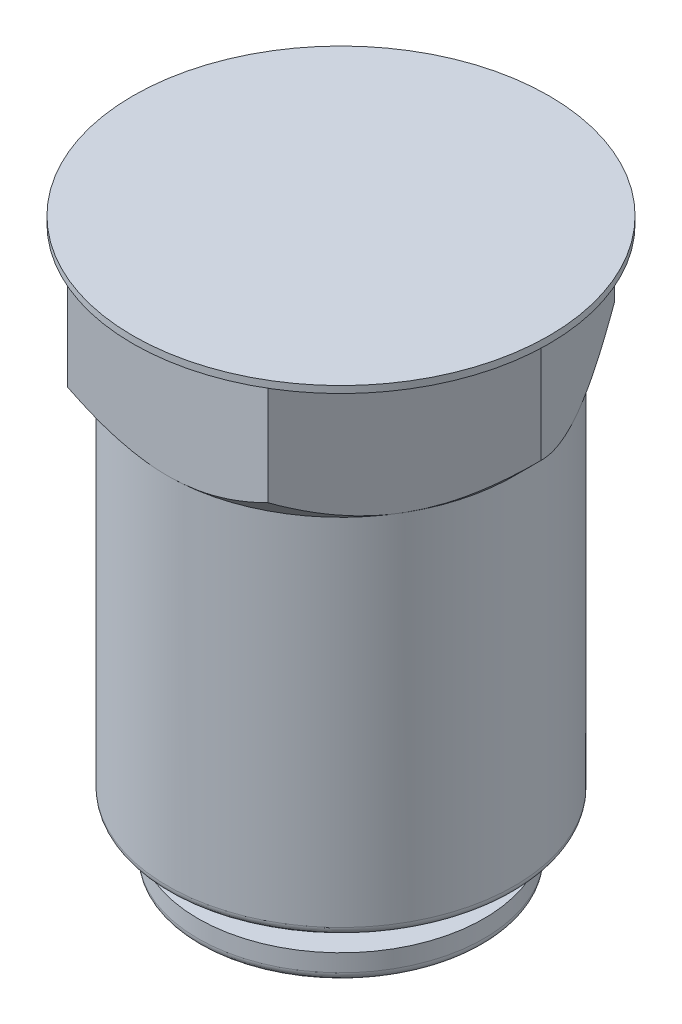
ISO-10303-21;
HEADER;
FILE_DESCRIPTION(('STEP AP214'),'2;1');
FILE_NAME('part.step','',(''),(''),'','','');
FILE_SCHEMA(('AUTOMOTIVE_DESIGN { 1 0 10303 214 1 1 1 1 }'));
ENDSEC;
DATA;
#1=APPLICATION_CONTEXT('core data for automotive mechanical design processes');
#2=APPLICATION_PROTOCOL_DEFINITION('international standard','automotive_design',2000,#1);
#3=PRODUCT_CONTEXT('',#1,'mechanical');
#4=PRODUCT('Part','Part','',(#3));
#5=PRODUCT_RELATED_PRODUCT_CATEGORY('part','',(#4));
#6=PRODUCT_DEFINITION_FORMATION('','',#4);
#7=PRODUCT_DEFINITION_CONTEXT('part definition',#1,'design');
#8=PRODUCT_DEFINITION('design','',#6,#7);
#9=PRODUCT_DEFINITION_SHAPE('','',#8);
#10=(LENGTH_UNIT() NAMED_UNIT(*) SI_UNIT(.MILLI.,.METRE.));
#11=(NAMED_UNIT(*) PLANE_ANGLE_UNIT() SI_UNIT($,.RADIAN.));
#12=(NAMED_UNIT(*) SI_UNIT($,.STERADIAN.) SOLID_ANGLE_UNIT());
#13=UNCERTAINTY_MEASURE_WITH_UNIT(LENGTH_MEASURE(1.E-05),#10,'distance_accuracy_value','');
#14=(GEOMETRIC_REPRESENTATION_CONTEXT(3) GLOBAL_UNCERTAINTY_ASSIGNED_CONTEXT((#13)) GLOBAL_UNIT_ASSIGNED_CONTEXT((#10,
#11,#12)) REPRESENTATION_CONTEXT('',''));
#15=CARTESIAN_POINT('',(0.,0.,0.));
#16=DIRECTION('',(0.,0.,1.));
#17=DIRECTION('',(1.,0.,0.));
#18=AXIS2_PLACEMENT_3D('',#15,#16,#17);
#19=CARTESIAN_POINT('',(-8.25,-32.5,0.));
#20=DIRECTION('',(0.,-1.,0.));
#21=DIRECTION('',(0.,0.,-1.));
#22=AXIS2_PLACEMENT_3D('',#19,#20,#21);
#23=PLANE('',#22);
#24=CARTESIAN_POINT('',(1.73579021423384,-32.5,5.68050835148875));
#25=CARTESIAN_POINT('',(1.71575720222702,-32.5,5.68108819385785));
#26=CARTESIAN_POINT('',(1.67660587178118,-32.5,5.68222140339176));
#27=CARTESIAN_POINT('',(1.61978810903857,-32.5,5.69119391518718));
#28=CARTESIAN_POINT('',(1.56667035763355,-32.5,5.7057082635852));
#29=CARTESIAN_POINT('',(1.51729402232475,-32.5,5.72632610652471));
#30=CARTESIAN_POINT('',(1.47168530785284,-32.5,5.75291204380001));
#31=CARTESIAN_POINT('',(1.42990914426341,-32.5,5.78560247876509));
#32=CARTESIAN_POINT('',(1.39181124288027,-32.5,5.82404619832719));
#33=CARTESIAN_POINT('',(1.35775939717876,-32.5,5.86846365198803));
#34=CARTESIAN_POINT('',(1.32746417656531,-32.5,5.91851487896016));
#35=CARTESIAN_POINT('',(1.3014002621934,-32.5,5.97408976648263));
#36=CARTESIAN_POINT('',(1.27944274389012,-32.5,6.03519962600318));
#37=CARTESIAN_POINT('',(1.26179239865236,-32.5,6.10169657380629));
#38=CARTESIAN_POINT('',(1.24735351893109,-32.5,6.17346834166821));
#39=CARTESIAN_POINT('',(1.237511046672,-32.5,6.25071273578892));
#40=CARTESIAN_POINT('',(1.23182341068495,-32.5,6.33339211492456));
#41=CARTESIAN_POINT('',(1.23097006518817,-32.5,6.39032002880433));
#42=CARTESIAN_POINT('',(1.23053013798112,-32.5,6.41966820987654));
#43=B_SPLINE_CURVE_WITH_KNOTS('',3,(#24,#25,#26,#27,#28,#29,#30,#31,#32,#33,#34,#35,#36,#37,#38,
#39,#40,#41,#42),.UNSPECIFIED.,.F.,.F.,(4,1,1,1,1,1,1,1,1,1,1,1,1,1,1,1,4),(0.,
0.0592749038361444,0.115843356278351,0.169793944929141,0.221919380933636,0.273767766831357,
0.325583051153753,0.378492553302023,0.433549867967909,0.490858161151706,0.551347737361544,
0.614941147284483,0.682807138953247,0.754823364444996,0.831494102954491,0.913129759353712,1.),.UNSPECIFIED.);
#44=CARTESIAN_POINT('',(1.73579021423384,-32.5,5.68050835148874));
#45=VERTEX_POINT('',#44);
#46=CARTESIAN_POINT('',(1.23053013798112,-32.5,6.41966820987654));
#47=VERTEX_POINT('',#46);
#48=EDGE_CURVE('E316',#45,#47,#43,.T.);
#49=ORIENTED_EDGE('',*,*,#48,.T.);
#50=CARTESIAN_POINT('',(1.23053013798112,-32.5,6.41966820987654));
#51=CARTESIAN_POINT('',(1.23097044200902,-32.5,6.44911778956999));
#52=CARTESIAN_POINT('',(1.23182460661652,-32.5,6.50624828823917));
#53=CARTESIAN_POINT('',(1.23750873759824,-32.5,6.5892327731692));
#54=CARTESIAN_POINT('',(1.247365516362,-32.5,6.6667766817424));
#55=CARTESIAN_POINT('',(1.26173812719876,-32.5,6.73876996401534));
#56=CARTESIAN_POINT('',(1.27951563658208,-32.5,6.80542976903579));
#57=CARTESIAN_POINT('',(1.30131526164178,-32.5,6.86670149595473));
#58=CARTESIAN_POINT('',(1.32755230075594,-32.5,6.92239482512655));
#59=CARTESIAN_POINT('',(1.35774242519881,-32.5,6.97270062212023));
#60=CARTESIAN_POINT('',(1.39182479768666,-32.5,7.01738864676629));
#61=CARTESIAN_POINT('',(1.4297988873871,-32.5,7.05618544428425));
#62=CARTESIAN_POINT('',(1.47177616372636,-32.5,7.08882201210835));
#63=CARTESIAN_POINT('',(1.51726994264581,-32.5,7.1157406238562));
#64=CARTESIAN_POINT('',(1.56660562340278,-32.5,7.13673620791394));
#65=CARTESIAN_POINT('',(1.61979567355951,-32.5,7.15116733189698));
#66=CARTESIAN_POINT('',(1.67660383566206,-32.5,7.1601661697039));
#67=CARTESIAN_POINT('',(1.71575651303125,-32.5,7.16129568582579));
#68=CARTESIAN_POINT('',(1.73579021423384,-32.5,7.16187363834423));
#69=B_SPLINE_CURVE_WITH_KNOTS('',3,(#50,#51,#52,#53,#54,#55,#56,#57,#58,#59,#60,#61,#62,#63,#64,
#65,#66,#67,#68),.UNSPECIFIED.,.F.,.F.,(4,1,1,1,1,1,1,1,1,1,1,1,1,1,1,1,4),(0.,
0.0869573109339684,0.168692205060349,0.24547255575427,0.317606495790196,0.38530639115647,
0.449026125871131,0.509367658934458,0.566792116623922,0.621952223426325,0.674945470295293,
0.726633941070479,0.778507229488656,0.830621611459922,0.884440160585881,0.940870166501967,1.),.UNSPECIFIED.);
#70=CARTESIAN_POINT('',(1.73579021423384,-32.5,7.16187363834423));
#71=VERTEX_POINT('',#70);
#72=EDGE_CURVE('E379',#47,#71,#69,.T.);
#73=ORIENTED_EDGE('',*,*,#72,.T.);
#74=CARTESIAN_POINT('',(1.73579021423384,-32.5,7.16187363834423));
#75=CARTESIAN_POINT('',(1.75592590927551,-32.5,7.16130154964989));
#76=CARTESIAN_POINT('',(1.79518111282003,-32.5,7.16018624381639));
#77=CARTESIAN_POINT('',(1.85218459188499,-32.5,7.15113836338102));
#78=CARTESIAN_POINT('',(1.90565430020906,-32.5,7.13667863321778));
#79=CARTESIAN_POINT('',(1.95530781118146,-32.5,7.11585085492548));
#80=CARTESIAN_POINT('',(2.00114421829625,-32.5,7.08907803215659));
#81=CARTESIAN_POINT('',(2.04328391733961,-32.5,7.05648799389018));
#82=CARTESIAN_POINT('',(2.08150448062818,-32.5,7.01782922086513));
#83=CARTESIAN_POINT('',(2.11569590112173,-32.5,6.97317936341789));
#84=CARTESIAN_POINT('',(2.14624804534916,-32.5,6.92310880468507));
#85=CARTESIAN_POINT('',(2.17224952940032,-32.5,6.86717505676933));
#86=CARTESIAN_POINT('',(2.19489238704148,-32.5,6.80612977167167));
#87=CARTESIAN_POINT('',(2.21301671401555,-32.5,6.73945006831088));
#88=CARTESIAN_POINT('',(2.22688420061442,-32.5,6.66724587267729));
#89=CARTESIAN_POINT('',(2.23672575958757,-32.5,6.58962838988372));
#90=CARTESIAN_POINT('',(2.24291455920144,-32.5,6.50646540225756));
#91=CARTESIAN_POINT('',(2.24369364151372,-32.5,6.44922162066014));
#92=CARTESIAN_POINT('',(2.24409586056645,-32.5,6.41966820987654));
#93=B_SPLINE_CURVE_WITH_KNOTS('',3,(#74,#75,#76,#77,#78,#79,#80,#81,#82,#83,#84,#85,#86,#87,#88,
#89,#90,#91,#92),.UNSPECIFIED.,.F.,.F.,(4,1,1,1,1,1,1,1,1,1,1,1,1,1,1,1,4),(0.,
0.0592988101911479,0.115604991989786,0.169593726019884,0.22214483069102,0.2737528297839,
0.325564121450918,0.378651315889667,0.433453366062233,0.490906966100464,0.551116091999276,
0.614901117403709,0.682531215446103,0.754449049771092,0.83135754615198,0.912934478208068,1.),.UNSPECIFIED.);
#94=CARTESIAN_POINT('',(2.24409586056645,-32.5,6.41966820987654));
#95=VERTEX_POINT('',#94);
#96=EDGE_CURVE('E36',#71,#95,#93,.T.);
#97=ORIENTED_EDGE('',*,*,#96,.T.);
#98=CARTESIAN_POINT('',(2.24409586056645,-32.5,6.41966820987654));
#99=CARTESIAN_POINT('',(2.24364082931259,-32.5,6.39032238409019));
#100=CARTESIAN_POINT('',(2.24275818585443,-32.5,6.33339903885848));
#101=CARTESIAN_POINT('',(2.23727510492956,-32.5,6.25067431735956));
#102=CARTESIAN_POINT('',(2.22672134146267,-32.5,6.17354723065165));
#103=CARTESIAN_POINT('',(2.2130673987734,-32.5,6.1015940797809));
#104=CARTESIAN_POINT('',(2.19473295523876,-32.5,6.03526986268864));
#105=CARTESIAN_POINT('',(2.17303195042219,-32.5,5.97399646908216));
#106=CARTESIAN_POINT('',(2.14648473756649,-32.5,5.91859202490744));
#107=CARTESIAN_POINT('',(2.11626854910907,-32.5,5.86846420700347));
#108=CARTESIAN_POINT('',(2.08220012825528,-32.5,5.82395197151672));
#109=CARTESIAN_POINT('',(2.04379100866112,-32.5,5.78558784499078));
#110=CARTESIAN_POINT('',(2.00175543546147,-32.5,5.75301171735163));
#111=CARTESIAN_POINT('',(1.95598677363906,-32.5,5.72615478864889));
#112=CARTESIAN_POINT('',(1.90618591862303,-32.5,5.70579157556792));
#113=CARTESIAN_POINT('',(1.85270964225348,-32.5,5.69117815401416));
#114=CARTESIAN_POINT('',(1.79547952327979,-32.5,5.68221008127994));
#115=CARTESIAN_POINT('',(1.75602571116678,-32.5,5.68108526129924));
#116=CARTESIAN_POINT('',(1.73579021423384,-32.5,5.68050835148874));
#117=B_SPLINE_CURVE_WITH_KNOTS('',3,(#98,#99,#100,#101,#102,#103,#104,#105,#106,#107,#108,#109,
#110,#111,#112,#113,#114,#115,#116),.UNSPECIFIED.,.F.,.F.,(4,1,1,1,1,1,1,1,1,1,1,1,1,1,1,1,4),
(0.,0.0866639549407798,0.168105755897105,0.244633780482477,0.316420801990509,0.384204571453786,
0.447646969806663,0.50812159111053,0.565293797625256,0.620220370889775,0.673215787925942,
0.725144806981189,0.776870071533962,0.829425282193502,0.883536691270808,0.940267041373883,1.),.UNSPECIFIED.);
#118=EDGE_CURVE('E31',#95,#45,#117,.T.);
#119=ORIENTED_EDGE('',*,*,#118,.T.);
#120=EDGE_LOOP('',(#49,#73,#97,#119));
#121=FACE_BOUND('',#120,.T.);
#122=DIRECTION('',(-1.,0.,0.));
#123=VECTOR('',#122,1.);
#124=CARTESIAN_POINT('',(0.723747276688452,-32.5,5.7));
#125=LINE('',#124,#123);
#126=CARTESIAN_POINT('',(0.723747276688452,-32.5,5.7));
#127=VERTEX_POINT('',#126);
#128=CARTESIAN_POINT('',(0.548322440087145,-32.5,5.7));
#129=VERTEX_POINT('',#128);
#130=EDGE_CURVE('E404',#127,#129,#125,.T.);
#131=ORIENTED_EDGE('',*,*,#130,.T.);
#132=DIRECTION('',(0.,0.,1.));
#133=VECTOR('',#132,1.);
#134=CARTESIAN_POINT('',(0.548322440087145,-32.5,5.7));
#135=LINE('',#134,#133);
#136=CARTESIAN_POINT('',(0.548322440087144,-32.5,6.73305737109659));
#137=VERTEX_POINT('',#136);
#138=EDGE_CURVE('E1534',#129,#137,#135,.T.);
#139=ORIENTED_EDGE('',*,*,#138,.T.);
#140=DIRECTION('',(-1.,0.,0.));
#141=VECTOR('',#140,1.);
#142=CARTESIAN_POINT('',(0.548322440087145,-32.5,6.73305737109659));
#143=LINE('',#142,#141);
#144=CARTESIAN_POINT('',(0.216964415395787,-32.5,6.73305737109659));
#145=VERTEX_POINT('',#144);
#146=EDGE_CURVE('E1536',#137,#145,#143,.T.);
#147=ORIENTED_EDGE('',*,*,#146,.T.);
#148=DIRECTION('',(0.,0.,1.));
#149=VECTOR('',#148,1.);
#150=CARTESIAN_POINT('',(0.216964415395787,-32.5,6.73305737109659));
#151=LINE('',#150,#149);
#152=CARTESIAN_POINT('',(0.216964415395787,-32.5,6.88899055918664));
#153=VERTEX_POINT('',#152);
#154=EDGE_CURVE('E1538',#145,#153,#151,.T.);
#155=ORIENTED_EDGE('',*,*,#154,.T.);
#156=CARTESIAN_POINT('',(0.216964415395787,-32.5,6.88899055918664));
#157=CARTESIAN_POINT('',(0.231388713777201,-32.5,6.88932697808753));
#158=CARTESIAN_POINT('',(0.259369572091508,-32.5,6.88997957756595));
#159=CARTESIAN_POINT('',(0.299929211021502,-32.5,6.89373970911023));
#160=CARTESIAN_POINT('',(0.337850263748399,-32.5,6.89920059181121));
#161=CARTESIAN_POINT('',(0.373049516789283,-32.5,6.90623505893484));
#162=CARTESIAN_POINT('',(0.405428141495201,-32.5,6.91579241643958));
#163=CARTESIAN_POINT('',(0.434985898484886,-32.5,6.92730685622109));
#164=CARTESIAN_POINT('',(0.461909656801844,-32.5,6.94073631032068));
#165=CARTESIAN_POINT('',(0.4863827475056,-32.5,6.95589606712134));
#166=CARTESIAN_POINT('',(0.507775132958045,-32.5,6.97392532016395));
#167=CARTESIAN_POINT('',(0.527247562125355,-32.5,6.99370942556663));
#168=CARTESIAN_POINT('',(0.543921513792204,-32.5,7.01621521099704));
#169=CARTESIAN_POINT('',(0.558745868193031,-32.5,7.04068608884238));
#170=CARTESIAN_POINT('',(0.57090849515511,-32.5,7.06770452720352));
#171=CARTESIAN_POINT('',(0.580578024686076,-32.5,7.09701545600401));
#172=CARTESIAN_POINT('',(0.587930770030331,-32.5,7.12863409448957));
#173=CARTESIAN_POINT('',(0.590935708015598,-32.5,7.15057460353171));
#174=CARTESIAN_POINT('',(0.59248320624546,-32.5,7.16187363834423));
#175=B_SPLINE_CURVE_WITH_KNOTS('',3,(#156,#157,#158,#159,#160,#161,#162,#163,#164,#165,#166,
#167,#168,#169,#170,#171,#172,#173,#174),.UNSPECIFIED.,.F.,.F.,(4,1,1,1,1,1,1,1,1,1,1,1,1,1,1,1,
4),(0.,0.0832405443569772,0.161473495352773,0.234878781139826,0.304275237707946,
0.368413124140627,0.429444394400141,0.487083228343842,0.541855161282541,0.595111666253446,
0.648142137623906,0.701687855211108,0.756343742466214,0.812973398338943,0.872256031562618,
0.934213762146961,1.),.UNSPECIFIED.);
#176=CARTESIAN_POINT('',(0.59248320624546,-32.5,7.16187363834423));
#177=VERTEX_POINT('',#176);
#178=EDGE_CURVE('E1540',#153,#177,#175,.T.);
#179=ORIENTED_EDGE('',*,*,#178,.T.);
#180=DIRECTION('',(1.,0.,0.));
#181=VECTOR('',#180,1.);
#182=CARTESIAN_POINT('',(0.59248320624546,-32.5,7.16187363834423));
#183=LINE('',#182,#181);
#184=CARTESIAN_POINT('',(0.723747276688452,-32.5,7.16187363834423));
#185=VERTEX_POINT('',#184);
#186=EDGE_CURVE('E1544',#177,#185,#183,.T.);
#187=ORIENTED_EDGE('',*,*,#186,.T.);
#188=DIRECTION('',(0.,0.,-1.));
#189=VECTOR('',#188,1.);
#190=CARTESIAN_POINT('',(0.723747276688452,-32.5,7.16187363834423));
#191=LINE('',#190,#189);
#192=EDGE_CURVE('E416',#185,#127,#191,.T.);
#193=ORIENTED_EDGE('',*,*,#192,.T.);
#194=EDGE_LOOP('',(#131,#139,#147,#155,#179,#187,#193));
#195=FACE_BOUND('',#194,.T.);
#196=DIRECTION('',(0.638587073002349,0.,0.76954957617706));
#197=VECTOR('',#196,1.);
#198=CARTESIAN_POINT('',(-2.11289669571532,-32.5,5.72923747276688));
#199=LINE('',#198,#197);
#200=CARTESIAN_POINT('',(-2.11289669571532,-32.5,5.72923747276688));
#201=VERTEX_POINT('',#200);
#202=CARTESIAN_POINT('',(-1.94508578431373,-32.5,5.93146332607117));
#203=VERTEX_POINT('',#202);
#204=EDGE_CURVE('E593',#201,#203,#199,.T.);
#205=ORIENTED_EDGE('',*,*,#204,.T.);
#206=CARTESIAN_POINT('',(-1.94508578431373,-32.5,5.93146332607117));
#207=CARTESIAN_POINT('',(-1.95775327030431,-32.5,5.94836313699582));
#208=CARTESIAN_POINT('',(-1.98333205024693,-32.5,5.982488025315));
#209=CARTESIAN_POINT('',(-2.01502016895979,-32.5,6.03903114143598));
#210=CARTESIAN_POINT('',(-2.04229262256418,-32.5,6.0996453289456));
#211=CARTESIAN_POINT('',(-2.06458345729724,-32.5,6.16478303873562));
#212=CARTESIAN_POINT('',(-2.08132564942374,-32.5,6.23448556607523));
#213=CARTESIAN_POINT('',(-2.09395726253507,-32.5,6.30852770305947));
#214=CARTESIAN_POINT('',(-2.1012006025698,-32.5,6.38723997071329));
#215=CARTESIAN_POINT('',(-2.10208693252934,-32.5,6.44127703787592));
#216=CARTESIAN_POINT('',(-2.10254175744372,-32.5,6.46900644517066));
#217=B_SPLINE_CURVE_WITH_KNOTS('',3,(#206,#207,#208,#209,#210,#211,#212,#213,#214,#215,#216),
.UNSPECIFIED.,.F.,.F.,(4,1,1,1,1,1,1,1,4),(0.,0.110889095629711,0.223912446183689,
0.339726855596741,0.459851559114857,0.585105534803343,0.716053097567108,0.854291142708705,1.),.UNSPECIFIED.);
#218=CARTESIAN_POINT('',(-2.10254175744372,-32.5,6.46900644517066));
#219=VERTEX_POINT('',#218);
#220=EDGE_CURVE('E595',#203,#219,#217,.T.);
#221=ORIENTED_EDGE('',*,*,#220,.T.);
#222=CARTESIAN_POINT('',(-2.10254175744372,-32.5,6.46900644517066));
#223=CARTESIAN_POINT('',(-2.10196309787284,-32.5,6.49917964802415));
#224=CARTESIAN_POINT('',(-2.10083629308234,-32.5,6.55793493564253));
#225=CARTESIAN_POINT('',(-2.09191667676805,-32.5,6.64358609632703));
#226=CARTESIAN_POINT('',(-2.07717940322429,-32.5,6.72420620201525));
#227=CARTESIAN_POINT('',(-2.05623417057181,-32.5,6.7998106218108));
#228=CARTESIAN_POINT('',(-2.02905365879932,-32.5,6.87017840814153));
#229=CARTESIAN_POINT('',(-1.99606683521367,-32.5,6.93559554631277));
#230=CARTESIAN_POINT('',(-1.95692467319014,-32.5,6.9958204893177));
#231=CARTESIAN_POINT('',(-1.91210241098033,-32.5,7.0508742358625));
#232=CARTESIAN_POINT('',(-1.86175745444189,-32.5,7.0999346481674));
#233=CARTESIAN_POINT('',(-1.80669257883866,-32.5,7.14288901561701));
#234=CARTESIAN_POINT('',(-1.74681898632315,-32.5,7.17915008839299));
#235=CARTESIAN_POINT('',(-1.682184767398,-32.5,7.20827949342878));
#236=CARTESIAN_POINT('',(-1.61310518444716,-32.5,7.231285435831));
#237=CARTESIAN_POINT('',(-1.53953203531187,-32.5,7.24757006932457));
#238=CARTESIAN_POINT('',(-1.46131279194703,-32.5,7.25746856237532));
#239=CARTESIAN_POINT('',(-1.40767405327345,-32.5,7.25869972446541));
#240=CARTESIAN_POINT('',(-1.38013253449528,-32.5,7.25933188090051));
#241=B_SPLINE_CURVE_WITH_KNOTS('',3,(#222,#223,#224,#225,#226,#227,#228,#229,#230,#231,#232,
#233,#234,#235,#236,#237,#238,#239,#240),.UNSPECIFIED.,.F.,.F.,(4,1,1,1,1,1,1,1,1,1,1,1,1,1,1,1,
4),(0.,0.0745329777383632,0.145135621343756,0.212480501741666,0.276802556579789,
0.338657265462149,0.398554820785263,0.457478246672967,0.515766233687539,0.573586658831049,
0.630780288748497,0.687945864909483,0.746086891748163,0.805571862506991,0.867516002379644,
0.931974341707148,1.),.UNSPECIFIED.);
#242=CARTESIAN_POINT('',(-1.38013253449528,-32.5,7.25933188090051));
#243=VERTEX_POINT('',#242);
#244=EDGE_CURVE('E600',#219,#243,#241,.T.);
#245=ORIENTED_EDGE('',*,*,#244,.T.);
#246=CARTESIAN_POINT('',(-1.38013253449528,-32.5,7.25933188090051));
#247=CARTESIAN_POINT('',(-1.35584707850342,-32.5,7.25880593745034));
#248=CARTESIAN_POINT('',(-1.3082602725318,-32.5,7.2577753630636));
#249=CARTESIAN_POINT('',(-1.23868978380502,-32.5,7.24969555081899));
#250=CARTESIAN_POINT('',(-1.17241432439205,-32.5,7.23670928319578));
#251=CARTESIAN_POINT('',(-1.10936412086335,-32.5,7.21812088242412));
#252=CARTESIAN_POINT('',(-1.04941128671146,-32.5,7.19382096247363));
#253=CARTESIAN_POINT('',(-0.99197099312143,-32.5,7.16458660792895));
#254=CARTESIAN_POINT('',(-0.937610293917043,-32.5,7.1291417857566));
#255=CARTESIAN_POINT('',(-0.903974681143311,-32.5,7.10168037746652));
#256=CARTESIAN_POINT('',(-0.887054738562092,-32.5,7.08786628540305));
#257=B_SPLINE_CURVE_WITH_KNOTS('',3,(#246,#247,#248,#249,#250,#251,#252,#253,#254,#255,#256),
.UNSPECIFIED.,.F.,.F.,(4,1,1,1,1,1,1,1,4),(0.,0.136452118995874,0.267374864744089,
0.393026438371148,0.515599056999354,0.636163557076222,0.756089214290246,0.877303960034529,1.),.UNSPECIFIED.);
#258=CARTESIAN_POINT('',(-0.887054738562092,-32.5,7.08786628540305));
#259=VERTEX_POINT('',#258);
#260=EDGE_CURVE('E607',#243,#259,#257,.T.);
#261=ORIENTED_EDGE('',*,*,#260,.T.);
#262=DIRECTION('',(0.67423826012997,0.,0.738513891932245));
#263=VECTOR('',#262,1.);
#264=CARTESIAN_POINT('',(-0.887054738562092,-32.5,7.08786628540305));
#265=LINE('',#264,#263);
#266=CARTESIAN_POINT('',(-0.730512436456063,-32.5,7.25933188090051));
#267=VERTEX_POINT('',#266);
#268=EDGE_CURVE('E614',#259,#267,#265,.T.);
#269=ORIENTED_EDGE('',*,*,#268,.T.);
#270=DIRECTION('',(0.741033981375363,0.,-0.67146752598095));
#271=VECTOR('',#270,1.);
#272=CARTESIAN_POINT('',(-0.730512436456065,-32.5,7.25933188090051));
#273=LINE('',#272,#271);
#274=CARTESIAN_POINT('',(-0.655895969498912,-32.5,7.19172022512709));
#275=VERTEX_POINT('',#274);
#276=EDGE_CURVE('E619',#267,#275,#273,.T.);
#277=ORIENTED_EDGE('',*,*,#276,.T.);
#278=DIRECTION('',(-0.672105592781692,0.,-0.740455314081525));
#279=VECTOR('',#278,1.);
#280=CARTESIAN_POINT('',(-0.655895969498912,-32.5,7.19172022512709));
#281=LINE('',#280,#279);
#282=CARTESIAN_POINT('',(-0.81761574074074,-32.5,7.01355437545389));
#283=VERTEX_POINT('',#282);
#284=EDGE_CURVE('E621',#275,#283,#281,.T.);
#285=ORIENTED_EDGE('',*,*,#284,.T.);
#286=CARTESIAN_POINT('',(-0.817615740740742,-32.5,7.01355437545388));
#287=CARTESIAN_POINT('',(-0.804982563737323,-32.5,6.99653304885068));
#288=CARTESIAN_POINT('',(-0.77944067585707,-32.5,6.96211915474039));
#289=CARTESIAN_POINT('',(-0.747173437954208,-32.5,6.90547145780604));
#290=CARTESIAN_POINT('',(-0.720456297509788,-32.5,6.84396436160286));
#291=CARTESIAN_POINT('',(-0.698150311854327,-32.5,6.77819156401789));
#292=CARTESIAN_POINT('',(-0.681300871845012,-32.5,6.70759497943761));
#293=CARTESIAN_POINT('',(-0.668807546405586,-32.5,6.63272042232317));
#294=CARTESIAN_POINT('',(-0.661489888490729,-32.5,6.5532100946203));
#295=CARTESIAN_POINT('',(-0.66061079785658,-32.5,6.49876674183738));
#296=CARTESIAN_POINT('',(-0.660159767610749,-32.5,6.47083378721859));
#297=B_SPLINE_CURVE_WITH_KNOTS('',3,(#286,#287,#288,#289,#290,#291,#292,#293,#294,#295,#296),
.UNSPECIFIED.,.F.,.F.,(4,1,1,1,1,1,1,1,4),(0.,0.110362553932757,0.223132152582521,
0.338698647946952,0.459288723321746,0.584489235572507,0.716393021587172,0.85449131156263,1.),.UNSPECIFIED.);
#298=CARTESIAN_POINT('',(-0.660159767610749,-32.5,6.47083378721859));
#299=VERTEX_POINT('',#298);
#300=EDGE_CURVE('E623',#283,#299,#297,.T.);
#301=ORIENTED_EDGE('',*,*,#300,.T.);
#302=CARTESIAN_POINT('',(-0.660159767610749,-32.5,6.47083378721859));
#303=CARTESIAN_POINT('',(-0.66074024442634,-32.5,6.44066108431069));
#304=CARTESIAN_POINT('',(-0.661870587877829,-32.5,6.38190677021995));
#305=CARTESIAN_POINT('',(-0.670765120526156,-32.5,6.29624870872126));
#306=CARTESIAN_POINT('',(-0.685568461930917,-32.5,6.21577605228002));
#307=CARTESIAN_POINT('',(-0.706180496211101,-32.5,6.14011225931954));
#308=CARTESIAN_POINT('',(-0.7333383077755,-32.5,6.06981287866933));
#309=CARTESIAN_POINT('',(-0.76602258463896,-32.5,6.00426660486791));
#310=CARTESIAN_POINT('',(-0.804829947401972,-32.5,5.94392631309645));
#311=CARTESIAN_POINT('',(-0.849696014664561,-32.5,5.88907166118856));
#312=CARTESIAN_POINT('',(-0.899709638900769,-32.5,5.83991542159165));
#313=CARTESIAN_POINT('',(-0.954517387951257,-32.5,5.79684804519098));
#314=CARTESIAN_POINT('',(-1.0142443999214,-32.5,5.7608763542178));
#315=CARTESIAN_POINT('',(-1.0785139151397,-32.5,5.73139652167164));
#316=CARTESIAN_POINT('',(-1.14729731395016,-32.5,5.70868395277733));
#317=CARTESIAN_POINT('',(-1.22060940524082,-32.5,5.69218159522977));
#318=CARTESIAN_POINT('',(-1.29855117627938,-32.5,5.68240202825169));
#319=CARTESIAN_POINT('',(-1.35208508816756,-32.5,5.68115004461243));
#320=CARTESIAN_POINT('',(-1.3795234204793,-32.5,5.68050835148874));
#321=B_SPLINE_CURVE_WITH_KNOTS('',3,(#302,#303,#304,#305,#306,#307,#308,#309,#310,#311,#312,
#313,#314,#315,#316,#317,#318,#319,#320),.UNSPECIFIED.,.F.,.F.,(4,1,1,1,1,1,1,1,1,1,1,1,1,1,1,1,
4),(0.,0.0746746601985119,0.145411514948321,0.212884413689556,0.27701934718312,
0.339226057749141,0.399124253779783,0.458023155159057,0.516421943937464,0.574172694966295,
0.631276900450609,0.688551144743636,0.746345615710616,0.805943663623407,0.867515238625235,
0.932096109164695,1.),.UNSPECIFIED.);
#322=CARTESIAN_POINT('',(-1.3795234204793,-32.5,5.68050835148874));
#323=VERTEX_POINT('',#322);
#324=EDGE_CURVE('E627',#299,#323,#321,.T.);
#325=ORIENTED_EDGE('',*,*,#324,.T.);
#326=CARTESIAN_POINT('',(-1.3795234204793,-32.5,5.68050835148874));
#327=CARTESIAN_POINT('',(-1.40452131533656,-32.5,5.68100577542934));
#328=CARTESIAN_POINT('',(-1.45343945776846,-32.5,5.68197917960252));
#329=CARTESIAN_POINT('',(-1.52473309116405,-32.5,5.6904150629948));
#330=CARTESIAN_POINT('',(-1.5922291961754,-32.5,5.70368540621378));
#331=CARTESIAN_POINT('',(-1.6559806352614,-32.5,5.72247896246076));
#332=CARTESIAN_POINT('',(-1.71612907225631,-32.5,5.74752190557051));
#333=CARTESIAN_POINT('',(-1.77335108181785,-32.5,5.77769274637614));
#334=CARTESIAN_POINT('',(-1.82764777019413,-32.5,5.81374383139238));
#335=CARTESIAN_POINT('',(-1.86097976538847,-32.5,5.84179549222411));
#336=CARTESIAN_POINT('',(-1.87777868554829,-32.5,5.85593318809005));
#337=B_SPLINE_CURVE_WITH_KNOTS('',3,(#326,#327,#328,#329,#330,#331,#332,#333,#334,#335,#336),
.UNSPECIFIED.,.F.,.F.,(4,1,1,1,1,1,1,1,4),(0.,0.138632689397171,0.271288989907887,
0.397640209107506,0.519872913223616,0.639308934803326,0.758469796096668,0.878271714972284,1.),.UNSPECIFIED.);
#338=CARTESIAN_POINT('',(-1.87777868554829,-32.5,5.85593318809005));
#339=VERTEX_POINT('',#338);
#340=EDGE_CURVE('E634',#323,#339,#337,.T.);
#341=ORIENTED_EDGE('',*,*,#340,.T.);
#342=DIRECTION('',(-0.670103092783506,0.,-0.742268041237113));
#343=VECTOR('',#342,1.);
#344=CARTESIAN_POINT('',(-1.87777868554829,-32.5,5.85593318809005));
#345=LINE('',#344,#343);
#346=CARTESIAN_POINT('',(-2.03614832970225,-32.5,5.68050835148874));
#347=VERTEX_POINT('',#346);
#348=EDGE_CURVE('E641',#339,#347,#345,.T.);
#349=ORIENTED_EDGE('',*,*,#348,.T.);
#350=DIRECTION('',(-0.844212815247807,0.,0.536008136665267));
#351=VECTOR('',#350,1.);
#352=CARTESIAN_POINT('',(-2.03614832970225,-32.5,5.68050835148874));
#353=LINE('',#352,#351);
#354=EDGE_CURVE('E646',#347,#201,#353,.T.);
#355=ORIENTED_EDGE('',*,*,#354,.T.);
#356=EDGE_LOOP('',(#205,#221,#245,#261,#269,#277,#285,#301,#325,#341,#349,#355));
#357=FACE_BOUND('',#356,.T.);
#358=CARTESIAN_POINT('',(0.,-32.5,0.));
#359=DIRECTION('',(0.,-1.,0.));
#360=DIRECTION('',(0.,0.,-1.));
#361=AXIS2_PLACEMENT_3D('',#358,#359,#360);
#362=CIRCLE('',#361,7.75);
#363=CARTESIAN_POINT('',(0.,-32.5,-7.75));
#364=VERTEX_POINT('',#363);
#365=EDGE_CURVE('E925',#364,#364,#362,.T.);
#366=ORIENTED_EDGE('',*,*,#365,.T.);
#367=EDGE_LOOP('',(#366));
#368=FACE_BOUND('',#367,.T.);
#369=CARTESIAN_POINT('',(0.,-32.5,0.));
#370=DIRECTION('',(0.,-1.,0.));
#371=DIRECTION('',(0.,0.,-1.));
#372=AXIS2_PLACEMENT_3D('',#369,#370,#371);
#373=CIRCLE('',#372,5.5);
#374=CARTESIAN_POINT('',(0.,-32.5,-5.5));
#375=VERTEX_POINT('',#374);
#376=EDGE_CURVE('E929',#375,#375,#373,.F.);
#377=ORIENTED_EDGE('',*,*,#376,.T.);
#378=EDGE_LOOP('',(#377));
#379=FACE_BOUND('',#378,.T.);
#380=ADVANCED_FACE('F16',(#121,#195,#357,#368,#379),#23,.T.);
#381=CARTESIAN_POINT('',(0.,0.,0.));
#382=DIRECTION('',(0.,1.,0.));
#383=DIRECTION('',(0.,0.,1.));
#384=AXIS2_PLACEMENT_3D('',#381,#382,#383);
#385=CYLINDRICAL_SURFACE('',#384,10.);
#386=CARTESIAN_POINT('',(0.,-28.5,0.));
#387=DIRECTION('',(0.,-1.,0.));
#388=DIRECTION('',(0.,0.,-1.));
#389=AXIS2_PLACEMENT_3D('',#386,#387,#388);
#390=CIRCLE('',#389,10.);
#391=CARTESIAN_POINT('',(0.,-28.5,-10.));
#392=VERTEX_POINT('',#391);
#393=EDGE_CURVE('E24',#392,#392,#390,.F.);
#394=ORIENTED_EDGE('',*,*,#393,.T.);
#395=EDGE_LOOP('',(#394));
#396=FACE_BOUND('',#395,.T.);
#397=CARTESIAN_POINT('',(0.,-8.,0.));
#398=DIRECTION('',(0.,1.,0.));
#399=DIRECTION('',(0.,0.,1.));
#400=AXIS2_PLACEMENT_3D('',#397,#398,#399);
#401=CIRCLE('',#400,10.);
#402=CARTESIAN_POINT('',(0.,-8.,10.));
#403=VERTEX_POINT('',#402);
#404=CARTESIAN_POINT('',(8.66025403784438,-8.,5.));
#405=VERTEX_POINT('',#404);
#406=EDGE_CURVE('E975',#403,#405,#401,.T.);
#407=ORIENTED_EDGE('',*,*,#406,.F.);
#408=CARTESIAN_POINT('',(-8.66025403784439,-8.,5.));
#409=VERTEX_POINT('',#408);
#410=EDGE_CURVE('E945',#409,#403,#401,.T.);
#411=ORIENTED_EDGE('',*,*,#410,.F.);
#412=CARTESIAN_POINT('',(-8.66025403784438,-8.,-5.));
#413=VERTEX_POINT('',#412);
#414=EDGE_CURVE('E1013',#413,#409,#401,.T.);
#415=ORIENTED_EDGE('',*,*,#414,.F.);
#416=CARTESIAN_POINT('',(0.,-8.,-10.));
#417=VERTEX_POINT('',#416);
#418=EDGE_CURVE('E1010',#417,#413,#401,.T.);
#419=ORIENTED_EDGE('',*,*,#418,.F.);
#420=CARTESIAN_POINT('',(8.66025403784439,-8.,-5.));
#421=VERTEX_POINT('',#420);
#422=EDGE_CURVE('E1007',#421,#417,#401,.T.);
#423=ORIENTED_EDGE('',*,*,#422,.F.);
#424=EDGE_CURVE('E937',#405,#421,#401,.T.);
#425=ORIENTED_EDGE('',*,*,#424,.F.);
#426=EDGE_LOOP('',(#407,#411,#415,#419,#423,#425));
#427=FACE_BOUND('',#426,.T.);
#428=ADVANCED_FACE('F715',(#396,#427),#385,.T.);
#429=CARTESIAN_POINT('',(-10.,-29.,0.));
#430=DIRECTION('',(0.,-1.,0.));
#431=DIRECTION('',(0.,0.,-1.));
#432=AXIS2_PLACEMENT_3D('',#429,#430,#431);
#433=PLANE('',#432);
#434=CARTESIAN_POINT('',(0.,-29.,0.));
#435=DIRECTION('',(0.,-1.,0.));
#436=DIRECTION('',(0.,0.,-1.));
#437=AXIS2_PLACEMENT_3D('',#434,#435,#436);
#438=CIRCLE('',#437,9.5);
#439=CARTESIAN_POINT('',(0.,-29.,-9.5));
#440=VERTEX_POINT('',#439);
#441=EDGE_CURVE('E10',#440,#440,#438,.T.);
#442=ORIENTED_EDGE('',*,*,#441,.T.);
#443=EDGE_LOOP('',(#442));
#444=FACE_BOUND('',#443,.T.);
#445=CARTESIAN_POINT('',(0.,-29.,0.));
#446=DIRECTION('',(0.,1.,0.));
#447=DIRECTION('',(0.,0.,1.));
#448=AXIS2_PLACEMENT_3D('',#445,#446,#447);
#449=CIRCLE('',#448,5.75);
#450=CARTESIAN_POINT('',(0.,-29.,5.75));
#451=VERTEX_POINT('',#450);
#452=EDGE_CURVE('E978',#451,#451,#449,.T.);
#453=ORIENTED_EDGE('',*,*,#452,.T.);
#454=EDGE_LOOP('',(#453));
#455=FACE_BOUND('',#454,.T.);
#456=ADVANCED_FACE('F801',(#444,#455),#433,.T.);
#457=CARTESIAN_POINT('',(0.,0.,0.));
#458=DIRECTION('',(0.,1.,0.));
#459=DIRECTION('',(0.,0.,1.));
#460=AXIS2_PLACEMENT_3D('',#457,#458,#459);
#461=CYLINDRICAL_SURFACE('',#460,5.75);
#462=CARTESIAN_POINT('',(0.,-31.,0.));
#463=DIRECTION('',(0.,1.,0.));
#464=DIRECTION('',(0.,0.,1.));
#465=AXIS2_PLACEMENT_3D('',#462,#463,#464);
#466=CIRCLE('',#465,5.75);
#467=CARTESIAN_POINT('',(0.,-31.,5.75));
#468=VERTEX_POINT('',#467);
#469=EDGE_CURVE('E981',#468,#468,#466,.T.);
#470=ORIENTED_EDGE('',*,*,#469,.T.);
#471=EDGE_LOOP('',(#470));
#472=FACE_BOUND('',#471,.T.);
#473=ORIENTED_EDGE('',*,*,#452,.F.);
#474=EDGE_LOOP('',(#473));
#475=FACE_BOUND('',#474,.T.);
#476=ADVANCED_FACE('F1087',(#472,#475),#461,.T.);
#477=CARTESIAN_POINT('',(-5.75,-31.,0.));
#478=DIRECTION('',(0.,1.,0.));
#479=DIRECTION('',(0.,0.,1.));
#480=AXIS2_PLACEMENT_3D('',#477,#478,#479);
#481=PLANE('',#480);
#482=CARTESIAN_POINT('',(0.,-31.,0.));
#483=DIRECTION('',(0.,1.,0.));
#484=DIRECTION('',(0.,0.,1.));
#485=AXIS2_PLACEMENT_3D('',#482,#483,#484);
#486=CIRCLE('',#485,8.25);
#487=CARTESIAN_POINT('',(0.,-31.,8.25));
#488=VERTEX_POINT('',#487);
#489=EDGE_CURVE('E983',#488,#488,#486,.T.);
#490=ORIENTED_EDGE('',*,*,#489,.T.);
#491=EDGE_LOOP('',(#490));
#492=FACE_BOUND('',#491,.T.);
#493=ORIENTED_EDGE('',*,*,#469,.F.);
#494=EDGE_LOOP('',(#493));
#495=FACE_BOUND('',#494,.T.);
#496=ADVANCED_FACE('F1078',(#492,#495),#481,.T.);
#497=CARTESIAN_POINT('',(0.,0.,0.));
#498=DIRECTION('',(0.,1.,0.));
#499=DIRECTION('',(0.,0.,1.));
#500=AXIS2_PLACEMENT_3D('',#497,#498,#499);
#501=CYLINDRICAL_SURFACE('',#500,8.25);
#502=CARTESIAN_POINT('',(0.,-32.,0.));
#503=DIRECTION('',(0.,-1.,0.));
#504=DIRECTION('',(0.,0.,-1.));
#505=AXIS2_PLACEMENT_3D('',#502,#503,#504);
#506=CIRCLE('',#505,8.25);
#507=CARTESIAN_POINT('',(0.,-32.,-8.25));
#508=VERTEX_POINT('',#507);
#509=EDGE_CURVE('E934',#508,#508,#506,.F.);
#510=ORIENTED_EDGE('',*,*,#509,.T.);
#511=EDGE_LOOP('',(#510));
#512=FACE_BOUND('',#511,.T.);
#513=ORIENTED_EDGE('',*,*,#489,.F.);
#514=EDGE_LOOP('',(#513));
#515=FACE_BOUND('',#514,.T.);
#516=ADVANCED_FACE('F1039',(#512,#515),#501,.T.);
#517=CARTESIAN_POINT('',(0.,-8.,0.));
#518=DIRECTION('',(0.,1.,0.));
#519=DIRECTION('',(0.,0.,1.));
#520=AXIS2_PLACEMENT_3D('',#517,#518,#519);
#521=CONICAL_SURFACE('',#520,10.,0.785398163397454);
#522=ORIENTED_EDGE('',*,*,#406,.T.);
#523=CARTESIAN_POINT('',(5.77338722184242,-6.45287914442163,10.0002));
#524=CARTESIAN_POINT('',(5.87264697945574,-6.55212474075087,9.82827705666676));
#525=CARTESIAN_POINT('',(5.97268410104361,-6.64834190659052,9.65500767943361));
#526=CARTESIAN_POINT('',(6.1744340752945,-6.83375739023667,9.30556647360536));
#527=CARTESIAN_POINT('',(6.27614780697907,-6.92295187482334,9.12939312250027));
#528=CARTESIAN_POINT('',(6.48185175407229,-7.09373775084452,8.77310343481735));
#529=CARTESIAN_POINT('',(6.58585166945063,-7.17528268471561,8.5929702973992));
#530=CARTESIAN_POINT('',(6.79555966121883,-7.32899837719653,8.22974540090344));
#531=CARTESIAN_POINT('',(6.90126747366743,-7.4011705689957,8.0466540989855));
#532=CARTESIAN_POINT('',(7.11269164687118,-7.53385723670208,7.68045668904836));
#533=CARTESIAN_POINT('',(7.21838202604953,-7.59453635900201,7.49739558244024));
#534=CARTESIAN_POINT('',(7.43124437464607,-7.7043903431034,7.1287071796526));
#535=CARTESIAN_POINT('',(7.53841618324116,-7.75356644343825,6.94308016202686));
#536=CARTESIAN_POINT('',(7.75378298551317,-7.83917632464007,6.5700539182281));
#537=CARTESIAN_POINT('',(7.86197510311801,-7.87563878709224,6.38265967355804));
#538=CARTESIAN_POINT('',(8.07926764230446,-7.93502017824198,6.00629795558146));
#539=CARTESIAN_POINT('',(8.18836792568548,-7.95794113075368,5.81733072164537));
#540=CARTESIAN_POINT('',(8.45423602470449,-7.99637309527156,5.35683366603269));
#541=CARTESIAN_POINT('',(8.61129120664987,-8.0044380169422,5.08480611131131));
#542=CARTESIAN_POINT('',(8.92511752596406,-7.99090121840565,4.54124298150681));
#543=CARTESIAN_POINT('',(9.08188854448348,-7.96928909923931,4.26970761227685));
#544=CARTESIAN_POINT('',(9.3939527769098,-7.89767388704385,3.72919650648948));
#545=CARTESIAN_POINT('',(9.5492441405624,-7.84763904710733,3.46022397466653));
#546=CARTESIAN_POINT('',(9.8571577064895,-7.72189812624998,2.92690203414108));
#547=CARTESIAN_POINT('',(10.0097801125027,-7.64619401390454,2.66255227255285));
#548=CARTESIAN_POINT('',(10.2807050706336,-7.49045180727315,2.19329648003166));
#549=CARTESIAN_POINT('',(10.3996076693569,-7.4145105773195,1.98735113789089));
#550=CARTESIAN_POINT('',(10.6352785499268,-7.25039111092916,1.57915719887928));
#551=CARTESIAN_POINT('',(10.7520467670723,-7.16221250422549,1.37690871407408));
#552=CARTESIAN_POINT('',(10.9830810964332,-6.97559475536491,0.976745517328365));
#553=CARTESIAN_POINT('',(11.0973537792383,-6.87718788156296,0.778819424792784));
#554=CARTESIAN_POINT('',(11.3237832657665,-6.67140540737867,0.38663204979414));
#555=CARTESIAN_POINT('',(11.435941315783,-6.56403530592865,0.192368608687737));
#556=CARTESIAN_POINT('',(11.5471208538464,-6.45287914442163,-0.000199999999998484));
#557=B_SPLINE_CURVE_WITH_KNOTS('',3,(#523,#524,#525,#526,#527,#528,#529,#530,#531,#532,#533,
#534,#535,#536,#537,#538,#539,#540,#541,#542,#543,#544,#545,#546,#547,#548,#549,#550,#551,#552,
#553,#554,#555,#556),.UNSPECIFIED.,.F.,.F.,(4,2,2,2,2,2,2,2,2,2,2,2,2,2,2,2,4),(0.,
0.665863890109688,1.3320887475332,2.00212824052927,2.67206515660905,3.33152613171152,
3.99091606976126,4.64880867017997,5.30660292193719,6.24777541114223,7.18927777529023,
8.13183382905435,9.07431761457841,9.82287578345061,10.5714566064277,11.3177436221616,
12.0635761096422),.UNSPECIFIED.);
#558=CARTESIAN_POINT('',(5.77350269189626,-6.4529946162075,10.));
#559=VERTEX_POINT('',#558);
#560=EDGE_CURVE('E752',#559,#405,#557,.T.);
#561=ORIENTED_EDGE('',*,*,#560,.F.);
#562=CARTESIAN_POINT('',(-12.0488243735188,-2.34196152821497,10.));
#563=CARTESIAN_POINT('',(-11.7577304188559,-2.56590735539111,10.));
#564=CARTESIAN_POINT('',(-11.465067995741,-2.78784646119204,10.));
#565=CARTESIAN_POINT('',(-10.8759651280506,-3.22679443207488,10.));
#566=CARTESIAN_POINT('',(-10.5795238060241,-3.44380211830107,10.));
#567=CARTESIAN_POINT('',(-9.98005574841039,-3.87351477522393,10.));
#568=CARTESIAN_POINT('',(-9.67699585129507,-4.0861736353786,10.));
#569=CARTESIAN_POINT('',(-9.06583225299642,-4.50409077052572,10.));
#570=CARTESIAN_POINT('',(-8.75772890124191,-4.70934955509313,10.));
#571=CARTESIAN_POINT('',(-8.11590639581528,-5.12350814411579,10.));
#572=CARTESIAN_POINT('',(-7.78180175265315,-5.33181355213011,10.));
#573=CARTESIAN_POINT('',(-7.10574653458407,-5.73549517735,10.));
#574=CARTESIAN_POINT('',(-6.7637946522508,-5.93086921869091,10.));
#575=CARTESIAN_POINT('',(-6.07195141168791,-6.3045273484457,10.));
#576=CARTESIAN_POINT('',(-5.72208736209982,-6.48286160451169,10.));
#577=CARTESIAN_POINT('',(-5.01246894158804,-6.8184446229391,10.));
#578=CARTESIAN_POINT('',(-4.65271933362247,-6.97570333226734,10.));
#579=CARTESIAN_POINT('',(-3.95857234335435,-7.24923684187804,10.));
#580=CARTESIAN_POINT('',(-3.62517528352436,-7.36802435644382,10.));
#581=CARTESIAN_POINT('',(-2.94988720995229,-7.57891299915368,10.));
#582=CARTESIAN_POINT('',(-2.6079956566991,-7.67101242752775,10.));
#583=CARTESIAN_POINT('',(-1.92371505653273,-7.82200448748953,10.));
#584=CARTESIAN_POINT('',(-1.58146136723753,-7.88150023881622,10.));
#585=CARTESIAN_POINT('',(-0.892701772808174,-7.96604375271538,10.));
#586=CARTESIAN_POINT('',(-0.546196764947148,-7.99109866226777,10.));
#587=CARTESIAN_POINT('',(0.132376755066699,-8.00462626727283,10.));
#588=CARTESIAN_POINT('',(0.464414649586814,-7.99464927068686,10.));
#589=CARTESIAN_POINT('',(1.12589936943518,-7.94222289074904,10.));
#590=CARTESIAN_POINT('',(1.45534595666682,-7.89977055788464,10.));
#591=CARTESIAN_POINT('',(2.11484708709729,-7.78407231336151,10.));
#592=CARTESIAN_POINT('',(2.44480462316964,-7.71028273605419,10.));
#593=CARTESIAN_POINT('',(3.09745344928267,-7.53600375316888,10.));
#594=CARTESIAN_POINT('',(3.4201451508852,-7.43551586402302,10.));
#595=CARTESIAN_POINT('',(4.07603966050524,-7.20582122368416,10.));
#596=CARTESIAN_POINT('',(4.40877383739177,-7.07529144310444,10.));
#597=CARTESIAN_POINT('',(5.06568365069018,-6.79406589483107,10.));
#598=CARTESIAN_POINT('',(5.38985534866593,-6.6433610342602,10.));
#599=CARTESIAN_POINT('',(6.0311711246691,-6.32535925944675,10.));
#600=CARTESIAN_POINT('',(6.34828965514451,-6.1580112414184,10.));
#601=CARTESIAN_POINT('',(6.97526009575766,-5.81040583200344,10.));
#602=CARTESIAN_POINT('',(7.28511311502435,-5.6301504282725,10.));
#603=CARTESIAN_POINT('',(7.88335840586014,-5.26840777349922,10.));
#604=CARTESIAN_POINT('',(8.17205485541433,-5.08742091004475,10.));
#605=CARTESIAN_POINT('',(8.74448773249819,-4.71774347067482,10.));
#606=CARTESIAN_POINT('',(9.02822378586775,-4.52905231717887,10.));
#607=CARTESIAN_POINT('',(9.58910362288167,-4.14687627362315,10.));
#608=CARTESIAN_POINT('',(9.86628204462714,-3.95344203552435,10.));
#609=CARTESIAN_POINT('',(10.4168363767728,-3.56138826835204,10.));
#610=CARTESIAN_POINT('',(10.6902133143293,-3.36277018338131,10.));
#611=CARTESIAN_POINT('',(10.9619955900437,-3.16203021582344,10.));
#612=B_SPLINE_CURVE_WITH_KNOTS('',3,(#562,#563,#564,#565,#566,#567,#568,#569,#570,#571,#572,
#573,#574,#575,#576,#577,#578,#579,#580,#581,#582,#583,#584,#585,#586,#587,#588,#589,#590,#591,
#592,#593,#594,#595,#596,#597,#598,#599,#600,#601,#602,#603,#604,#605,#606,#607,#608,#609,#610,
#611),.UNSPECIFIED.,.F.,.F.,(4,2,2,2,2,2,2,2,2,2,2,2,2,2,2,2,2,2,2,2,2,2,2,2,4),(0.,
1.10183091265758,2.20392250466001,3.31451652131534,4.42503391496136,5.60596739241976,
6.78709907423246,7.96463864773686,9.14162048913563,10.2024853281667,11.263417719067,
12.3039980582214,13.3443624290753,14.3392776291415,15.3342832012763,16.3473055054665,
17.3602702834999,18.431712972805,19.5036401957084,20.5789668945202,21.6541283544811,
22.6761968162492,23.6983420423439,24.7122805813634,25.7259396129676),.UNSPECIFIED.);
#613=EDGE_CURVE('E753',#403,#559,#612,.T.);
#614=ORIENTED_EDGE('',*,*,#613,.F.);
#615=EDGE_LOOP('',(#522,#561,#614));
#616=FACE_BOUND('',#615,.T.);
#617=ADVANCED_FACE('F998',(#616),#521,.T.);
#618=ORIENTED_EDGE('',*,*,#424,.T.);
#619=CARTESIAN_POINT('',(11.5471208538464,-6.45287914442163,0.000200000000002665));
#620=CARTESIAN_POINT('',(11.447861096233,-6.55212474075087,-0.171722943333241));
#621=CARTESIAN_POINT('',(11.3478239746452,-6.64834190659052,-0.344992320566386));
#622=CARTESIAN_POINT('',(11.1460740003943,-6.83375739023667,-0.69443352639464));
#623=CARTESIAN_POINT('',(11.0443602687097,-6.92295187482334,-0.870606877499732));
#624=CARTESIAN_POINT('',(10.8386563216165,-7.09373775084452,-1.22689656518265));
#625=CARTESIAN_POINT('',(10.7346564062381,-7.1752826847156,-1.4070297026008));
#626=CARTESIAN_POINT('',(10.5249484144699,-7.32899837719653,-1.77025459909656));
#627=CARTESIAN_POINT('',(10.4192406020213,-7.40117056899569,-1.9533459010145));
#628=CARTESIAN_POINT('',(10.2078164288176,-7.53385723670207,-2.31954331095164));
#629=CARTESIAN_POINT('',(10.1021260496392,-7.59453635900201,-2.50260441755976));
#630=CARTESIAN_POINT('',(9.8892637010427,-7.7043903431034,-2.8712928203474));
#631=CARTESIAN_POINT('',(9.78209189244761,-7.75356644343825,-3.05691983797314));
#632=CARTESIAN_POINT('',(9.56672509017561,-7.83917632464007,-3.4299460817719));
#633=CARTESIAN_POINT('',(9.45853297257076,-7.87563878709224,-3.61734032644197));
#634=CARTESIAN_POINT('',(9.24124043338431,-7.93502017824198,-3.99370204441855));
#635=CARTESIAN_POINT('',(9.13214015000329,-7.95794113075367,-4.18266927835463));
#636=CARTESIAN_POINT('',(8.86627205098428,-7.99637309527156,-4.64316633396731));
#637=CARTESIAN_POINT('',(8.7092168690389,-8.00443801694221,-4.91519388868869));
#638=CARTESIAN_POINT('',(8.39539054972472,-7.99090121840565,-5.45875701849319));
#639=CARTESIAN_POINT('',(8.23861953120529,-7.96928909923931,-5.73029238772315));
#640=CARTESIAN_POINT('',(7.92655529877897,-7.89767388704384,-6.27080349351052));
#641=CARTESIAN_POINT('',(7.77126393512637,-7.84763904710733,-6.53977602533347));
#642=CARTESIAN_POINT('',(7.46335036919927,-7.72189812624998,-7.07309796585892));
#643=CARTESIAN_POINT('',(7.3107279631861,-7.64619401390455,-7.33744772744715));
#644=CARTESIAN_POINT('',(7.0398030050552,-7.49045180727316,-7.80670351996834));
#645=CARTESIAN_POINT('',(6.92090040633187,-7.41451057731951,-8.01264886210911));
#646=CARTESIAN_POINT('',(6.68522952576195,-7.25039111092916,-8.42084280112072));
#647=CARTESIAN_POINT('',(6.56846130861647,-7.16221250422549,-8.62309128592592));
#648=CARTESIAN_POINT('',(6.33742697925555,-6.97559475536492,-9.02325448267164));
#649=CARTESIAN_POINT('',(6.22315429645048,-6.87718788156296,-9.22118057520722));
#650=CARTESIAN_POINT('',(5.99672480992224,-6.67140540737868,-9.61336795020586));
#651=CARTESIAN_POINT('',(5.88456675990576,-6.56403530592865,-9.80763139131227));
#652=CARTESIAN_POINT('',(5.77338722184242,-6.45287914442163,-10.0002));
#653=B_SPLINE_CURVE_WITH_KNOTS('',3,(#619,#620,#621,#622,#623,#624,#625,#626,#627,#628,#629,
#630,#631,#632,#633,#634,#635,#636,#637,#638,#639,#640,#641,#642,#643,#644,#645,#646,#647,#648,
#649,#650,#651,#652),.UNSPECIFIED.,.F.,.F.,(4,2,2,2,2,2,2,2,2,2,2,2,2,2,2,2,4),(0.,
0.665863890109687,1.33208874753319,2.00212824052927,2.67206515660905,3.33152613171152,
3.99091606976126,4.64880867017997,5.30660292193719,6.24777541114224,7.18927777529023,
8.13183382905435,9.07431761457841,9.82287578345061,10.5714566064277,11.3177436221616,
12.0635761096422),.UNSPECIFIED.);
#654=CARTESIAN_POINT('',(11.5470053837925,-6.4529946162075,0.));
#655=VERTEX_POINT('',#654);
#656=EDGE_CURVE('E1025',#655,#421,#653,.T.);
#657=ORIENTED_EDGE('',*,*,#656,.F.);
#658=EDGE_CURVE('E737',#405,#655,#557,.T.);
#659=ORIENTED_EDGE('',*,*,#658,.F.);
#660=EDGE_LOOP('',(#618,#657,#659));
#661=FACE_BOUND('',#660,.T.);
#662=ADVANCED_FACE('F1031',(#661),#521,.T.);
#663=ORIENTED_EDGE('',*,*,#422,.T.);
#664=CARTESIAN_POINT('',(-12.0488243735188,-2.34196152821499,-9.99999999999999));
#665=CARTESIAN_POINT('',(-11.7577304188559,-2.56590735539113,-10.));
#666=CARTESIAN_POINT('',(-11.465067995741,-2.78784646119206,-10.));
#667=CARTESIAN_POINT('',(-10.8759651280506,-3.2267944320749,-10.));
#668=CARTESIAN_POINT('',(-10.5795238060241,-3.44380211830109,-10.));
#669=CARTESIAN_POINT('',(-9.98005574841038,-3.87351477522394,-10.));
#670=CARTESIAN_POINT('',(-9.67699585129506,-4.08617363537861,-10.));
#671=CARTESIAN_POINT('',(-9.06583225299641,-4.50409077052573,-10.));
#672=CARTESIAN_POINT('',(-8.7577289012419,-4.70934955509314,-10.));
#673=CARTESIAN_POINT('',(-8.11590639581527,-5.1235081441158,-10.));
#674=CARTESIAN_POINT('',(-7.78180175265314,-5.33181355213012,-10.));
#675=CARTESIAN_POINT('',(-7.10574653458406,-5.73549517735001,-10.));
#676=CARTESIAN_POINT('',(-6.7637946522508,-5.93086921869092,-10.));
#677=CARTESIAN_POINT('',(-6.07195141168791,-6.30452734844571,-10.));
#678=CARTESIAN_POINT('',(-5.72208736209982,-6.4828616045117,-10.));
#679=CARTESIAN_POINT('',(-5.01246894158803,-6.8184446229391,-10.));
#680=CARTESIAN_POINT('',(-4.65271933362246,-6.97570333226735,-10.));
#681=CARTESIAN_POINT('',(-3.95857234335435,-7.24923684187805,-10.));
#682=CARTESIAN_POINT('',(-3.62517528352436,-7.36802435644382,-10.));
#683=CARTESIAN_POINT('',(-2.94988720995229,-7.57891299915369,-10.));
#684=CARTESIAN_POINT('',(-2.60799565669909,-7.67101242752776,-10.));
#685=CARTESIAN_POINT('',(-1.92371505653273,-7.82200448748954,-10.));
#686=CARTESIAN_POINT('',(-1.58146136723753,-7.88150023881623,-10.));
#687=CARTESIAN_POINT('',(-0.892701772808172,-7.96604375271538,-10.));
#688=CARTESIAN_POINT('',(-0.546196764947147,-7.99109866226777,-10.));
#689=CARTESIAN_POINT('',(0.1323767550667,-8.00462626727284,-10.));
#690=CARTESIAN_POINT('',(0.464414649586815,-7.99464927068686,-10.));
#691=CARTESIAN_POINT('',(1.12589936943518,-7.94222289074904,-10.));
#692=CARTESIAN_POINT('',(1.45534595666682,-7.89977055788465,-10.));
#693=CARTESIAN_POINT('',(2.11484708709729,-7.78407231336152,-10.));
#694=CARTESIAN_POINT('',(2.44480462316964,-7.71028273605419,-10.));
#695=CARTESIAN_POINT('',(3.09745344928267,-7.53600375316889,-10.));
#696=CARTESIAN_POINT('',(3.42014515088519,-7.43551586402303,-10.));
#697=CARTESIAN_POINT('',(4.07603966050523,-7.20582122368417,-10.));
#698=CARTESIAN_POINT('',(4.40877383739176,-7.07529144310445,-10.));
#699=CARTESIAN_POINT('',(5.06568365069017,-6.79406589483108,-10.));
#700=CARTESIAN_POINT('',(5.38985534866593,-6.64336103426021,-10.));
#701=CARTESIAN_POINT('',(6.0311711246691,-6.32535925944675,-10.));
#702=CARTESIAN_POINT('',(6.3482896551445,-6.1580112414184,-10.));
#703=CARTESIAN_POINT('',(6.97526009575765,-5.81040583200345,-10.));
#704=CARTESIAN_POINT('',(7.28511311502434,-5.63015042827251,-10.));
#705=CARTESIAN_POINT('',(7.88335840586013,-5.26840777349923,-10.));
#706=CARTESIAN_POINT('',(8.17205485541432,-5.08742091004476,-10.));
#707=CARTESIAN_POINT('',(8.74448773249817,-4.71774347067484,-10.));
#708=CARTESIAN_POINT('',(9.02822378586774,-4.52905231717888,-10.));
#709=CARTESIAN_POINT('',(9.58910362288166,-4.14687627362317,-10.));
#710=CARTESIAN_POINT('',(9.86628204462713,-3.95344203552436,-10.));
#711=CARTESIAN_POINT('',(10.4168363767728,-3.56138826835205,-10.));
#712=CARTESIAN_POINT('',(10.6902133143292,-3.36277018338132,-10.));
#713=CARTESIAN_POINT('',(10.9619955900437,-3.16203021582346,-10.));
#714=B_SPLINE_CURVE_WITH_KNOTS('',3,(#664,#665,#666,#667,#668,#669,#670,#671,#672,#673,#674,
#675,#676,#677,#678,#679,#680,#681,#682,#683,#684,#685,#686,#687,#688,#689,#690,#691,#692,#693,
#694,#695,#696,#697,#698,#699,#700,#701,#702,#703,#704,#705,#706,#707,#708,#709,#710,#711,#712,
#713),.UNSPECIFIED.,.F.,.F.,(4,2,2,2,2,2,2,2,2,2,2,2,2,2,2,2,2,2,2,2,2,2,2,2,4),(0.,
1.10183091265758,2.20392250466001,3.31451652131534,4.42503391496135,5.60596739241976,
6.78709907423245,7.96463864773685,9.14162048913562,10.2024853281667,11.263417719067,
12.3039980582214,13.3443624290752,14.3392776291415,15.3342832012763,16.3473055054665,
17.3602702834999,18.431712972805,19.5036401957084,20.5789668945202,21.6541283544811,
22.6761968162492,23.6983420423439,24.7122805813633,25.7259396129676),.UNSPECIFIED.);
#715=CARTESIAN_POINT('',(5.77350269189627,-6.4529946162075,-10.));
#716=VERTEX_POINT('',#715);
#717=EDGE_CURVE('E696',#716,#417,#714,.F.);
#718=ORIENTED_EDGE('',*,*,#717,.F.);
#719=EDGE_CURVE('E740',#421,#716,#653,.T.);
#720=ORIENTED_EDGE('',*,*,#719,.F.);
#721=EDGE_LOOP('',(#663,#718,#720));
#722=FACE_BOUND('',#721,.T.);
#723=ADVANCED_FACE('F1029',(#722),#521,.T.);
#724=CARTESIAN_POINT('',(-5.77350269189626,-6.4529946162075,-10.));
#725=VERTEX_POINT('',#724);
#726=EDGE_CURVE('E687',#417,#725,#714,.F.);
#727=ORIENTED_EDGE('',*,*,#726,.F.);
#728=ORIENTED_EDGE('',*,*,#418,.T.);
#729=CARTESIAN_POINT('',(-5.77338722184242,-6.45287914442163,-10.0002));
#730=CARTESIAN_POINT('',(-5.87264697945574,-6.55212474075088,-9.82827705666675));
#731=CARTESIAN_POINT('',(-5.97268410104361,-6.64834190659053,-9.65500767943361));
#732=CARTESIAN_POINT('',(-6.1744340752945,-6.83375739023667,-9.30556647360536));
#733=CARTESIAN_POINT('',(-6.27614780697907,-6.92295187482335,-9.12939312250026));
#734=CARTESIAN_POINT('',(-6.48185175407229,-7.09373775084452,-8.77310343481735));
#735=CARTESIAN_POINT('',(-6.58585166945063,-7.17528268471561,-8.59297029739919));
#736=CARTESIAN_POINT('',(-6.79555966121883,-7.32899837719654,-8.22974540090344));
#737=CARTESIAN_POINT('',(-6.90126747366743,-7.4011705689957,-8.0466540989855));
#738=CARTESIAN_POINT('',(-7.11269164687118,-7.53385723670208,-7.68045668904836));
#739=CARTESIAN_POINT('',(-7.21838202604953,-7.59453635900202,-7.49739558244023));
#740=CARTESIAN_POINT('',(-7.43124437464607,-7.70439034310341,-7.12870717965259));
#741=CARTESIAN_POINT('',(-7.53841618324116,-7.75356644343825,-6.94308016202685));
#742=CARTESIAN_POINT('',(-7.75378298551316,-7.83917632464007,-6.5700539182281));
#743=CARTESIAN_POINT('',(-7.86197510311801,-7.87563878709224,-6.38265967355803));
#744=CARTESIAN_POINT('',(-8.07926764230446,-7.93502017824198,-6.00629795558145));
#745=CARTESIAN_POINT('',(-8.18836792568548,-7.95794113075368,-5.81733072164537));
#746=CARTESIAN_POINT('',(-8.45423602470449,-7.99637309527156,-5.35683366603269));
#747=CARTESIAN_POINT('',(-8.61129120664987,-8.00443801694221,-5.08480611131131));
#748=CARTESIAN_POINT('',(-8.92511752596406,-7.99090121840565,-4.54124298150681));
#749=CARTESIAN_POINT('',(-9.08188854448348,-7.96928909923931,-4.26970761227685));
#750=CARTESIAN_POINT('',(-9.3939527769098,-7.89767388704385,-3.72919650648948));
#751=CARTESIAN_POINT('',(-9.5492441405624,-7.84763904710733,-3.46022397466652));
#752=CARTESIAN_POINT('',(-9.8571577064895,-7.72189812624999,-2.92690203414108));
#753=CARTESIAN_POINT('',(-10.0097801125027,-7.64619401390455,-2.66255227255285));
#754=CARTESIAN_POINT('',(-10.2807050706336,-7.49045180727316,-2.19329648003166));
#755=CARTESIAN_POINT('',(-10.3996076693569,-7.41451057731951,-1.98735113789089));
#756=CARTESIAN_POINT('',(-10.6352785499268,-7.25039111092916,-1.57915719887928));
#757=CARTESIAN_POINT('',(-10.7520467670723,-7.1622125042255,-1.37690871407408));
#758=CARTESIAN_POINT('',(-10.9830810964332,-6.97559475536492,-0.976745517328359));
#759=CARTESIAN_POINT('',(-11.0973537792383,-6.87718788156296,-0.778819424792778));
#760=CARTESIAN_POINT('',(-11.3237832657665,-6.67140540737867,-0.386632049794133));
#761=CARTESIAN_POINT('',(-11.435941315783,-6.56403530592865,-0.192368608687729));
#762=CARTESIAN_POINT('',(-11.5471208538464,-6.45287914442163,0.000200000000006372));
#763=B_SPLINE_CURVE_WITH_KNOTS('',3,(#729,#730,#731,#732,#733,#734,#735,#736,#737,#738,#739,
#740,#741,#742,#743,#744,#745,#746,#747,#748,#749,#750,#751,#752,#753,#754,#755,#756,#757,#758,
#759,#760,#761,#762),.UNSPECIFIED.,.F.,.F.,(4,2,2,2,2,2,2,2,2,2,2,2,2,2,2,2,4),(0.,
0.665863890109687,1.33208874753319,2.00212824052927,2.67206515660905,3.33152613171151,
3.99091606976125,4.64880867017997,5.30660292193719,6.24777541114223,7.18927777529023,
8.13183382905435,9.0743176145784,9.82287578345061,10.5714566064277,11.3177436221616,
12.0635761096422),.UNSPECIFIED.);
#764=EDGE_CURVE('E697',#725,#413,#763,.T.);
#765=ORIENTED_EDGE('',*,*,#764,.F.);
#766=EDGE_LOOP('',(#727,#728,#765));
#767=FACE_BOUND('',#766,.T.);
#768=ADVANCED_FACE('F1038',(#767),#521,.T.);
#769=CARTESIAN_POINT('',(-11.5470053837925,-6.4529946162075,0.));
#770=VERTEX_POINT('',#769);
#771=EDGE_CURVE('E738',#413,#770,#763,.T.);
#772=ORIENTED_EDGE('',*,*,#771,.F.);
#773=ORIENTED_EDGE('',*,*,#414,.T.);
#774=CARTESIAN_POINT('',(-11.5471208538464,-6.45287914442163,-0.00019999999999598));
#775=CARTESIAN_POINT('',(-11.447861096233,-6.55212474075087,0.171722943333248));
#776=CARTESIAN_POINT('',(-11.3478239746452,-6.64834190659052,0.344992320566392));
#777=CARTESIAN_POINT('',(-11.1460740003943,-6.83375739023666,0.694433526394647));
#778=CARTESIAN_POINT('',(-11.0443602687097,-6.92295187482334,0.870606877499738));
#779=CARTESIAN_POINT('',(-10.8386563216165,-7.09373775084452,1.22689656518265));
#780=CARTESIAN_POINT('',(-10.7346564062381,-7.1752826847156,1.40702970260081));
#781=CARTESIAN_POINT('',(-10.5249484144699,-7.32899837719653,1.77025459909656));
#782=CARTESIAN_POINT('',(-10.4192406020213,-7.40117056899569,1.9533459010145));
#783=CARTESIAN_POINT('',(-10.2078164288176,-7.53385723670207,2.31954331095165));
#784=CARTESIAN_POINT('',(-10.1021260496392,-7.59453635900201,2.50260441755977));
#785=CARTESIAN_POINT('',(-9.8892637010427,-7.7043903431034,2.87129282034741));
#786=CARTESIAN_POINT('',(-9.78209189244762,-7.75356644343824,3.05691983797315));
#787=CARTESIAN_POINT('',(-9.56672509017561,-7.83917632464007,3.42994608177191));
#788=CARTESIAN_POINT('',(-9.45853297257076,-7.87563878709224,3.61734032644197));
#789=CARTESIAN_POINT('',(-9.24124043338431,-7.93502017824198,3.99370204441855));
#790=CARTESIAN_POINT('',(-9.13214015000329,-7.95794113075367,4.18266927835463));
#791=CARTESIAN_POINT('',(-8.86627205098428,-7.99637309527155,4.64316633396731));
#792=CARTESIAN_POINT('',(-8.7092168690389,-8.0044380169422,4.91519388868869));
#793=CARTESIAN_POINT('',(-8.39539054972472,-7.99090121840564,5.45875701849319));
#794=CARTESIAN_POINT('',(-8.23861953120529,-7.9692890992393,5.73029238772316));
#795=CARTESIAN_POINT('',(-7.92655529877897,-7.89767388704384,6.27080349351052));
#796=CARTESIAN_POINT('',(-7.77126393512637,-7.84763904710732,6.53977602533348));
#797=CARTESIAN_POINT('',(-7.46335036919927,-7.72189812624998,7.07309796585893));
#798=CARTESIAN_POINT('',(-7.31072796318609,-7.64619401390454,7.33744772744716));
#799=CARTESIAN_POINT('',(-7.03980300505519,-7.49045180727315,7.80670351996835));
#800=CARTESIAN_POINT('',(-6.92090040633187,-7.4145105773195,8.01264886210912));
#801=CARTESIAN_POINT('',(-6.68522952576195,-7.25039111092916,8.42084280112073));
#802=CARTESIAN_POINT('',(-6.56846130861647,-7.16221250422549,8.62309128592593));
#803=CARTESIAN_POINT('',(-6.33742697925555,-6.97559475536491,9.02325448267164));
#804=CARTESIAN_POINT('',(-6.22315429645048,-6.87718788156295,9.22118057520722));
#805=CARTESIAN_POINT('',(-5.99672480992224,-6.67140540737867,9.61336795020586));
#806=CARTESIAN_POINT('',(-5.88456675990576,-6.56403530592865,9.80763139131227));
#807=CARTESIAN_POINT('',(-5.77338722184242,-6.45287914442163,10.0002));
#808=B_SPLINE_CURVE_WITH_KNOTS('',3,(#774,#775,#776,#777,#778,#779,#780,#781,#782,#783,#784,
#785,#786,#787,#788,#789,#790,#791,#792,#793,#794,#795,#796,#797,#798,#799,#800,#801,#802,#803,
#804,#805,#806,#807),.UNSPECIFIED.,.F.,.F.,(4,2,2,2,2,2,2,2,2,2,2,2,2,2,2,2,4),(0.,
0.665863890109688,1.33208874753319,2.00212824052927,2.67206515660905,3.33152613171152,
3.99091606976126,4.64880867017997,5.30660292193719,6.24777541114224,7.18927777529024,
8.13183382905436,9.07431761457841,9.82287578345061,10.5714566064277,11.3177436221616,
12.0635761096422),.UNSPECIFIED.);
#809=EDGE_CURVE('E730',#770,#409,#808,.T.);
#810=ORIENTED_EDGE('',*,*,#809,.F.);
#811=EDGE_LOOP('',(#772,#773,#810));
#812=FACE_BOUND('',#811,.T.);
#813=ADVANCED_FACE('F1022',(#812),#521,.T.);
#814=CARTESIAN_POINT('',(-5.77350269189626,-6.4529946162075,10.));
#815=VERTEX_POINT('',#814);
#816=EDGE_CURVE('E739',#409,#815,#808,.T.);
#817=ORIENTED_EDGE('',*,*,#816,.F.);
#818=ORIENTED_EDGE('',*,*,#410,.T.);
#819=EDGE_CURVE('E985',#815,#403,#612,.T.);
#820=ORIENTED_EDGE('',*,*,#819,.F.);
#821=EDGE_LOOP('',(#817,#818,#820));
#822=FACE_BOUND('',#821,.T.);
#823=ADVANCED_FACE('F704',(#822),#521,.T.);
#824=CARTESIAN_POINT('',(0.,0.,0.));
#825=DIRECTION('',(0.,1.,0.));
#826=DIRECTION('',(0.,0.,1.));
#827=AXIS2_PLACEMENT_3D('',#824,#825,#826);
#828=PLANE('',#827);
#829=CARTESIAN_POINT('',(0.,0.,0.));
#830=DIRECTION('',(0.,1.,0.));
#831=DIRECTION('',(0.,0.,1.));
#832=AXIS2_PLACEMENT_3D('',#829,#830,#831);
#833=CIRCLE('',#832,12.);
#834=CARTESIAN_POINT('',(0.,0.,12.));
#835=VERTEX_POINT('',#834);
#836=EDGE_CURVE('E938',#835,#835,#833,.T.);
#837=ORIENTED_EDGE('',*,*,#836,.T.);
#838=EDGE_LOOP('',(#837));
#839=FACE_BOUND('',#838,.T.);
#840=ADVANCED_FACE('F773',(#839),#828,.T.);
#841=CARTESIAN_POINT('',(0.,-0.4,0.));
#842=DIRECTION('',(0.,1.,0.));
#843=DIRECTION('',(0.,0.,1.));
#844=AXIS2_PLACEMENT_3D('',#841,#842,#843);
#845=CYLINDRICAL_SURFACE('',#844,12.);
#846=CARTESIAN_POINT('',(0.,-0.4,0.));
#847=DIRECTION('',(0.,1.,0.));
#848=DIRECTION('',(0.,0.,1.));
#849=AXIS2_PLACEMENT_3D('',#846,#847,#848);
#850=CIRCLE('',#849,12.);
#851=CARTESIAN_POINT('',(0.,-0.4,12.));
#852=VERTEX_POINT('',#851);
#853=EDGE_CURVE('E941',#852,#852,#850,.T.);
#854=ORIENTED_EDGE('',*,*,#853,.T.);
#855=EDGE_LOOP('',(#854));
#856=FACE_BOUND('',#855,.T.);
#857=ORIENTED_EDGE('',*,*,#836,.F.);
#858=EDGE_LOOP('',(#857));
#859=FACE_BOUND('',#858,.T.);
#860=ADVANCED_FACE('F771',(#856,#859),#845,.T.);
#861=CARTESIAN_POINT('',(0.,-0.4,0.));
#862=DIRECTION('',(0.,1.,0.));
#863=DIRECTION('',(0.,0.,1.));
#864=AXIS2_PLACEMENT_3D('',#861,#862,#863);
#865=PLANE('',#864);
#866=ORIENTED_EDGE('',*,*,#853,.F.);
#867=EDGE_LOOP('',(#866));
#868=FACE_BOUND('',#867,.T.);
#869=DIRECTION('',(0.5,0.,0.866025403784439));
#870=VECTOR('',#869,1.);
#871=CARTESIAN_POINT('',(5.77350269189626,-0.4,-10.));
#872=LINE('',#871,#870);
#873=CARTESIAN_POINT('',(5.77350269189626,-0.4,-10.));
#874=VERTEX_POINT('',#873);
#875=CARTESIAN_POINT('',(11.5470053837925,-0.4,0.));
#876=VERTEX_POINT('',#875);
#877=EDGE_CURVE('E972',#874,#876,#872,.T.);
#878=ORIENTED_EDGE('',*,*,#877,.F.);
#879=DIRECTION('',(1.,0.,0.));
#880=VECTOR('',#879,1.);
#881=CARTESIAN_POINT('',(-5.77350269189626,-0.4,-10.));
#882=LINE('',#881,#880);
#883=CARTESIAN_POINT('',(-5.77350269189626,-0.4,-10.));
#884=VERTEX_POINT('',#883);
#885=EDGE_CURVE('E957',#884,#874,#882,.T.);
#886=ORIENTED_EDGE('',*,*,#885,.F.);
#887=DIRECTION('',(0.5,0.,-0.866025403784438));
#888=VECTOR('',#887,1.);
#889=CARTESIAN_POINT('',(-11.5470053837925,-0.4,0.));
#890=LINE('',#889,#888);
#891=CARTESIAN_POINT('',(-11.5470053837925,-0.4,0.));
#892=VERTEX_POINT('',#891);
#893=EDGE_CURVE('E960',#892,#884,#890,.T.);
#894=ORIENTED_EDGE('',*,*,#893,.F.);
#895=DIRECTION('',(-0.5,0.,-0.866025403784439));
#896=VECTOR('',#895,1.);
#897=CARTESIAN_POINT('',(-5.77350269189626,-0.4,10.));
#898=LINE('',#897,#896);
#899=CARTESIAN_POINT('',(-5.77350269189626,-0.4,10.));
#900=VERTEX_POINT('',#899);
#901=EDGE_CURVE('E963',#900,#892,#898,.T.);
#902=ORIENTED_EDGE('',*,*,#901,.F.);
#903=DIRECTION('',(-1.,0.,0.));
#904=VECTOR('',#903,1.);
#905=CARTESIAN_POINT('',(5.77350269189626,-0.4,10.));
#906=LINE('',#905,#904);
#907=CARTESIAN_POINT('',(5.77350269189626,-0.4,10.));
#908=VERTEX_POINT('',#907);
#909=EDGE_CURVE('E966',#908,#900,#906,.T.);
#910=ORIENTED_EDGE('',*,*,#909,.F.);
#911=DIRECTION('',(-0.5,0.,0.866025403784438));
#912=VECTOR('',#911,1.);
#913=CARTESIAN_POINT('',(11.5470053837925,-0.4,0.));
#914=LINE('',#913,#912);
#915=EDGE_CURVE('E969',#876,#908,#914,.T.);
#916=ORIENTED_EDGE('',*,*,#915,.F.);
#917=EDGE_LOOP('',(#878,#886,#894,#902,#910,#916));
#918=FACE_BOUND('',#917,.T.);
#919=ADVANCED_FACE('F713',(#868,#918),#865,.F.);
#920=CARTESIAN_POINT('',(-5.77350269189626,-8.,-10.));
#921=DIRECTION('',(0.,0.,1.));
#922=DIRECTION('',(1.,0.,0.));
#923=AXIS2_PLACEMENT_3D('',#920,#921,#922);
#924=PLANE('',#923);
#925=DIRECTION('',(0.,1.,0.));
#926=VECTOR('',#925,1.);
#927=CARTESIAN_POINT('',(5.77350269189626,-8.,-10.));
#928=LINE('',#927,#926);
#929=EDGE_CURVE('E955',#716,#874,#928,.T.);
#930=ORIENTED_EDGE('',*,*,#929,.F.);
#931=ORIENTED_EDGE('',*,*,#717,.T.);
#932=ORIENTED_EDGE('',*,*,#726,.T.);
#933=DIRECTION('',(0.,1.,0.));
#934=VECTOR('',#933,1.);
#935=CARTESIAN_POINT('',(-5.77350269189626,-8.,-10.));
#936=LINE('',#935,#934);
#937=EDGE_CURVE('E953',#725,#884,#936,.T.);
#938=ORIENTED_EDGE('',*,*,#937,.T.);
#939=ORIENTED_EDGE('',*,*,#885,.T.);
#940=EDGE_LOOP('',(#930,#931,#932,#938,#939));
#941=FACE_BOUND('',#940,.T.);
#942=ADVANCED_FACE('F708',(#941),#924,.F.);
#943=CARTESIAN_POINT('',(-11.5470053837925,-8.,0.));
#944=DIRECTION('',(0.866025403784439,0.,0.5));
#945=DIRECTION('',(0.5,0.,-0.866025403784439));
#946=AXIS2_PLACEMENT_3D('',#943,#944,#945);
#947=PLANE('',#946);
#948=ORIENTED_EDGE('',*,*,#937,.F.);
#949=ORIENTED_EDGE('',*,*,#764,.T.);
#950=ORIENTED_EDGE('',*,*,#771,.T.);
#951=DIRECTION('',(0.,1.,0.));
#952=VECTOR('',#951,1.);
#953=CARTESIAN_POINT('',(-11.5470053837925,-8.,0.));
#954=LINE('',#953,#952);
#955=EDGE_CURVE('E951',#770,#892,#954,.T.);
#956=ORIENTED_EDGE('',*,*,#955,.T.);
#957=ORIENTED_EDGE('',*,*,#893,.T.);
#958=EDGE_LOOP('',(#948,#949,#950,#956,#957));
#959=FACE_BOUND('',#958,.T.);
#960=ADVANCED_FACE('F712',(#959),#947,.F.);
#961=CARTESIAN_POINT('',(-5.77350269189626,-8.,10.));
#962=DIRECTION('',(0.866025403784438,0.,-0.5));
#963=DIRECTION('',(-0.5,0.,-0.866025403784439));
#964=AXIS2_PLACEMENT_3D('',#961,#962,#963);
#965=PLANE('',#964);
#966=ORIENTED_EDGE('',*,*,#955,.F.);
#967=ORIENTED_EDGE('',*,*,#809,.T.);
#968=ORIENTED_EDGE('',*,*,#816,.T.);
#969=DIRECTION('',(0.,1.,0.));
#970=VECTOR('',#969,1.);
#971=CARTESIAN_POINT('',(-5.77350269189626,-8.,10.));
#972=LINE('',#971,#970);
#973=EDGE_CURVE('E949',#815,#900,#972,.T.);
#974=ORIENTED_EDGE('',*,*,#973,.T.);
#975=ORIENTED_EDGE('',*,*,#901,.T.);
#976=EDGE_LOOP('',(#966,#967,#968,#974,#975));
#977=FACE_BOUND('',#976,.T.);
#978=ADVANCED_FACE('F720',(#977),#965,.F.);
#979=CARTESIAN_POINT('',(5.77350269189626,-8.,10.));
#980=DIRECTION('',(0.,0.,-1.));
#981=DIRECTION('',(-1.,0.,0.));
#982=AXIS2_PLACEMENT_3D('',#979,#980,#981);
#983=PLANE('',#982);
#984=ORIENTED_EDGE('',*,*,#973,.F.);
#985=ORIENTED_EDGE('',*,*,#819,.T.);
#986=ORIENTED_EDGE('',*,*,#613,.T.);
#987=DIRECTION('',(0.,1.,0.));
#988=VECTOR('',#987,1.);
#989=CARTESIAN_POINT('',(5.77350269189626,-8.,10.));
#990=LINE('',#989,#988);
#991=EDGE_CURVE('E947',#559,#908,#990,.T.);
#992=ORIENTED_EDGE('',*,*,#991,.T.);
#993=ORIENTED_EDGE('',*,*,#909,.T.);
#994=EDGE_LOOP('',(#984,#985,#986,#992,#993));
#995=FACE_BOUND('',#994,.T.);
#996=ADVANCED_FACE('F725',(#995),#983,.F.);
#997=CARTESIAN_POINT('',(11.5470053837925,-8.,0.));
#998=DIRECTION('',(-0.866025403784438,0.,-0.5));
#999=DIRECTION('',(-0.5,0.,0.866025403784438));
#1000=AXIS2_PLACEMENT_3D('',#997,#998,#999);
#1001=PLANE('',#1000);
#1002=ORIENTED_EDGE('',*,*,#991,.F.);
#1003=ORIENTED_EDGE('',*,*,#560,.T.);
#1004=ORIENTED_EDGE('',*,*,#658,.T.);
#1005=DIRECTION('',(0.,1.,0.));
#1006=VECTOR('',#1005,1.);
#1007=CARTESIAN_POINT('',(11.5470053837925,-8.,0.));
#1008=LINE('',#1007,#1006);
#1009=EDGE_CURVE('E942',#655,#876,#1008,.T.);
#1010=ORIENTED_EDGE('',*,*,#1009,.T.);
#1011=ORIENTED_EDGE('',*,*,#915,.T.);
#1012=EDGE_LOOP('',(#1002,#1003,#1004,#1010,#1011));
#1013=FACE_BOUND('',#1012,.T.);
#1014=ADVANCED_FACE('F759',(#1013),#1001,.F.);
#1015=CARTESIAN_POINT('',(5.77350269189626,-8.,-10.));
#1016=DIRECTION('',(-0.866025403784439,0.,0.5));
#1017=DIRECTION('',(0.5,0.,0.866025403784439));
#1018=AXIS2_PLACEMENT_3D('',#1015,#1016,#1017);
#1019=PLANE('',#1018);
#1020=ORIENTED_EDGE('',*,*,#1009,.F.);
#1021=ORIENTED_EDGE('',*,*,#656,.T.);
#1022=ORIENTED_EDGE('',*,*,#719,.T.);
#1023=ORIENTED_EDGE('',*,*,#929,.T.);
#1024=ORIENTED_EDGE('',*,*,#877,.T.);
#1025=EDGE_LOOP('',(#1020,#1021,#1022,#1023,#1024));
#1026=FACE_BOUND('',#1025,.T.);
#1027=ADVANCED_FACE('F762',(#1026),#1019,.F.);
#1028=CARTESIAN_POINT('',(0.,-11.5,0.));
#1029=DIRECTION('',(0.,-1.,0.));
#1030=DIRECTION('',(0.,0.,-1.));
#1031=AXIS2_PLACEMENT_3D('',#1028,#1029,#1030);
#1032=CYLINDRICAL_SURFACE('',#1031,5.);
#1033=CARTESIAN_POINT('',(0.,-32.,0.));
#1034=DIRECTION('',(0.,-1.,0.));
#1035=DIRECTION('',(0.,0.,-1.));
#1036=AXIS2_PLACEMENT_3D('',#1033,#1034,#1035);
#1037=CIRCLE('',#1036,5.);
#1038=CARTESIAN_POINT('',(0.,-32.,-5.));
#1039=VERTEX_POINT('',#1038);
#1040=EDGE_CURVE('E923',#1039,#1039,#1037,.T.);
#1041=CARTESIAN_POINT('',(0.,-11.5,0.));
#1042=DIRECTION('',(0.,-1.,0.));
#1043=DIRECTION('',(0.,0.,-1.));
#1044=AXIS2_PLACEMENT_3D('',#1041,#1042,#1043);
#1045=CIRCLE('',#1044,5.);
#1046=CARTESIAN_POINT('',(0.,-11.5,-5.));
#1047=VERTEX_POINT('',#1046);
#1048=EDGE_CURVE('E652',#1047,#1047,#1045,.T.);
#1049=CARTESIAN_POINT('',(0.,-32.,-5.));
#1050=CARTESIAN_POINT('',(0.,-31.7864583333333,-5.));
#1051=CARTESIAN_POINT('',(0.,-31.5729166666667,-5.));
#1052=CARTESIAN_POINT('',(0.,-31.1458333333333,-5.));
#1053=CARTESIAN_POINT('',(0.,-30.9322916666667,-5.));
#1054=CARTESIAN_POINT('',(0.,-30.5052083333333,-5.));
#1055=CARTESIAN_POINT('',(0.,-30.2916666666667,-5.));
#1056=CARTESIAN_POINT('',(0.,-29.8645833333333,-5.));
#1057=CARTESIAN_POINT('',(0.,-29.6510416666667,-5.));
#1058=CARTESIAN_POINT('',(0.,-29.2239583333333,-5.));
#1059=CARTESIAN_POINT('',(0.,-29.0104166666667,-5.));
#1060=CARTESIAN_POINT('',(0.,-28.5833333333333,-5.));
#1061=CARTESIAN_POINT('',(0.,-28.3697916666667,-5.));
#1062=CARTESIAN_POINT('',(0.,-27.9427083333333,-5.));
#1063=CARTESIAN_POINT('',(0.,-27.7291666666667,-5.));
#1064=CARTESIAN_POINT('',(0.,-27.3020833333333,-5.));
#1065=CARTESIAN_POINT('',(0.,-27.0885416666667,-5.));
#1066=CARTESIAN_POINT('',(0.,-26.6614583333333,-5.));
#1067=CARTESIAN_POINT('',(0.,-26.4479166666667,-5.));
#1068=CARTESIAN_POINT('',(0.,-26.0208333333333,-5.));
#1069=CARTESIAN_POINT('',(0.,-25.8072916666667,-5.));
#1070=CARTESIAN_POINT('',(0.,-25.3802083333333,-5.));
#1071=CARTESIAN_POINT('',(0.,-25.1666666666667,-5.));
#1072=CARTESIAN_POINT('',(0.,-24.7395833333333,-5.));
#1073=CARTESIAN_POINT('',(0.,-24.5260416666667,-5.));
#1074=CARTESIAN_POINT('',(0.,-24.0989583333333,-5.));
#1075=CARTESIAN_POINT('',(0.,-23.8854166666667,-5.));
#1076=CARTESIAN_POINT('',(0.,-23.4583333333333,-5.));
#1077=CARTESIAN_POINT('',(0.,-23.2447916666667,-5.));
#1078=CARTESIAN_POINT('',(0.,-22.8177083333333,-5.));
#1079=CARTESIAN_POINT('',(0.,-22.6041666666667,-5.));
#1080=CARTESIAN_POINT('',(0.,-22.1770833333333,-5.));
#1081=CARTESIAN_POINT('',(0.,-21.9635416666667,-5.));
#1082=CARTESIAN_POINT('',(0.,-21.5364583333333,-5.));
#1083=CARTESIAN_POINT('',(0.,-21.3229166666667,-5.));
#1084=CARTESIAN_POINT('',(0.,-20.8958333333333,-5.));
#1085=CARTESIAN_POINT('',(0.,-20.6822916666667,-5.));
#1086=CARTESIAN_POINT('',(0.,-20.2552083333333,-5.));
#1087=CARTESIAN_POINT('',(0.,-20.0416666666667,-5.));
#1088=CARTESIAN_POINT('',(0.,-19.6145833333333,-5.));
#1089=CARTESIAN_POINT('',(0.,-19.4010416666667,-5.));
#1090=CARTESIAN_POINT('',(0.,-18.9739583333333,-5.));
#1091=CARTESIAN_POINT('',(0.,-18.7604166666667,-5.));
#1092=CARTESIAN_POINT('',(0.,-18.3333333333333,-5.));
#1093=CARTESIAN_POINT('',(0.,-18.1197916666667,-5.));
#1094=CARTESIAN_POINT('',(0.,-17.6927083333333,-5.));
#1095=CARTESIAN_POINT('',(0.,-17.4791666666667,-5.));
#1096=CARTESIAN_POINT('',(0.,-17.0520833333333,-5.));
#1097=CARTESIAN_POINT('',(0.,-16.8385416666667,-5.));
#1098=CARTESIAN_POINT('',(0.,-16.4114583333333,-5.));
#1099=CARTESIAN_POINT('',(0.,-16.1979166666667,-5.));
#1100=CARTESIAN_POINT('',(0.,-15.7708333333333,-5.));
#1101=CARTESIAN_POINT('',(0.,-15.5572916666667,-5.));
#1102=CARTESIAN_POINT('',(0.,-15.1302083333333,-5.));
#1103=CARTESIAN_POINT('',(0.,-14.9166666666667,-5.));
#1104=CARTESIAN_POINT('',(0.,-14.4895833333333,-5.));
#1105=CARTESIAN_POINT('',(0.,-14.2760416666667,-5.));
#1106=CARTESIAN_POINT('',(0.,-13.8489583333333,-5.));
#1107=CARTESIAN_POINT('',(0.,-13.6354166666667,-5.));
#1108=CARTESIAN_POINT('',(0.,-13.2083333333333,-5.));
#1109=CARTESIAN_POINT('',(0.,-12.9947916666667,-5.));
#1110=CARTESIAN_POINT('',(0.,-12.5677083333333,-5.));
#1111=CARTESIAN_POINT('',(0.,-12.3541666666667,-5.));
#1112=CARTESIAN_POINT('',(0.,-11.9270833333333,-5.));
#1113=CARTESIAN_POINT('',(0.,-11.7135416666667,-5.));
#1114=CARTESIAN_POINT('',(0.,-11.5,-5.));
#1115=B_SPLINE_CURVE_WITH_KNOTS('',3,(#1049,#1050,#1051,#1052,#1053,#1054,#1055,#1056,#1057,
#1058,#1059,#1060,#1061,#1062,#1063,#1064,#1065,#1066,#1067,#1068,#1069,#1070,#1071,#1072,#1073,
#1074,#1075,#1076,#1077,#1078,#1079,#1080,#1081,#1082,#1083,#1084,#1085,#1086,#1087,#1088,#1089,
#1090,#1091,#1092,#1093,#1094,#1095,#1096,#1097,#1098,#1099,#1100,#1101,#1102,#1103,#1104,#1105,
#1106,#1107,#1108,#1109,#1110,#1111,#1112,#1113,#1114),.UNSPECIFIED.,.F.,.F.,(4,2,2,2,2,2,2,2,2,
2,2,2,2,2,2,2,2,2,2,2,2,2,2,2,2,2,2,2,2,2,2,2,4),(0.,0.640624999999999,1.28125,1.921875,2.5625,
3.203125,3.84375,4.484375,5.125,5.765625,6.40625,7.046875,7.6875,8.328125,8.96875,9.609375,
10.25,10.890625,11.53125,12.171875,12.8125,13.453125,14.09375,14.734375,15.375,16.015625,
16.65625,17.296875,17.9375,18.578125,19.21875,19.859375,20.5),.UNSPECIFIED.);
#1116=EDGE_CURVE('BSEAM767',#1039,#1047,#1115,.T.);
#1117=ORIENTED_EDGE('',*,*,#1040,.T.);
#1118=ORIENTED_EDGE('',*,*,#1048,.F.);
#1119=ORIENTED_EDGE('',*,*,#1116,.T.);
#1120=ORIENTED_EDGE('',*,*,#1116,.F.);
#1121=EDGE_LOOP('',(#1117,#1119,#1118,#1120));
#1122=FACE_BOUND('',#1121,.T.);
#1123=ADVANCED_FACE('F767',(#1122),#1032,.F.);
#1124=CARTESIAN_POINT('',(0.,-11.5,0.));
#1125=DIRECTION('',(0.,-1.,0.));
#1126=DIRECTION('',(0.,0.,-1.));
#1127=AXIS2_PLACEMENT_3D('',#1124,#1125,#1126);
#1128=PLANE('',#1127);
#1129=ORIENTED_EDGE('',*,*,#1048,.T.);
#1130=EDGE_LOOP('',(#1129));
#1131=FACE_BOUND('',#1130,.T.);
#1132=ADVANCED_FACE('F783',(#1131),#1128,.T.);
#1133=CARTESIAN_POINT('',(0.,-32.,0.));
#1134=DIRECTION('',(0.,-1.,0.));
#1135=DIRECTION('',(0.,0.,-1.));
#1136=AXIS2_PLACEMENT_3D('',#1133,#1134,#1135);
#1137=TOROIDAL_SURFACE('',#1136,7.75,0.5);
#1138=ORIENTED_EDGE('',*,*,#365,.F.);
#1139=EDGE_LOOP('',(#1138));
#1140=FACE_BOUND('',#1139,.T.);
#1141=ORIENTED_EDGE('',*,*,#509,.F.);
#1142=EDGE_LOOP('',(#1141));
#1143=FACE_BOUND('',#1142,.T.);
#1144=ADVANCED_FACE('F780',(#1140,#1143),#1137,.T.);
#1145=CARTESIAN_POINT('',(0.,-32.,0.));
#1146=DIRECTION('',(0.,-1.,0.));
#1147=DIRECTION('',(0.,0.,-1.));
#1148=AXIS2_PLACEMENT_3D('',#1145,#1146,#1147);
#1149=TOROIDAL_SURFACE('',#1148,5.5,0.5);
#1150=ORIENTED_EDGE('',*,*,#376,.F.);
#1151=EDGE_LOOP('',(#1150));
#1152=FACE_BOUND('',#1151,.T.);
#1153=ORIENTED_EDGE('',*,*,#1040,.F.);
#1154=EDGE_LOOP('',(#1153));
#1155=FACE_BOUND('',#1154,.T.);
#1156=ADVANCED_FACE('F782',(#1152,#1155),#1149,.T.);
#1157=CARTESIAN_POINT('',(0.,-28.5,0.));
#1158=DIRECTION('',(0.,-1.,0.));
#1159=DIRECTION('',(0.,0.,-1.));
#1160=AXIS2_PLACEMENT_3D('',#1157,#1158,#1159);
#1161=TOROIDAL_SURFACE('',#1160,9.5,0.5);
#1162=ORIENTED_EDGE('',*,*,#441,.F.);
#1163=EDGE_LOOP('',(#1162));
#1164=FACE_BOUND('',#1163,.T.);
#1165=ORIENTED_EDGE('',*,*,#393,.F.);
#1166=EDGE_LOOP('',(#1165));
#1167=FACE_BOUND('',#1166,.T.);
#1168=ADVANCED_FACE('F18',(#1164,#1167),#1161,.T.);
#1169=CARTESIAN_POINT('',(-2.06934307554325,-32.7,6.186244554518));
#1170=DIRECTION('',(-4.77861661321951E-12,-1.,-3.1712878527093E-12));
#1171=DIRECTION('',(1.,-4.77861661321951E-12,0.));
#1172=AXIS2_PLACEMENT_3D('',#1169,#1170,#1171);
#1173=PLANE('',#1172);
#1174=DIRECTION('',(0.638587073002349,0.,0.76954957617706));
#1175=VECTOR('',#1174,1.);
#1176=CARTESIAN_POINT('',(-2.11289669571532,-32.7,5.72923747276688));
#1177=LINE('',#1176,#1175);
#1178=CARTESIAN_POINT('',(-2.11289669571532,-32.7,5.72923747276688));
#1179=VERTEX_POINT('',#1178);
#1180=CARTESIAN_POINT('',(-1.94508578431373,-32.7,5.93146332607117));
#1181=VERTEX_POINT('',#1180);
#1182=EDGE_CURVE('E648',#1179,#1181,#1177,.T.);
#1183=ORIENTED_EDGE('',*,*,#1182,.F.);
#1184=DIRECTION('',(-0.844212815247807,0.,0.536008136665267));
#1185=VECTOR('',#1184,1.);
#1186=CARTESIAN_POINT('',(-2.03614832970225,-32.7,5.68050835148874));
#1187=LINE('',#1186,#1185);
#1188=CARTESIAN_POINT('',(-2.03614832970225,-32.7,5.68050835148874));
#1189=VERTEX_POINT('',#1188);
#1190=EDGE_CURVE('E589',#1189,#1179,#1187,.T.);
#1191=ORIENTED_EDGE('',*,*,#1190,.F.);
#1192=DIRECTION('',(-0.670103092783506,0.,-0.742268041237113));
#1193=VECTOR('',#1192,1.);
#1194=CARTESIAN_POINT('',(-1.87777868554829,-32.7,5.85593318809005));
#1195=LINE('',#1194,#1193);
#1196=CARTESIAN_POINT('',(-1.87777868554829,-32.7,5.85593318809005));
#1197=VERTEX_POINT('',#1196);
#1198=EDGE_CURVE('E578',#1197,#1189,#1195,.T.);
#1199=ORIENTED_EDGE('',*,*,#1198,.F.);
#1200=CARTESIAN_POINT('',(-1.3795234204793,-32.7,5.68050835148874));
#1201=CARTESIAN_POINT('',(-1.40452131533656,-32.7,5.68100577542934));
#1202=CARTESIAN_POINT('',(-1.45343945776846,-32.7,5.68197917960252));
#1203=CARTESIAN_POINT('',(-1.52473309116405,-32.7,5.6904150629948));
#1204=CARTESIAN_POINT('',(-1.5922291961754,-32.7,5.70368540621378));
#1205=CARTESIAN_POINT('',(-1.6559806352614,-32.7,5.72247896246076));
#1206=CARTESIAN_POINT('',(-1.71612907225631,-32.7,5.74752190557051));
#1207=CARTESIAN_POINT('',(-1.77335108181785,-32.7,5.77769274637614));
#1208=CARTESIAN_POINT('',(-1.82764777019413,-32.7,5.81374383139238));
#1209=CARTESIAN_POINT('',(-1.86097976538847,-32.7,5.84179549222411));
#1210=CARTESIAN_POINT('',(-1.87777868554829,-32.7,5.85593318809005));
#1211=B_SPLINE_CURVE_WITH_KNOTS('',3,(#1200,#1201,#1202,#1203,#1204,#1205,#1206,#1207,#1208,
#1209,#1210),.UNSPECIFIED.,.F.,.F.,(4,1,1,1,1,1,1,1,4),(0.,0.138632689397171,0.271288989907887,
0.397640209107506,0.519872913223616,0.639308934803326,0.758469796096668,0.878271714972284,1.),.UNSPECIFIED.);
#1212=CARTESIAN_POINT('',(-1.3795234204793,-32.7,5.68050835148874));
#1213=VERTEX_POINT('',#1212);
#1214=EDGE_CURVE('E572',#1213,#1197,#1211,.T.);
#1215=ORIENTED_EDGE('',*,*,#1214,.F.);
#1216=CARTESIAN_POINT('',(-0.660159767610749,-32.7,6.47083378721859));
#1217=CARTESIAN_POINT('',(-0.66074024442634,-32.7,6.44066108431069));
#1218=CARTESIAN_POINT('',(-0.661870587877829,-32.7,6.38190677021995));
#1219=CARTESIAN_POINT('',(-0.670765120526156,-32.7,6.29624870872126));
#1220=CARTESIAN_POINT('',(-0.685568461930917,-32.7,6.21577605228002));
#1221=CARTESIAN_POINT('',(-0.706180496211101,-32.7,6.14011225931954));
#1222=CARTESIAN_POINT('',(-0.7333383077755,-32.7,6.06981287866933));
#1223=CARTESIAN_POINT('',(-0.76602258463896,-32.7,6.00426660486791));
#1224=CARTESIAN_POINT('',(-0.804829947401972,-32.7,5.94392631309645));
#1225=CARTESIAN_POINT('',(-0.849696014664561,-32.7,5.88907166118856));
#1226=CARTESIAN_POINT('',(-0.899709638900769,-32.7,5.83991542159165));
#1227=CARTESIAN_POINT('',(-0.954517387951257,-32.7,5.79684804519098));
#1228=CARTESIAN_POINT('',(-1.0142443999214,-32.7,5.7608763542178));
#1229=CARTESIAN_POINT('',(-1.0785139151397,-32.7,5.73139652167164));
#1230=CARTESIAN_POINT('',(-1.14729731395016,-32.7,5.70868395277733));
#1231=CARTESIAN_POINT('',(-1.22060940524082,-32.7,5.69218159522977));
#1232=CARTESIAN_POINT('',(-1.29855117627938,-32.7,5.68240202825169));
#1233=CARTESIAN_POINT('',(-1.35208508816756,-32.7,5.68115004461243));
#1234=CARTESIAN_POINT('',(-1.3795234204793,-32.7,5.68050835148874));
#1235=B_SPLINE_CURVE_WITH_KNOTS('',3,(#1216,#1217,#1218,#1219,#1220,#1221,#1222,#1223,#1224,
#1225,#1226,#1227,#1228,#1229,#1230,#1231,#1232,#1233,#1234),.UNSPECIFIED.,.F.,.F.,(4,1,1,1,1,1,
1,1,1,1,1,1,1,1,1,1,4),(0.,0.0746746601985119,0.145411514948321,0.212884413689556,
0.27701934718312,0.339226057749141,0.399124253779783,0.458023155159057,0.516421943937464,
0.574172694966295,0.631276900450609,0.688551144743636,0.746345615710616,0.805943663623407,
0.867515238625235,0.932096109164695,1.),.UNSPECIFIED.);
#1236=CARTESIAN_POINT('',(-0.660159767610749,-32.7,6.47083378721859));
#1237=VERTEX_POINT('',#1236);
#1238=EDGE_CURVE('E579',#1237,#1213,#1235,.T.);
#1239=ORIENTED_EDGE('',*,*,#1238,.F.);
#1240=CARTESIAN_POINT('',(-0.817615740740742,-32.7,7.01355437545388));
#1241=CARTESIAN_POINT('',(-0.804982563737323,-32.7,6.99653304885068));
#1242=CARTESIAN_POINT('',(-0.77944067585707,-32.7,6.96211915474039));
#1243=CARTESIAN_POINT('',(-0.747173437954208,-32.7,6.90547145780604));
#1244=CARTESIAN_POINT('',(-0.720456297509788,-32.7,6.84396436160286));
#1245=CARTESIAN_POINT('',(-0.698150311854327,-32.7,6.77819156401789));
#1246=CARTESIAN_POINT('',(-0.681300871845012,-32.7,6.70759497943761));
#1247=CARTESIAN_POINT('',(-0.668807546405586,-32.7,6.63272042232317));
#1248=CARTESIAN_POINT('',(-0.661489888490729,-32.7,6.5532100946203));
#1249=CARTESIAN_POINT('',(-0.66061079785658,-32.7,6.49876674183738));
#1250=CARTESIAN_POINT('',(-0.660159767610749,-32.7,6.47083378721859));
#1251=B_SPLINE_CURVE_WITH_KNOTS('',3,(#1240,#1241,#1242,#1243,#1244,#1245,#1246,#1247,#1248,
#1249,#1250),.UNSPECIFIED.,.F.,.F.,(4,1,1,1,1,1,1,1,4),(0.,0.110362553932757,0.223132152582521,
0.338698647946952,0.459288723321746,0.584489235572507,0.716393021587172,0.85449131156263,1.),.UNSPECIFIED.);
#1252=CARTESIAN_POINT('',(-0.817615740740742,-32.7,7.01355437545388));
#1253=VERTEX_POINT('',#1252);
#1254=EDGE_CURVE('E1602',#1253,#1237,#1251,.T.);
#1255=ORIENTED_EDGE('',*,*,#1254,.F.);
#1256=DIRECTION('',(-0.672105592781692,0.,-0.740455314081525));
#1257=VECTOR('',#1256,1.);
#1258=CARTESIAN_POINT('',(-0.655895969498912,-32.7,7.19172022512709));
#1259=LINE('',#1258,#1257);
#1260=CARTESIAN_POINT('',(-0.655895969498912,-32.7,7.19172022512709));
#1261=VERTEX_POINT('',#1260);
#1262=EDGE_CURVE('E1598',#1261,#1253,#1259,.T.);
#1263=ORIENTED_EDGE('',*,*,#1262,.F.);
#1264=DIRECTION('',(0.741033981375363,0.,-0.67146752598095));
#1265=VECTOR('',#1264,1.);
#1266=CARTESIAN_POINT('',(-0.730512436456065,-32.7,7.25933188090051));
#1267=LINE('',#1266,#1265);
#1268=CARTESIAN_POINT('',(-0.730512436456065,-32.7,7.25933188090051));
#1269=VERTEX_POINT('',#1268);
#1270=EDGE_CURVE('E1611',#1269,#1261,#1267,.T.);
#1271=ORIENTED_EDGE('',*,*,#1270,.F.);
#1272=DIRECTION('',(0.67423826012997,0.,0.738513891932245));
#1273=VECTOR('',#1272,1.);
#1274=CARTESIAN_POINT('',(-0.887054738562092,-32.7,7.08786628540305));
#1275=LINE('',#1274,#1273);
#1276=CARTESIAN_POINT('',(-0.887054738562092,-32.7,7.08786628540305));
#1277=VERTEX_POINT('',#1276);
#1278=EDGE_CURVE('E1591',#1277,#1269,#1275,.T.);
#1279=ORIENTED_EDGE('',*,*,#1278,.F.);
#1280=CARTESIAN_POINT('',(-1.38013253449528,-32.7,7.25933188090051));
#1281=CARTESIAN_POINT('',(-1.35584707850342,-32.7,7.25880593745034));
#1282=CARTESIAN_POINT('',(-1.3082602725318,-32.7,7.2577753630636));
#1283=CARTESIAN_POINT('',(-1.23868978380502,-32.7,7.24969555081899));
#1284=CARTESIAN_POINT('',(-1.17241432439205,-32.7,7.23670928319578));
#1285=CARTESIAN_POINT('',(-1.10936412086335,-32.7,7.21812088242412));
#1286=CARTESIAN_POINT('',(-1.04941128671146,-32.7,7.19382096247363));
#1287=CARTESIAN_POINT('',(-0.99197099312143,-32.7,7.16458660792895));
#1288=CARTESIAN_POINT('',(-0.937610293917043,-32.7,7.1291417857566));
#1289=CARTESIAN_POINT('',(-0.903974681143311,-32.7,7.10168037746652));
#1290=CARTESIAN_POINT('',(-0.887054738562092,-32.7,7.08786628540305));
#1291=B_SPLINE_CURVE_WITH_KNOTS('',3,(#1280,#1281,#1282,#1283,#1284,#1285,#1286,#1287,#1288,
#1289,#1290),.UNSPECIFIED.,.F.,.F.,(4,1,1,1,1,1,1,1,4),(0.,0.136452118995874,0.267374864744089,
0.393026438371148,0.515599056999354,0.636163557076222,0.756089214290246,0.877303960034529,1.),.UNSPECIFIED.);
#1292=CARTESIAN_POINT('',(-1.38013253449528,-32.7,7.25933188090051));
#1293=VERTEX_POINT('',#1292);
#1294=EDGE_CURVE('E1587',#1293,#1277,#1291,.T.);
#1295=ORIENTED_EDGE('',*,*,#1294,.F.);
#1296=CARTESIAN_POINT('',(-2.10254175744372,-32.7,6.46900644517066));
#1297=CARTESIAN_POINT('',(-2.10196309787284,-32.7,6.49917964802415));
#1298=CARTESIAN_POINT('',(-2.10083629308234,-32.7,6.55793493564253));
#1299=CARTESIAN_POINT('',(-2.09191667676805,-32.7,6.64358609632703));
#1300=CARTESIAN_POINT('',(-2.07717940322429,-32.7,6.72420620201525));
#1301=CARTESIAN_POINT('',(-2.05623417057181,-32.7,6.7998106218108));
#1302=CARTESIAN_POINT('',(-2.02905365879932,-32.7,6.87017840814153));
#1303=CARTESIAN_POINT('',(-1.99606683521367,-32.7,6.93559554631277));
#1304=CARTESIAN_POINT('',(-1.95692467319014,-32.7,6.9958204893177));
#1305=CARTESIAN_POINT('',(-1.91210241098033,-32.7,7.0508742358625));
#1306=CARTESIAN_POINT('',(-1.86175745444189,-32.7,7.0999346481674));
#1307=CARTESIAN_POINT('',(-1.80669257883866,-32.7,7.14288901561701));
#1308=CARTESIAN_POINT('',(-1.74681898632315,-32.7,7.17915008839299));
#1309=CARTESIAN_POINT('',(-1.682184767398,-32.7,7.20827949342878));
#1310=CARTESIAN_POINT('',(-1.61310518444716,-32.7,7.231285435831));
#1311=CARTESIAN_POINT('',(-1.53953203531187,-32.7,7.24757006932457));
#1312=CARTESIAN_POINT('',(-1.46131279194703,-32.7,7.25746856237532));
#1313=CARTESIAN_POINT('',(-1.40767405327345,-32.7,7.25869972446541));
#1314=CARTESIAN_POINT('',(-1.38013253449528,-32.7,7.25933188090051));
#1315=B_SPLINE_CURVE_WITH_KNOTS('',3,(#1296,#1297,#1298,#1299,#1300,#1301,#1302,#1303,#1304,
#1305,#1306,#1307,#1308,#1309,#1310,#1311,#1312,#1313,#1314),.UNSPECIFIED.,.F.,.F.,(4,1,1,1,1,1,
1,1,1,1,1,1,1,1,1,1,4),(0.,0.0745329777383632,0.145135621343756,0.212480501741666,
0.276802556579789,0.338657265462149,0.398554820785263,0.457478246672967,0.515766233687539,
0.573586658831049,0.630780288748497,0.687945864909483,0.746086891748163,0.805571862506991,
0.867516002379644,0.931974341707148,1.),.UNSPECIFIED.);
#1316=CARTESIAN_POINT('',(-2.10254175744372,-32.7,6.46900644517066));
#1317=VERTEX_POINT('',#1316);
#1318=EDGE_CURVE('E895',#1317,#1293,#1315,.T.);
#1319=ORIENTED_EDGE('',*,*,#1318,.F.);
#1320=CARTESIAN_POINT('',(-1.94508578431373,-32.7,5.93146332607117));
#1321=CARTESIAN_POINT('',(-1.95775327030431,-32.7,5.94836313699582));
#1322=CARTESIAN_POINT('',(-1.98333205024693,-32.7,5.982488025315));
#1323=CARTESIAN_POINT('',(-2.01502016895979,-32.7,6.03903114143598));
#1324=CARTESIAN_POINT('',(-2.04229262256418,-32.7,6.0996453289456));
#1325=CARTESIAN_POINT('',(-2.06458345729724,-32.7,6.16478303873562));
#1326=CARTESIAN_POINT('',(-2.08132564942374,-32.7,6.23448556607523));
#1327=CARTESIAN_POINT('',(-2.09395726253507,-32.7,6.30852770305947));
#1328=CARTESIAN_POINT('',(-2.1012006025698,-32.7,6.38723997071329));
#1329=CARTESIAN_POINT('',(-2.10208693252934,-32.7,6.44127703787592));
#1330=CARTESIAN_POINT('',(-2.10254175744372,-32.7,6.46900644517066));
#1331=B_SPLINE_CURVE_WITH_KNOTS('',3,(#1320,#1321,#1322,#1323,#1324,#1325,#1326,#1327,#1328,
#1329,#1330),.UNSPECIFIED.,.F.,.F.,(4,1,1,1,1,1,1,1,4),(0.,0.110889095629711,0.223912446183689,
0.339726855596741,0.459851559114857,0.585105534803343,0.716053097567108,0.854291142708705,1.),.UNSPECIFIED.);
#1332=EDGE_CURVE('E889',#1181,#1317,#1331,.T.);
#1333=ORIENTED_EDGE('',*,*,#1332,.F.);
#1334=EDGE_LOOP('',(#1183,#1191,#1199,#1215,#1239,#1255,#1263,#1271,#1279,#1295,#1319,#1333));
#1335=FACE_BOUND('',#1334,.T.);
#1336=CARTESIAN_POINT('',(-1.74438271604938,-32.7,6.00699346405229));
#1337=CARTESIAN_POINT('',(-1.73235032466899,-32.7,5.99493907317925));
#1338=CARTESIAN_POINT('',(-1.70850073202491,-32.7,5.97104587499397));
#1339=CARTESIAN_POINT('',(-1.66867669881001,-32.7,5.94042806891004));
#1340=CARTESIAN_POINT('',(-1.62659430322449,-32.7,5.91419525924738));
#1341=CARTESIAN_POINT('',(-1.58198137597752,-32.7,5.89278556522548));
#1342=CARTESIAN_POINT('',(-1.53474176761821,-32.7,5.87636020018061));
#1343=CARTESIAN_POINT('',(-1.48528186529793,-32.7,5.86446252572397));
#1344=CARTESIAN_POINT('',(-1.43333280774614,-32.7,5.8573312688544));
#1345=CARTESIAN_POINT('',(-1.39792090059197,-32.7,5.8564059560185));
#1346=CARTESIAN_POINT('',(-1.37982797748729,-32.7,5.85593318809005));
#1347=B_SPLINE_CURVE_WITH_KNOTS('',3,(#1336,#1337,#1338,#1339,#1340,#1341,#1342,#1343,#1344,
#1345,#1346),.UNSPECIFIED.,.F.,.F.,(4,1,1,1,1,1,1,1,4),(0.,0.125658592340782,0.249069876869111,
0.369934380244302,0.491313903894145,0.613652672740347,0.738566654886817,0.866426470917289,1.),.UNSPECIFIED.);
#1348=CARTESIAN_POINT('',(-1.74438271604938,-32.7,6.00699346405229));
#1349=VERTEX_POINT('',#1348);
#1350=CARTESIAN_POINT('',(-1.37982797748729,-32.7,5.85593318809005));
#1351=VERTEX_POINT('',#1350);
#1352=EDGE_CURVE('E524',#1349,#1351,#1347,.T.);
#1353=ORIENTED_EDGE('',*,*,#1352,.F.);
#1354=DIRECTION('',(-0.674949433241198,0.,-0.73786398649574));
#1355=VECTOR('',#1354,1.);
#1356=CARTESIAN_POINT('',(-0.963498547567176,-32.7,6.86066675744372));
#1357=LINE('',#1356,#1355);
#1358=CARTESIAN_POINT('',(-0.963498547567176,-32.7,6.86066675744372));
#1359=VERTEX_POINT('',#1358);
#1360=EDGE_CURVE('E522',#1359,#1349,#1357,.T.);
#1361=ORIENTED_EDGE('',*,*,#1360,.F.);
#1362=CARTESIAN_POINT('',(-0.874567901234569,-32.7,6.46992011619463));
#1363=CARTESIAN_POINT('',(-0.874907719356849,-32.7,6.48890972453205));
#1364=CARTESIAN_POINT('',(-0.875575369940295,-32.7,6.52621916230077));
#1365=CARTESIAN_POINT('',(-0.879425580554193,-32.7,6.58114989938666));
#1366=CARTESIAN_POINT('',(-0.886459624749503,-32.7,6.63381404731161));
#1367=CARTESIAN_POINT('',(-0.896135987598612,-32.7,6.68417781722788));
#1368=CARTESIAN_POINT('',(-0.908633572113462,-32.7,6.73210026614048));
#1369=CARTESIAN_POINT('',(-0.92372089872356,-32.7,6.77759613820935));
#1370=CARTESIAN_POINT('',(-0.942035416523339,-32.7,6.82040531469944));
#1371=CARTESIAN_POINT('',(-0.956405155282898,-32.7,6.84736067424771));
#1372=CARTESIAN_POINT('',(-0.963498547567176,-32.7,6.86066675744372));
#1373=B_SPLINE_CURVE_WITH_KNOTS('',3,(#1362,#1363,#1364,#1365,#1366,#1367,#1368,#1369,#1370,
#1371,#1372),.UNSPECIFIED.,.F.,.F.,(4,1,1,1,1,1,1,1,4),(0.,0.140613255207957,0.276266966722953,
0.407450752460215,0.533787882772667,0.655758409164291,0.773895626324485,0.888387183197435,1.),.UNSPECIFIED.);
#1374=CARTESIAN_POINT('',(-0.874567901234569,-32.7,6.46992011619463));
#1375=VERTEX_POINT('',#1374);
#1376=EDGE_CURVE('E847',#1375,#1359,#1373,.T.);
#1377=ORIENTED_EDGE('',*,*,#1376,.F.);
#1378=CARTESIAN_POINT('',(-1.37982797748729,-32.7,5.85593318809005));
#1379=CARTESIAN_POINT('',(-1.36051297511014,-32.7,5.85635270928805));
#1380=CARTESIAN_POINT('',(-1.32284085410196,-32.7,5.8571709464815));
#1381=CARTESIAN_POINT('',(-1.26802198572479,-32.7,5.86494403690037));
#1382=CARTESIAN_POINT('',(-1.2164285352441,-32.7,5.87768308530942));
#1383=CARTESIAN_POINT('',(-1.16810786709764,-32.7,5.89571173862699));
#1384=CARTESIAN_POINT('',(-1.12302370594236,-32.7,5.91866937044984));
#1385=CARTESIAN_POINT('',(-1.08107416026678,-32.7,5.94662491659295));
#1386=CARTESIAN_POINT('',(-1.04269841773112,-32.7,5.980051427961));
#1387=CARTESIAN_POINT('',(-1.00755849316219,-32.7,6.01825673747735));
#1388=CARTESIAN_POINT('',(-0.976275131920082,-32.7,6.06104042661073));
#1389=CARTESIAN_POINT('',(-0.948635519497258,-32.7,6.10773734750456));
#1390=CARTESIAN_POINT('',(-0.925934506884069,-32.7,6.15875677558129));
#1391=CARTESIAN_POINT('',(-0.906991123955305,-32.7,6.21334942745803));
#1392=CARTESIAN_POINT('',(-0.8924860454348,-32.7,6.27199021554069));
#1393=CARTESIAN_POINT('',(-0.881806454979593,-32.7,6.33436613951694));
#1394=CARTESIAN_POINT('',(-0.875805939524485,-32.7,6.4008707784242));
#1395=CARTESIAN_POINT('',(-0.874988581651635,-32.7,6.446457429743));
#1396=CARTESIAN_POINT('',(-0.874567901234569,-32.7,6.46992011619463));
#1397=B_SPLINE_CURVE_WITH_KNOTS('',3,(#1378,#1379,#1380,#1381,#1382,#1383,#1384,#1385,#1386,
#1387,#1388,#1389,#1390,#1391,#1392,#1393,#1394,#1395,#1396),.UNSPECIFIED.,.F.,.F.,(4,1,1,1,1,1,
1,1,1,1,1,1,1,1,1,1,4),(0.,0.0643615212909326,0.125531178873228,0.184139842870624,
0.24122077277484,0.297073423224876,0.352455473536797,0.408841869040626,0.466327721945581,
0.525151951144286,0.585228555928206,0.646878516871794,0.710991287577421,0.777644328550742,
0.848029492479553,0.921783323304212,1.),.UNSPECIFIED.);
#1398=EDGE_CURVE('E530',#1351,#1375,#1397,.T.);
#1399=ORIENTED_EDGE('',*,*,#1398,.F.);
#1400=EDGE_LOOP('',(#1353,#1361,#1377,#1399));
#1401=FACE_BOUND('',#1400,.T.);
#1402=CARTESIAN_POINT('',(-1.01831880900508,-32.7,6.93802423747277));
#1403=CARTESIAN_POINT('',(-1.02994332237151,-32.7,6.95016642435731));
#1404=CARTESIAN_POINT('',(-1.05275926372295,-32.7,6.97399842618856));
#1405=CARTESIAN_POINT('',(-1.09081910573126,-32.7,7.0047149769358));
#1406=CARTESIAN_POINT('',(-1.13138074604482,-32.7,7.02974219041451));
#1407=CARTESIAN_POINT('',(-1.17418305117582,-32.7,7.05025430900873));
#1408=CARTESIAN_POINT('',(-1.22027904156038,-32.7,7.06545336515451));
#1409=CARTESIAN_POINT('',(-1.26994991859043,-32.7,7.07643588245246));
#1410=CARTESIAN_POINT('',(-1.32362635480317,-32.7,7.08274475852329));
#1411=CARTESIAN_POINT('',(-1.36072579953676,-32.7,7.0835119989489));
#1412=CARTESIAN_POINT('',(-1.37982797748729,-32.7,7.0839070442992));
#1413=B_SPLINE_CURVE_WITH_KNOTS('',3,(#1402,#1403,#1404,#1405,#1406,#1407,#1408,#1409,#1410,
#1411,#1412),.UNSPECIFIED.,.F.,.F.,(4,1,1,1,1,1,1,1,4),(0.,0.125111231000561,0.245561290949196,
0.363060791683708,0.479408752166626,0.598246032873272,0.723726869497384,0.857749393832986,1.),.UNSPECIFIED.);
#1414=CARTESIAN_POINT('',(-1.01831880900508,-32.7,6.93802423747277));
#1415=VERTEX_POINT('',#1414);
#1416=CARTESIAN_POINT('',(-1.37982797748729,-32.7,7.0839070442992));
#1417=VERTEX_POINT('',#1416);
#1418=EDGE_CURVE('E830',#1415,#1417,#1413,.T.);
#1419=ORIENTED_EDGE('',*,*,#1418,.F.);
#1420=DIRECTION('',(0.673639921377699,0.,0.73905971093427));
#1421=VECTOR('',#1420,1.);
#1422=CARTESIAN_POINT('',(-1.79920297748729,-32.7,6.08130537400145));
#1423=LINE('',#1422,#1421);
#1424=CARTESIAN_POINT('',(-1.79920297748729,-32.7,6.08130537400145));
#1425=VERTEX_POINT('',#1424);
#1426=EDGE_CURVE('E506',#1425,#1415,#1423,.T.);
#1427=ORIENTED_EDGE('',*,*,#1426,.F.);
#1428=CARTESIAN_POINT('',(-1.8881336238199,-32.7,6.45956517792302));
#1429=CARTESIAN_POINT('',(-1.8879730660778,-32.7,6.44036825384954));
#1430=CARTESIAN_POINT('',(-1.88766086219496,-32.7,6.40303991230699));
#1431=CARTESIAN_POINT('',(-1.88314447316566,-32.7,6.34876912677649));
#1432=CARTESIAN_POINT('',(-1.87662246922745,-32.7,6.29769436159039));
#1433=CARTESIAN_POINT('',(-1.86728023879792,-32.7,6.2496082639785));
#1434=CARTESIAN_POINT('',(-1.85464445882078,-32.7,6.20426453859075));
#1435=CARTESIAN_POINT('',(-1.83937131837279,-32.7,6.16108724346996));
#1436=CARTESIAN_POINT('',(-1.82137578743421,-32.7,6.11985282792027));
#1437=CARTESIAN_POINT('',(-1.80654800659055,-32.7,6.09407471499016));
#1438=CARTESIAN_POINT('',(-1.79920297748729,-32.7,6.08130537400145));
#1439=B_SPLINE_CURVE_WITH_KNOTS('',3,(#1428,#1429,#1430,#1431,#1432,#1433,#1434,#1435,#1436,
#1437,#1438),.UNSPECIFIED.,.F.,.F.,(4,1,1,1,1,1,1,1,4),(0.,0.146318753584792,0.284516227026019,
0.414891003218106,0.538755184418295,0.657621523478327,0.773414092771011,0.8877593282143,1.),.UNSPECIFIED.);
#1440=CARTESIAN_POINT('',(-1.8881336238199,-32.7,6.45956517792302));
#1441=VERTEX_POINT('',#1440);
#1442=EDGE_CURVE('E471',#1441,#1425,#1439,.T.);
#1443=ORIENTED_EDGE('',*,*,#1442,.F.);
#1444=CARTESIAN_POINT('',(-1.37982797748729,-32.7,7.0839070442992));
#1445=CARTESIAN_POINT('',(-1.39935106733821,-32.7,7.08352431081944));
#1446=CARTESIAN_POINT('',(-1.43745153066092,-32.7,7.08277738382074));
#1447=CARTESIAN_POINT('',(-1.49281538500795,-32.7,7.07448428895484));
#1448=CARTESIAN_POINT('',(-1.54496309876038,-32.7,7.0619260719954));
#1449=CARTESIAN_POINT('',(-1.59380780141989,-32.7,7.04378809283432));
#1450=CARTESIAN_POINT('',(-1.63932051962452,-32.7,7.02063687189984));
#1451=CARTESIAN_POINT('',(-1.68161456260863,-32.7,6.99228139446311));
#1452=CARTESIAN_POINT('',(-1.72030079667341,-32.7,6.95865850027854));
#1453=CARTESIAN_POINT('',(-1.75550714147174,-32.7,6.91999193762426));
#1454=CARTESIAN_POINT('',(-1.78681139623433,-32.7,6.87674668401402));
#1455=CARTESIAN_POINT('',(-1.81391027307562,-32.7,6.82916644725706));
#1456=CARTESIAN_POINT('',(-1.8373131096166,-32.7,6.77779900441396));
#1457=CARTESIAN_POINT('',(-1.85567270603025,-32.7,6.72195069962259));
#1458=CARTESIAN_POINT('',(-1.87019556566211,-32.7,6.66215624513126));
#1459=CARTESIAN_POINT('',(-1.88093798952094,-32.7,6.59826258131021));
#1460=CARTESIAN_POINT('',(-1.88687572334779,-32.7,6.53023460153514));
#1461=CARTESIAN_POINT('',(-1.88770696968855,-32.7,6.48353480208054));
#1462=CARTESIAN_POINT('',(-1.8881336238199,-32.7,6.45956517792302));
#1463=B_SPLINE_CURVE_WITH_KNOTS('',3,(#1444,#1445,#1446,#1447,#1448,#1449,#1450,#1451,#1452,
#1453,#1454,#1455,#1456,#1457,#1458,#1459,#1460,#1461,#1462),.UNSPECIFIED.,.F.,.F.,(4,1,1,1,1,1,
1,1,1,1,1,1,1,1,1,1,4),(0.,0.064166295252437,0.125224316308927,0.183695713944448,
0.24032467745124,0.296175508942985,0.351278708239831,0.4073805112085,0.464342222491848,
0.522917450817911,0.582598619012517,0.644168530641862,0.708262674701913,0.775642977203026,
0.846401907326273,0.921162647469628,1.),.UNSPECIFIED.);
#1464=EDGE_CURVE('E477',#1417,#1441,#1463,.T.);
#1465=ORIENTED_EDGE('',*,*,#1464,.F.);
#1466=EDGE_LOOP('',(#1419,#1427,#1443,#1465));
#1467=FACE_BOUND('',#1466,.T.);
#1468=ADVANCED_FACE('F551',(#1335,#1401,#1467),#1173,.T.);
#1469=CARTESIAN_POINT('',(-2.11289669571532,-32.7,5.72923747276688));
#1470=DIRECTION('',(-0.76954957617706,0.,0.638587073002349));
#1471=DIRECTION('',(0.638587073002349,0.,0.76954957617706));
#1472=AXIS2_PLACEMENT_3D('',#1469,#1470,#1471);
#1473=PLANE('',#1472);
#1474=ORIENTED_EDGE('',*,*,#204,.F.);
#1475=DIRECTION('',(0.,1.,0.));
#1476=VECTOR('',#1475,1.);
#1477=CARTESIAN_POINT('',(-2.11289669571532,-32.7,5.72923747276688));
#1478=LINE('',#1477,#1476);
#1479=EDGE_CURVE('E649',#1179,#201,#1478,.T.);
#1480=ORIENTED_EDGE('',*,*,#1479,.F.);
#1481=ORIENTED_EDGE('',*,*,#1182,.T.);
#1482=DIRECTION('',(0.,1.,0.));
#1483=VECTOR('',#1482,1.);
#1484=CARTESIAN_POINT('',(-1.94508578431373,-32.7,5.93146332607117));
#1485=LINE('',#1484,#1483);
#1486=EDGE_CURVE('E592',#1181,#203,#1485,.T.);
#1487=ORIENTED_EDGE('',*,*,#1486,.T.);
#1488=EDGE_LOOP('',(#1474,#1480,#1481,#1487));
#1489=FACE_BOUND('',#1488,.T.);
#1490=ADVANCED_FACE('F554',(#1489),#1473,.T.);
#1491=CARTESIAN_POINT('',(-2.03614832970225,-32.7,5.68050835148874));
#1492=DIRECTION('',(-0.536008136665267,0.,-0.844212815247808));
#1493=DIRECTION('',(-0.844212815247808,0.,0.536008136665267));
#1494=AXIS2_PLACEMENT_3D('',#1491,#1492,#1493);
#1495=PLANE('',#1494);
#1496=ORIENTED_EDGE('',*,*,#354,.F.);
#1497=DIRECTION('',(0.,1.,0.));
#1498=VECTOR('',#1497,1.);
#1499=CARTESIAN_POINT('',(-2.03614832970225,-32.7,5.68050835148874));
#1500=LINE('',#1499,#1498);
#1501=EDGE_CURVE('E653',#1189,#347,#1500,.T.);
#1502=ORIENTED_EDGE('',*,*,#1501,.F.);
#1503=ORIENTED_EDGE('',*,*,#1190,.T.);
#1504=ORIENTED_EDGE('',*,*,#1479,.T.);
#1505=EDGE_LOOP('',(#1496,#1502,#1503,#1504));
#1506=FACE_BOUND('',#1505,.T.);
#1507=ADVANCED_FACE('F556',(#1506),#1495,.T.);
#1508=CARTESIAN_POINT('',(-1.87777868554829,-32.7,5.85593318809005));
#1509=DIRECTION('',(0.742268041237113,0.,-0.670103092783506));
#1510=DIRECTION('',(-0.670103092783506,0.,-0.742268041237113));
#1511=AXIS2_PLACEMENT_3D('',#1508,#1509,#1510);
#1512=PLANE('',#1511);
#1513=ORIENTED_EDGE('',*,*,#348,.F.);
#1514=DIRECTION('',(0.,1.,0.));
#1515=VECTOR('',#1514,1.);
#1516=CARTESIAN_POINT('',(-1.87777868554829,-32.7,5.85593318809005));
#1517=LINE('',#1516,#1515);
#1518=EDGE_CURVE('E656',#1197,#339,#1517,.T.);
#1519=ORIENTED_EDGE('',*,*,#1518,.F.);
#1520=ORIENTED_EDGE('',*,*,#1198,.T.);
#1521=ORIENTED_EDGE('',*,*,#1501,.T.);
#1522=EDGE_LOOP('',(#1513,#1519,#1520,#1521));
#1523=FACE_BOUND('',#1522,.T.);
#1524=ADVANCED_FACE('F559',(#1523),#1512,.T.);
#1525=DIRECTION('',(0.,1.,0.));
#1526=VECTOR('',#1525,1.);
#1527=SURFACE_OF_LINEAR_EXTRUSION('',#1211,#1526);
#1528=ORIENTED_EDGE('',*,*,#340,.F.);
#1529=DIRECTION('',(0.,1.,0.));
#1530=VECTOR('',#1529,1.);
#1531=CARTESIAN_POINT('',(-1.3795234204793,-32.7,5.68050835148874));
#1532=LINE('',#1531,#1530);
#1533=EDGE_CURVE('E659',#1213,#323,#1532,.T.);
#1534=ORIENTED_EDGE('',*,*,#1533,.F.);
#1535=ORIENTED_EDGE('',*,*,#1214,.T.);
#1536=ORIENTED_EDGE('',*,*,#1518,.T.);
#1537=EDGE_LOOP('',(#1528,#1534,#1535,#1536));
#1538=FACE_BOUND('',#1537,.T.);
#1539=ADVANCED_FACE('F563',(#1538),#1527,.T.);
#1540=DIRECTION('',(0.,1.,0.));
#1541=VECTOR('',#1540,1.);
#1542=SURFACE_OF_LINEAR_EXTRUSION('',#1235,#1541);
#1543=ORIENTED_EDGE('',*,*,#324,.F.);
#1544=DIRECTION('',(0.,1.,0.));
#1545=VECTOR('',#1544,1.);
#1546=CARTESIAN_POINT('',(-0.660159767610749,-32.7,6.47083378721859));
#1547=LINE('',#1546,#1545);
#1548=EDGE_CURVE('E662',#1237,#299,#1547,.T.);
#1549=ORIENTED_EDGE('',*,*,#1548,.F.);
#1550=ORIENTED_EDGE('',*,*,#1238,.T.);
#1551=ORIENTED_EDGE('',*,*,#1533,.T.);
#1552=EDGE_LOOP('',(#1543,#1549,#1550,#1551));
#1553=FACE_BOUND('',#1552,.T.);
#1554=ADVANCED_FACE('F568',(#1553),#1542,.T.);
#1555=DIRECTION('',(0.,1.,0.));
#1556=VECTOR('',#1555,1.);
#1557=SURFACE_OF_LINEAR_EXTRUSION('',#1251,#1556);
#1558=ORIENTED_EDGE('',*,*,#300,.F.);
#1559=DIRECTION('',(0.,1.,0.));
#1560=VECTOR('',#1559,1.);
#1561=CARTESIAN_POINT('',(-0.817615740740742,-32.7,7.01355437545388));
#1562=LINE('',#1561,#1560);
#1563=EDGE_CURVE('E665',#1253,#283,#1562,.T.);
#1564=ORIENTED_EDGE('',*,*,#1563,.F.);
#1565=ORIENTED_EDGE('',*,*,#1254,.T.);
#1566=ORIENTED_EDGE('',*,*,#1548,.T.);
#1567=EDGE_LOOP('',(#1558,#1564,#1565,#1566));
#1568=FACE_BOUND('',#1567,.T.);
#1569=ADVANCED_FACE('F1315',(#1568),#1557,.T.);
#1570=CARTESIAN_POINT('',(-0.655895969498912,-32.7,7.19172022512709));
#1571=DIRECTION('',(0.740455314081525,0.,-0.672105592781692));
#1572=DIRECTION('',(-0.672105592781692,0.,-0.740455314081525));
#1573=AXIS2_PLACEMENT_3D('',#1570,#1571,#1572);
#1574=PLANE('',#1573);
#1575=ORIENTED_EDGE('',*,*,#284,.F.);
#1576=DIRECTION('',(0.,1.,0.));
#1577=VECTOR('',#1576,1.);
#1578=CARTESIAN_POINT('',(-0.655895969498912,-32.7,7.19172022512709));
#1579=LINE('',#1578,#1577);
#1580=EDGE_CURVE('E668',#1261,#275,#1579,.T.);
#1581=ORIENTED_EDGE('',*,*,#1580,.F.);
#1582=ORIENTED_EDGE('',*,*,#1262,.T.);
#1583=ORIENTED_EDGE('',*,*,#1563,.T.);
#1584=EDGE_LOOP('',(#1575,#1581,#1582,#1583));
#1585=FACE_BOUND('',#1584,.T.);
#1586=ADVANCED_FACE('F1323',(#1585),#1574,.T.);
#1587=CARTESIAN_POINT('',(-0.730512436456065,-32.7,7.25933188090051));
#1588=DIRECTION('',(0.67146752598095,0.,0.741033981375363));
#1589=DIRECTION('',(0.741033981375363,0.,-0.67146752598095));
#1590=AXIS2_PLACEMENT_3D('',#1587,#1588,#1589);
#1591=PLANE('',#1590);
#1592=ORIENTED_EDGE('',*,*,#276,.F.);
#1593=DIRECTION('',(0.,1.,0.));
#1594=VECTOR('',#1593,1.);
#1595=CARTESIAN_POINT('',(-0.730512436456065,-32.7,7.25933188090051));
#1596=LINE('',#1595,#1594);
#1597=EDGE_CURVE('E671',#1269,#267,#1596,.T.);
#1598=ORIENTED_EDGE('',*,*,#1597,.F.);
#1599=ORIENTED_EDGE('',*,*,#1270,.T.);
#1600=ORIENTED_EDGE('',*,*,#1580,.T.);
#1601=EDGE_LOOP('',(#1592,#1598,#1599,#1600));
#1602=FACE_BOUND('',#1601,.T.);
#1603=ADVANCED_FACE('F1331',(#1602),#1591,.T.);
#1604=CARTESIAN_POINT('',(-0.887054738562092,-32.7,7.08786628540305));
#1605=DIRECTION('',(-0.738513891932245,0.,0.67423826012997));
#1606=DIRECTION('',(0.67423826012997,0.,0.738513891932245));
#1607=AXIS2_PLACEMENT_3D('',#1604,#1605,#1606);
#1608=PLANE('',#1607);
#1609=ORIENTED_EDGE('',*,*,#268,.F.);
#1610=DIRECTION('',(0.,1.,0.));
#1611=VECTOR('',#1610,1.);
#1612=CARTESIAN_POINT('',(-0.887054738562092,-32.7,7.08786628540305));
#1613=LINE('',#1612,#1611);
#1614=EDGE_CURVE('E674',#1277,#259,#1613,.T.);
#1615=ORIENTED_EDGE('',*,*,#1614,.F.);
#1616=ORIENTED_EDGE('',*,*,#1278,.T.);
#1617=ORIENTED_EDGE('',*,*,#1597,.T.);
#1618=EDGE_LOOP('',(#1609,#1615,#1616,#1617));
#1619=FACE_BOUND('',#1618,.T.);
#1620=ADVANCED_FACE('F1340',(#1619),#1608,.T.);
#1621=DIRECTION('',(0.,1.,0.));
#1622=VECTOR('',#1621,1.);
#1623=SURFACE_OF_LINEAR_EXTRUSION('',#1291,#1622);
#1624=ORIENTED_EDGE('',*,*,#260,.F.);
#1625=DIRECTION('',(0.,1.,0.));
#1626=VECTOR('',#1625,1.);
#1627=CARTESIAN_POINT('',(-1.38013253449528,-32.7,7.25933188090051));
#1628=LINE('',#1627,#1626);
#1629=EDGE_CURVE('E677',#1293,#243,#1628,.T.);
#1630=ORIENTED_EDGE('',*,*,#1629,.F.);
#1631=ORIENTED_EDGE('',*,*,#1294,.T.);
#1632=ORIENTED_EDGE('',*,*,#1614,.T.);
#1633=EDGE_LOOP('',(#1624,#1630,#1631,#1632));
#1634=FACE_BOUND('',#1633,.T.);
#1635=ADVANCED_FACE('F1349',(#1634),#1623,.T.);
#1636=DIRECTION('',(0.,1.,0.));
#1637=VECTOR('',#1636,1.);
#1638=SURFACE_OF_LINEAR_EXTRUSION('',#1315,#1637);
#1639=ORIENTED_EDGE('',*,*,#244,.F.);
#1640=DIRECTION('',(0.,1.,0.));
#1641=VECTOR('',#1640,1.);
#1642=CARTESIAN_POINT('',(-2.10254175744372,-32.7,6.46900644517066));
#1643=LINE('',#1642,#1641);
#1644=EDGE_CURVE('E680',#1317,#219,#1643,.T.);
#1645=ORIENTED_EDGE('',*,*,#1644,.F.);
#1646=ORIENTED_EDGE('',*,*,#1318,.T.);
#1647=ORIENTED_EDGE('',*,*,#1629,.T.);
#1648=EDGE_LOOP('',(#1639,#1645,#1646,#1647));
#1649=FACE_BOUND('',#1648,.T.);
#1650=ADVANCED_FACE('F907',(#1649),#1638,.T.);
#1651=DIRECTION('',(0.,1.,0.));
#1652=VECTOR('',#1651,1.);
#1653=SURFACE_OF_LINEAR_EXTRUSION('',#1331,#1652);
#1654=ORIENTED_EDGE('',*,*,#220,.F.);
#1655=ORIENTED_EDGE('',*,*,#1486,.F.);
#1656=ORIENTED_EDGE('',*,*,#1332,.T.);
#1657=ORIENTED_EDGE('',*,*,#1644,.T.);
#1658=EDGE_LOOP('',(#1654,#1655,#1656,#1657));
#1659=FACE_BOUND('',#1658,.T.);
#1660=ADVANCED_FACE('F549',(#1659),#1653,.T.);
#1661=CARTESIAN_POINT('',(-0.963498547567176,-32.7,6.86066675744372));
#1662=DIRECTION('',(0.73786398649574,0.,-0.674949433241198));
#1663=DIRECTION('',(-0.674949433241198,0.,-0.73786398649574));
#1664=AXIS2_PLACEMENT_3D('',#1661,#1662,#1663);
#1665=PLANE('',#1664);
#1666=DIRECTION('',(-0.674949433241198,0.,-0.73786398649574));
#1667=VECTOR('',#1666,1.);
#1668=CARTESIAN_POINT('',(-0.963498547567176,-32.5,6.86066675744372));
#1669=LINE('',#1668,#1667);
#1670=CARTESIAN_POINT('',(-0.963498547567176,-32.5,6.86066675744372));
#1671=VERTEX_POINT('',#1670);
#1672=CARTESIAN_POINT('',(-1.74438271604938,-32.5,6.00699346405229));
#1673=VERTEX_POINT('',#1672);
#1674=EDGE_CURVE('E521',#1671,#1673,#1669,.T.);
#1675=ORIENTED_EDGE('',*,*,#1674,.F.);
#1676=DIRECTION('',(0.,1.,0.));
#1677=VECTOR('',#1676,1.);
#1678=CARTESIAN_POINT('',(-0.963498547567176,-32.7,6.86066675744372));
#1679=LINE('',#1678,#1677);
#1680=EDGE_CURVE('E852',#1359,#1671,#1679,.T.);
#1681=ORIENTED_EDGE('',*,*,#1680,.F.);
#1682=ORIENTED_EDGE('',*,*,#1360,.T.);
#1683=DIRECTION('',(0.,1.,0.));
#1684=VECTOR('',#1683,1.);
#1685=CARTESIAN_POINT('',(-1.74438271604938,-32.7,6.00699346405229));
#1686=LINE('',#1685,#1684);
#1687=EDGE_CURVE('E596',#1349,#1673,#1686,.T.);
#1688=ORIENTED_EDGE('',*,*,#1687,.T.);
#1689=EDGE_LOOP('',(#1675,#1681,#1682,#1688));
#1690=FACE_BOUND('',#1689,.T.);
#1691=ADVANCED_FACE('F544',(#1690),#1665,.T.);
#1692=DIRECTION('',(0.,1.,0.));
#1693=VECTOR('',#1692,1.);
#1694=SURFACE_OF_LINEAR_EXTRUSION('',#1347,#1693);
#1695=CARTESIAN_POINT('',(-1.74438271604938,-32.5,6.00699346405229));
#1696=CARTESIAN_POINT('',(-1.73235032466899,-32.5,5.99493907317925));
#1697=CARTESIAN_POINT('',(-1.70850073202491,-32.5,5.97104587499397));
#1698=CARTESIAN_POINT('',(-1.66867669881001,-32.5,5.94042806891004));
#1699=CARTESIAN_POINT('',(-1.62659430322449,-32.5,5.91419525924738));
#1700=CARTESIAN_POINT('',(-1.58198137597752,-32.5,5.89278556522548));
#1701=CARTESIAN_POINT('',(-1.53474176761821,-32.5,5.87636020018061));
#1702=CARTESIAN_POINT('',(-1.48528186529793,-32.5,5.86446252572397));
#1703=CARTESIAN_POINT('',(-1.43333280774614,-32.5,5.8573312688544));
#1704=CARTESIAN_POINT('',(-1.39792090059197,-32.5,5.8564059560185));
#1705=CARTESIAN_POINT('',(-1.37982797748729,-32.5,5.85593318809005));
#1706=B_SPLINE_CURVE_WITH_KNOTS('',3,(#1695,#1696,#1697,#1698,#1699,#1700,#1701,#1702,#1703,
#1704,#1705),.UNSPECIFIED.,.F.,.F.,(4,1,1,1,1,1,1,1,4),(0.,0.125658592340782,0.249069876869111,
0.369934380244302,0.491313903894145,0.613652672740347,0.738566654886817,0.866426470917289,1.),.UNSPECIFIED.);
#1707=CARTESIAN_POINT('',(-1.37982797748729,-32.5,5.85593318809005));
#1708=VERTEX_POINT('',#1707);
#1709=EDGE_CURVE('E857',#1673,#1708,#1706,.T.);
#1710=ORIENTED_EDGE('',*,*,#1709,.F.);
#1711=ORIENTED_EDGE('',*,*,#1687,.F.);
#1712=ORIENTED_EDGE('',*,*,#1352,.T.);
#1713=DIRECTION('',(0.,1.,0.));
#1714=VECTOR('',#1713,1.);
#1715=CARTESIAN_POINT('',(-1.37982797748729,-32.7,5.85593318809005));
#1716=LINE('',#1715,#1714);
#1717=EDGE_CURVE('E882',#1351,#1708,#1716,.T.);
#1718=ORIENTED_EDGE('',*,*,#1717,.T.);
#1719=EDGE_LOOP('',(#1710,#1711,#1712,#1718));
#1720=FACE_BOUND('',#1719,.T.);
#1721=ADVANCED_FACE('F539',(#1720),#1694,.T.);
#1722=DIRECTION('',(0.,1.,0.));
#1723=VECTOR('',#1722,1.);
#1724=SURFACE_OF_LINEAR_EXTRUSION('',#1397,#1723);
#1725=CARTESIAN_POINT('',(-1.37982797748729,-32.5,5.85593318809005));
#1726=CARTESIAN_POINT('',(-1.36051297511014,-32.5,5.85635270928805));
#1727=CARTESIAN_POINT('',(-1.32284085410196,-32.5,5.8571709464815));
#1728=CARTESIAN_POINT('',(-1.26802198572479,-32.5,5.86494403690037));
#1729=CARTESIAN_POINT('',(-1.2164285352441,-32.5,5.87768308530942));
#1730=CARTESIAN_POINT('',(-1.16810786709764,-32.5,5.89571173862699));
#1731=CARTESIAN_POINT('',(-1.12302370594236,-32.5,5.91866937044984));
#1732=CARTESIAN_POINT('',(-1.08107416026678,-32.5,5.94662491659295));
#1733=CARTESIAN_POINT('',(-1.04269841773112,-32.5,5.980051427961));
#1734=CARTESIAN_POINT('',(-1.00755849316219,-32.5,6.01825673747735));
#1735=CARTESIAN_POINT('',(-0.976275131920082,-32.5,6.06104042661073));
#1736=CARTESIAN_POINT('',(-0.948635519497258,-32.5,6.10773734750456));
#1737=CARTESIAN_POINT('',(-0.925934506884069,-32.5,6.15875677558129));
#1738=CARTESIAN_POINT('',(-0.906991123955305,-32.5,6.21334942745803));
#1739=CARTESIAN_POINT('',(-0.8924860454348,-32.5,6.27199021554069));
#1740=CARTESIAN_POINT('',(-0.881806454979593,-32.5,6.33436613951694));
#1741=CARTESIAN_POINT('',(-0.875805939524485,-32.5,6.4008707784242));
#1742=CARTESIAN_POINT('',(-0.874988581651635,-32.5,6.446457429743));
#1743=CARTESIAN_POINT('',(-0.874567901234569,-32.5,6.46992011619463));
#1744=B_SPLINE_CURVE_WITH_KNOTS('',3,(#1725,#1726,#1727,#1728,#1729,#1730,#1731,#1732,#1733,
#1734,#1735,#1736,#1737,#1738,#1739,#1740,#1741,#1742,#1743),.UNSPECIFIED.,.F.,.F.,(4,1,1,1,1,1,
1,1,1,1,1,1,1,1,1,1,4),(0.,0.0643615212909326,0.125531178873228,0.184139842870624,
0.24122077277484,0.297073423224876,0.352455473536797,0.408841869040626,0.466327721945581,
0.525151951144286,0.585228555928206,0.646878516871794,0.710991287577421,0.777644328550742,
0.848029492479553,0.921783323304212,1.),.UNSPECIFIED.);
#1745=CARTESIAN_POINT('',(-0.874567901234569,-32.5,6.46992011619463));
#1746=VERTEX_POINT('',#1745);
#1747=EDGE_CURVE('E861',#1708,#1746,#1744,.T.);
#1748=ORIENTED_EDGE('',*,*,#1747,.F.);
#1749=ORIENTED_EDGE('',*,*,#1717,.F.);
#1750=ORIENTED_EDGE('',*,*,#1398,.T.);
#1751=DIRECTION('',(0.,1.,0.));
#1752=VECTOR('',#1751,1.);
#1753=CARTESIAN_POINT('',(-0.874567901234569,-32.7,6.46992011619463));
#1754=LINE('',#1753,#1752);
#1755=EDGE_CURVE('E879',#1375,#1746,#1754,.T.);
#1756=ORIENTED_EDGE('',*,*,#1755,.T.);
#1757=EDGE_LOOP('',(#1748,#1749,#1750,#1756));
#1758=FACE_BOUND('',#1757,.T.);
#1759=ADVANCED_FACE('F543',(#1758),#1724,.T.);
#1760=DIRECTION('',(0.,1.,0.));
#1761=VECTOR('',#1760,1.);
#1762=SURFACE_OF_LINEAR_EXTRUSION('',#1373,#1761);
#1763=CARTESIAN_POINT('',(-0.874567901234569,-32.5,6.46992011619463));
#1764=CARTESIAN_POINT('',(-0.874907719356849,-32.5,6.48890972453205));
#1765=CARTESIAN_POINT('',(-0.875575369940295,-32.5,6.52621916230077));
#1766=CARTESIAN_POINT('',(-0.879425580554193,-32.5,6.58114989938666));
#1767=CARTESIAN_POINT('',(-0.886459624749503,-32.5,6.63381404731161));
#1768=CARTESIAN_POINT('',(-0.896135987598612,-32.5,6.68417781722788));
#1769=CARTESIAN_POINT('',(-0.908633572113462,-32.5,6.73210026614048));
#1770=CARTESIAN_POINT('',(-0.92372089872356,-32.5,6.77759613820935));
#1771=CARTESIAN_POINT('',(-0.942035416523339,-32.5,6.82040531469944));
#1772=CARTESIAN_POINT('',(-0.956405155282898,-32.5,6.84736067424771));
#1773=CARTESIAN_POINT('',(-0.963498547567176,-32.5,6.86066675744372));
#1774=B_SPLINE_CURVE_WITH_KNOTS('',3,(#1763,#1764,#1765,#1766,#1767,#1768,#1769,#1770,#1771,
#1772,#1773),.UNSPECIFIED.,.F.,.F.,(4,1,1,1,1,1,1,1,4),(0.,0.140613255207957,0.276266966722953,
0.407450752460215,0.533787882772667,0.655758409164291,0.773895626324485,0.888387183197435,1.),.UNSPECIFIED.);
#1775=EDGE_CURVE('E525',#1746,#1671,#1774,.T.);
#1776=ORIENTED_EDGE('',*,*,#1775,.F.);
#1777=ORIENTED_EDGE('',*,*,#1755,.F.);
#1778=ORIENTED_EDGE('',*,*,#1376,.T.);
#1779=ORIENTED_EDGE('',*,*,#1680,.T.);
#1780=EDGE_LOOP('',(#1776,#1777,#1778,#1779));
#1781=FACE_BOUND('',#1780,.T.);
#1782=ADVANCED_FACE('F844',(#1781),#1762,.T.);
#1783=CARTESIAN_POINT('',(-1.79920297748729,-32.7,6.08130537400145));
#1784=DIRECTION('',(-0.73905971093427,0.,0.673639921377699));
#1785=DIRECTION('',(0.673639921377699,0.,0.73905971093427));
#1786=AXIS2_PLACEMENT_3D('',#1783,#1784,#1785);
#1787=PLANE('',#1786);
#1788=DIRECTION('',(0.673639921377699,0.,0.73905971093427));
#1789=VECTOR('',#1788,1.);
#1790=CARTESIAN_POINT('',(-1.79920297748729,-32.5,6.08130537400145));
#1791=LINE('',#1790,#1789);
#1792=CARTESIAN_POINT('',(-1.79920297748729,-32.5,6.08130537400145));
#1793=VERTEX_POINT('',#1792);
#1794=CARTESIAN_POINT('',(-1.01831880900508,-32.5,6.93802423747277));
#1795=VERTEX_POINT('',#1794);
#1796=EDGE_CURVE('E482',#1793,#1795,#1791,.T.);
#1797=ORIENTED_EDGE('',*,*,#1796,.F.);
#1798=DIRECTION('',(0.,1.,0.));
#1799=VECTOR('',#1798,1.);
#1800=CARTESIAN_POINT('',(-1.79920297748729,-32.7,6.08130537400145));
#1801=LINE('',#1800,#1799);
#1802=EDGE_CURVE('E476',#1425,#1793,#1801,.T.);
#1803=ORIENTED_EDGE('',*,*,#1802,.F.);
#1804=ORIENTED_EDGE('',*,*,#1426,.T.);
#1805=DIRECTION('',(0.,1.,0.));
#1806=VECTOR('',#1805,1.);
#1807=CARTESIAN_POINT('',(-1.01831880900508,-32.7,6.93802423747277));
#1808=LINE('',#1807,#1806);
#1809=EDGE_CURVE('E518',#1415,#1795,#1808,.T.);
#1810=ORIENTED_EDGE('',*,*,#1809,.T.);
#1811=EDGE_LOOP('',(#1797,#1803,#1804,#1810));
#1812=FACE_BOUND('',#1811,.T.);
#1813=ADVANCED_FACE('F826',(#1812),#1787,.T.);
#1814=DIRECTION('',(0.,1.,0.));
#1815=VECTOR('',#1814,1.);
#1816=SURFACE_OF_LINEAR_EXTRUSION('',#1413,#1815);
#1817=CARTESIAN_POINT('',(-1.01831880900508,-32.5,6.93802423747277));
#1818=CARTESIAN_POINT('',(-1.02994332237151,-32.5,6.95016642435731));
#1819=CARTESIAN_POINT('',(-1.05275926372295,-32.5,6.97399842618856));
#1820=CARTESIAN_POINT('',(-1.09081910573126,-32.5,7.0047149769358));
#1821=CARTESIAN_POINT('',(-1.13138074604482,-32.5,7.02974219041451));
#1822=CARTESIAN_POINT('',(-1.17418305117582,-32.5,7.05025430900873));
#1823=CARTESIAN_POINT('',(-1.22027904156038,-32.5,7.06545336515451));
#1824=CARTESIAN_POINT('',(-1.26994991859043,-32.5,7.07643588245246));
#1825=CARTESIAN_POINT('',(-1.32362635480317,-32.5,7.08274475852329));
#1826=CARTESIAN_POINT('',(-1.36072579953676,-32.5,7.0835119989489));
#1827=CARTESIAN_POINT('',(-1.37982797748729,-32.5,7.0839070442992));
#1828=B_SPLINE_CURVE_WITH_KNOTS('',3,(#1817,#1818,#1819,#1820,#1821,#1822,#1823,#1824,#1825,
#1826,#1827),.UNSPECIFIED.,.F.,.F.,(4,1,1,1,1,1,1,1,4),(0.,0.125111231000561,0.245561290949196,
0.363060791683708,0.479408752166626,0.598246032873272,0.723726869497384,0.857749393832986,1.),.UNSPECIFIED.);
#1829=CARTESIAN_POINT('',(-1.37982797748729,-32.5,7.0839070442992));
#1830=VERTEX_POINT('',#1829);
#1831=EDGE_CURVE('E487',#1795,#1830,#1828,.T.);
#1832=ORIENTED_EDGE('',*,*,#1831,.F.);
#1833=ORIENTED_EDGE('',*,*,#1809,.F.);
#1834=ORIENTED_EDGE('',*,*,#1418,.T.);
#1835=DIRECTION('',(0.,1.,0.));
#1836=VECTOR('',#1835,1.);
#1837=CARTESIAN_POINT('',(-1.37982797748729,-32.7,7.0839070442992));
#1838=LINE('',#1837,#1836);
#1839=EDGE_CURVE('E515',#1417,#1830,#1838,.T.);
#1840=ORIENTED_EDGE('',*,*,#1839,.T.);
#1841=EDGE_LOOP('',(#1832,#1833,#1834,#1840));
#1842=FACE_BOUND('',#1841,.T.);
#1843=ADVANCED_FACE('F822',(#1842),#1816,.T.);
#1844=DIRECTION('',(0.,1.,0.));
#1845=VECTOR('',#1844,1.);
#1846=SURFACE_OF_LINEAR_EXTRUSION('',#1463,#1845);
#1847=CARTESIAN_POINT('',(-1.37982797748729,-32.5,7.0839070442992));
#1848=CARTESIAN_POINT('',(-1.39935106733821,-32.5,7.08352431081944));
#1849=CARTESIAN_POINT('',(-1.43745153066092,-32.5,7.08277738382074));
#1850=CARTESIAN_POINT('',(-1.49281538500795,-32.5,7.07448428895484));
#1851=CARTESIAN_POINT('',(-1.54496309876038,-32.5,7.0619260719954));
#1852=CARTESIAN_POINT('',(-1.59380780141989,-32.5,7.04378809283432));
#1853=CARTESIAN_POINT('',(-1.63932051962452,-32.5,7.02063687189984));
#1854=CARTESIAN_POINT('',(-1.68161456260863,-32.5,6.99228139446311));
#1855=CARTESIAN_POINT('',(-1.72030079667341,-32.5,6.95865850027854));
#1856=CARTESIAN_POINT('',(-1.75550714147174,-32.5,6.91999193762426));
#1857=CARTESIAN_POINT('',(-1.78681139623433,-32.5,6.87674668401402));
#1858=CARTESIAN_POINT('',(-1.81391027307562,-32.5,6.82916644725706));
#1859=CARTESIAN_POINT('',(-1.8373131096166,-32.5,6.77779900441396));
#1860=CARTESIAN_POINT('',(-1.85567270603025,-32.5,6.72195069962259));
#1861=CARTESIAN_POINT('',(-1.87019556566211,-32.5,6.66215624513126));
#1862=CARTESIAN_POINT('',(-1.88093798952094,-32.5,6.59826258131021));
#1863=CARTESIAN_POINT('',(-1.88687572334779,-32.5,6.53023460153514));
#1864=CARTESIAN_POINT('',(-1.88770696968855,-32.5,6.48353480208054));
#1865=CARTESIAN_POINT('',(-1.8881336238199,-32.5,6.45956517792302));
#1866=B_SPLINE_CURVE_WITH_KNOTS('',3,(#1847,#1848,#1849,#1850,#1851,#1852,#1853,#1854,#1855,
#1856,#1857,#1858,#1859,#1860,#1861,#1862,#1863,#1864,#1865),.UNSPECIFIED.,.F.,.F.,(4,1,1,1,1,1,
1,1,1,1,1,1,1,1,1,1,4),(0.,0.064166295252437,0.125224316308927,0.183695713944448,
0.24032467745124,0.296175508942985,0.351278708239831,0.4073805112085,0.464342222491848,
0.522917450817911,0.582598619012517,0.644168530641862,0.708262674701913,0.775642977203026,
0.846401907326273,0.921162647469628,1.),.UNSPECIFIED.);
#1867=CARTESIAN_POINT('',(-1.8881336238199,-32.5,6.45956517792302));
#1868=VERTEX_POINT('',#1867);
#1869=EDGE_CURVE('E492',#1830,#1868,#1866,.T.);
#1870=ORIENTED_EDGE('',*,*,#1869,.F.);
#1871=ORIENTED_EDGE('',*,*,#1839,.F.);
#1872=ORIENTED_EDGE('',*,*,#1464,.T.);
#1873=DIRECTION('',(0.,1.,0.));
#1874=VECTOR('',#1873,1.);
#1875=CARTESIAN_POINT('',(-1.8881336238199,-32.7,6.45956517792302));
#1876=LINE('',#1875,#1874);
#1877=EDGE_CURVE('E512',#1441,#1868,#1876,.T.);
#1878=ORIENTED_EDGE('',*,*,#1877,.T.);
#1879=EDGE_LOOP('',(#1870,#1871,#1872,#1878));
#1880=FACE_BOUND('',#1879,.T.);
#1881=ADVANCED_FACE('F467',(#1880),#1846,.T.);
#1882=DIRECTION('',(0.,1.,0.));
#1883=VECTOR('',#1882,1.);
#1884=SURFACE_OF_LINEAR_EXTRUSION('',#1439,#1883);
#1885=CARTESIAN_POINT('',(-1.8881336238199,-32.5,6.45956517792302));
#1886=CARTESIAN_POINT('',(-1.8879730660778,-32.5,6.44036825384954));
#1887=CARTESIAN_POINT('',(-1.88766086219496,-32.5,6.40303991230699));
#1888=CARTESIAN_POINT('',(-1.88314447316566,-32.5,6.34876912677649));
#1889=CARTESIAN_POINT('',(-1.87662246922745,-32.5,6.29769436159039));
#1890=CARTESIAN_POINT('',(-1.86728023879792,-32.5,6.2496082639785));
#1891=CARTESIAN_POINT('',(-1.85464445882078,-32.5,6.20426453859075));
#1892=CARTESIAN_POINT('',(-1.83937131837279,-32.5,6.16108724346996));
#1893=CARTESIAN_POINT('',(-1.82137578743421,-32.5,6.11985282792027));
#1894=CARTESIAN_POINT('',(-1.80654800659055,-32.5,6.09407471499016));
#1895=CARTESIAN_POINT('',(-1.79920297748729,-32.5,6.08130537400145));
#1896=B_SPLINE_CURVE_WITH_KNOTS('',3,(#1885,#1886,#1887,#1888,#1889,#1890,#1891,#1892,#1893,
#1894,#1895),.UNSPECIFIED.,.F.,.F.,(4,1,1,1,1,1,1,1,4),(0.,0.146318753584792,0.284516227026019,
0.414891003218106,0.538755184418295,0.657621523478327,0.773414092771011,0.8877593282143,1.),.UNSPECIFIED.);
#1897=EDGE_CURVE('E499',#1868,#1793,#1896,.T.);
#1898=ORIENTED_EDGE('',*,*,#1897,.F.);
#1899=ORIENTED_EDGE('',*,*,#1877,.F.);
#1900=ORIENTED_EDGE('',*,*,#1442,.T.);
#1901=ORIENTED_EDGE('',*,*,#1802,.T.);
#1902=EDGE_LOOP('',(#1898,#1899,#1900,#1901));
#1903=FACE_BOUND('',#1902,.T.);
#1904=ADVANCED_FACE('F462',(#1903),#1884,.T.);
#1905=ORIENTED_EDGE('',*,*,#1796,.T.);
#1906=ORIENTED_EDGE('',*,*,#1831,.T.);
#1907=ORIENTED_EDGE('',*,*,#1869,.T.);
#1908=ORIENTED_EDGE('',*,*,#1897,.T.);
#1909=EDGE_LOOP('',(#1905,#1906,#1907,#1908));
#1910=FACE_BOUND('',#1909,.T.);
#1911=ADVANCED_FACE('F466',(#1910),#23,.T.);
#1912=ORIENTED_EDGE('',*,*,#1674,.T.);
#1913=ORIENTED_EDGE('',*,*,#1709,.T.);
#1914=ORIENTED_EDGE('',*,*,#1747,.T.);
#1915=ORIENTED_EDGE('',*,*,#1775,.T.);
#1916=EDGE_LOOP('',(#1912,#1913,#1914,#1915));
#1917=FACE_BOUND('',#1916,.T.);
#1918=ADVANCED_FACE('F460',(#1917),#23,.T.);
#1919=CARTESIAN_POINT('',(0.723747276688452,-32.7,5.7));
#1920=DIRECTION('',(0.,0.,-1.));
#1921=DIRECTION('',(-1.,0.,0.));
#1922=AXIS2_PLACEMENT_3D('',#1919,#1920,#1921);
#1923=PLANE('',#1922);
#1924=ORIENTED_EDGE('',*,*,#130,.F.);
#1925=DIRECTION('',(0.,1.,0.));
#1926=VECTOR('',#1925,1.);
#1927=CARTESIAN_POINT('',(0.723747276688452,-32.7,5.7));
#1928=LINE('',#1927,#1926);
#1929=CARTESIAN_POINT('',(0.723747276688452,-32.7,5.7));
#1930=VERTEX_POINT('',#1929);
#1931=EDGE_CURVE('E488',#1930,#127,#1928,.T.);
#1932=ORIENTED_EDGE('',*,*,#1931,.F.);
#1933=DIRECTION('',(-1.,0.,0.));
#1934=VECTOR('',#1933,1.);
#1935=CARTESIAN_POINT('',(0.723747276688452,-32.7,5.7));
#1936=LINE('',#1935,#1934);
#1937=CARTESIAN_POINT('',(0.548322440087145,-32.7,5.7));
#1938=VERTEX_POINT('',#1937);
#1939=EDGE_CURVE('E412',#1930,#1938,#1936,.T.);
#1940=ORIENTED_EDGE('',*,*,#1939,.T.);
#1941=DIRECTION('',(0.,1.,0.));
#1942=VECTOR('',#1941,1.);
#1943=CARTESIAN_POINT('',(0.548322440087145,-32.7,5.7));
#1944=LINE('',#1943,#1942);
#1945=EDGE_CURVE('E833',#1938,#129,#1944,.T.);
#1946=ORIENTED_EDGE('',*,*,#1945,.T.);
#1947=EDGE_LOOP('',(#1924,#1932,#1940,#1946));
#1948=FACE_BOUND('',#1947,.T.);
#1949=ADVANCED_FACE('F456',(#1948),#1923,.T.);
#1950=CARTESIAN_POINT('',(0.723747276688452,-32.7,7.16187363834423));
#1951=DIRECTION('',(1.,0.,0.));
#1952=DIRECTION('',(0.,0.,-1.));
#1953=AXIS2_PLACEMENT_3D('',#1950,#1951,#1952);
#1954=PLANE('',#1953);
#1955=ORIENTED_EDGE('',*,*,#192,.F.);
#1956=DIRECTION('',(0.,1.,0.));
#1957=VECTOR('',#1956,1.);
#1958=CARTESIAN_POINT('',(0.723747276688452,-32.7,7.16187363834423));
#1959=LINE('',#1958,#1957);
#1960=CARTESIAN_POINT('',(0.723747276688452,-32.7,7.16187363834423));
#1961=VERTEX_POINT('',#1960);
#1962=EDGE_CURVE('E1529',#1961,#185,#1959,.T.);
#1963=ORIENTED_EDGE('',*,*,#1962,.F.);
#1964=DIRECTION('',(0.,0.,-1.));
#1965=VECTOR('',#1964,1.);
#1966=CARTESIAN_POINT('',(0.723747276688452,-32.7,7.16187363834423));
#1967=LINE('',#1966,#1965);
#1968=EDGE_CURVE('E1522',#1961,#1930,#1967,.T.);
#1969=ORIENTED_EDGE('',*,*,#1968,.T.);
#1970=ORIENTED_EDGE('',*,*,#1931,.T.);
#1971=EDGE_LOOP('',(#1955,#1963,#1969,#1970));
#1972=FACE_BOUND('',#1971,.T.);
#1973=ADVANCED_FACE('F459',(#1972),#1954,.T.);
#1974=CARTESIAN_POINT('',(0.59248320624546,-32.7,7.16187363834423));
#1975=DIRECTION('',(0.,0.,1.));
#1976=DIRECTION('',(1.,0.,0.));
#1977=AXIS2_PLACEMENT_3D('',#1974,#1975,#1976);
#1978=PLANE('',#1977);
#1979=ORIENTED_EDGE('',*,*,#186,.F.);
#1980=DIRECTION('',(0.,1.,0.));
#1981=VECTOR('',#1980,1.);
#1982=CARTESIAN_POINT('',(0.59248320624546,-32.7,7.16187363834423));
#1983=LINE('',#1982,#1981);
#1984=CARTESIAN_POINT('',(0.59248320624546,-32.7,7.16187363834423));
#1985=VERTEX_POINT('',#1984);
#1986=EDGE_CURVE('E1552',#1985,#177,#1983,.T.);
#1987=ORIENTED_EDGE('',*,*,#1986,.F.);
#1988=DIRECTION('',(1.,0.,0.));
#1989=VECTOR('',#1988,1.);
#1990=CARTESIAN_POINT('',(0.59248320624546,-32.7,7.16187363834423));
#1991=LINE('',#1990,#1989);
#1992=EDGE_CURVE('E431',#1985,#1961,#1991,.T.);
#1993=ORIENTED_EDGE('',*,*,#1992,.T.);
#1994=ORIENTED_EDGE('',*,*,#1962,.T.);
#1995=EDGE_LOOP('',(#1979,#1987,#1993,#1994));
#1996=FACE_BOUND('',#1995,.T.);
#1997=ADVANCED_FACE('F442',(#1996),#1978,.T.);
#1998=CARTESIAN_POINT('',(0.216964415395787,-32.7,6.88899055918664));
#1999=CARTESIAN_POINT('',(0.231388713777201,-32.7,6.88932697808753));
#2000=CARTESIAN_POINT('',(0.259369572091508,-32.7,6.88997957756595));
#2001=CARTESIAN_POINT('',(0.299929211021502,-32.7,6.89373970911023));
#2002=CARTESIAN_POINT('',(0.337850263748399,-32.7,6.89920059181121));
#2003=CARTESIAN_POINT('',(0.373049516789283,-32.7,6.90623505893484));
#2004=CARTESIAN_POINT('',(0.405428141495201,-32.7,6.91579241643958));
#2005=CARTESIAN_POINT('',(0.434985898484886,-32.7,6.92730685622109));
#2006=CARTESIAN_POINT('',(0.461909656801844,-32.7,6.94073631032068));
#2007=CARTESIAN_POINT('',(0.4863827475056,-32.7,6.95589606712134));
#2008=CARTESIAN_POINT('',(0.507775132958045,-32.7,6.97392532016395));
#2009=CARTESIAN_POINT('',(0.527247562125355,-32.7,6.99370942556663));
#2010=CARTESIAN_POINT('',(0.543921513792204,-32.7,7.01621521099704));
#2011=CARTESIAN_POINT('',(0.558745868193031,-32.7,7.04068608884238));
#2012=CARTESIAN_POINT('',(0.57090849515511,-32.7,7.06770452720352));
#2013=CARTESIAN_POINT('',(0.580578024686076,-32.7,7.09701545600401));
#2014=CARTESIAN_POINT('',(0.587930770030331,-32.7,7.12863409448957));
#2015=CARTESIAN_POINT('',(0.590935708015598,-32.7,7.15057460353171));
#2016=CARTESIAN_POINT('',(0.59248320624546,-32.7,7.16187363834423));
#2017=B_SPLINE_CURVE_WITH_KNOTS('',3,(#1998,#1999,#2000,#2001,#2002,#2003,#2004,#2005,#2006,
#2007,#2008,#2009,#2010,#2011,#2012,#2013,#2014,#2015,#2016),.UNSPECIFIED.,.F.,.F.,(4,1,1,1,1,1,
1,1,1,1,1,1,1,1,1,1,4),(0.,0.0832405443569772,0.161473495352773,0.234878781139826,
0.304275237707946,0.368413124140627,0.429444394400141,0.487083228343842,0.541855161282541,
0.595111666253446,0.648142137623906,0.701687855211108,0.756343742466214,0.812973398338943,
0.872256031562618,0.934213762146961,1.),.UNSPECIFIED.);
#2018=DIRECTION('',(0.,1.,0.));
#2019=VECTOR('',#2018,1.);
#2020=SURFACE_OF_LINEAR_EXTRUSION('',#2017,#2019);
#2021=ORIENTED_EDGE('',*,*,#178,.F.);
#2022=DIRECTION('',(0.,1.,0.));
#2023=VECTOR('',#2022,1.);
#2024=CARTESIAN_POINT('',(0.216964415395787,-32.7,6.88899055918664));
#2025=LINE('',#2024,#2023);
#2026=CARTESIAN_POINT('',(0.216964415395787,-32.7,6.88899055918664));
#2027=VERTEX_POINT('',#2026);
#2028=EDGE_CURVE('E1555',#2027,#153,#2025,.T.);
#2029=ORIENTED_EDGE('',*,*,#2028,.F.);
#2030=EDGE_CURVE('E425',#2027,#1985,#2017,.T.);
#2031=ORIENTED_EDGE('',*,*,#2030,.T.);
#2032=ORIENTED_EDGE('',*,*,#1986,.T.);
#2033=EDGE_LOOP('',(#2021,#2029,#2031,#2032));
#2034=FACE_BOUND('',#2033,.T.);
#2035=ADVANCED_FACE('F437',(#2034),#2020,.T.);
#2036=CARTESIAN_POINT('',(0.216964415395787,-32.7,6.73305737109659));
#2037=DIRECTION('',(-1.,0.,0.));
#2038=DIRECTION('',(0.,0.,1.));
#2039=AXIS2_PLACEMENT_3D('',#2036,#2037,#2038);
#2040=PLANE('',#2039);
#2041=ORIENTED_EDGE('',*,*,#154,.F.);
#2042=DIRECTION('',(0.,1.,0.));
#2043=VECTOR('',#2042,1.);
#2044=CARTESIAN_POINT('',(0.216964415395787,-32.7,6.73305737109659));
#2045=LINE('',#2044,#2043);
#2046=CARTESIAN_POINT('',(0.216964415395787,-32.7,6.73305737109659));
#2047=VERTEX_POINT('',#2046);
#2048=EDGE_CURVE('E1558',#2047,#145,#2045,.T.);
#2049=ORIENTED_EDGE('',*,*,#2048,.F.);
#2050=DIRECTION('',(0.,0.,1.));
#2051=VECTOR('',#2050,1.);
#2052=CARTESIAN_POINT('',(0.216964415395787,-32.7,6.73305737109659));
#2053=LINE('',#2052,#2051);
#2054=EDGE_CURVE('E422',#2047,#2027,#2053,.T.);
#2055=ORIENTED_EDGE('',*,*,#2054,.T.);
#2056=ORIENTED_EDGE('',*,*,#2028,.T.);
#2057=EDGE_LOOP('',(#2041,#2049,#2055,#2056));
#2058=FACE_BOUND('',#2057,.T.);
#2059=ADVANCED_FACE('F441',(#2058),#2040,.T.);
#2060=CARTESIAN_POINT('',(0.548322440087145,-32.7,6.73305737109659));
#2061=DIRECTION('',(0.,0.,-1.));
#2062=DIRECTION('',(-1.,0.,0.));
#2063=AXIS2_PLACEMENT_3D('',#2060,#2061,#2062);
#2064=PLANE('',#2063);
#2065=ORIENTED_EDGE('',*,*,#146,.F.);
#2066=DIRECTION('',(0.,1.,0.));
#2067=VECTOR('',#2066,1.);
#2068=CARTESIAN_POINT('',(0.548322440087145,-32.7,6.73305737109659));
#2069=LINE('',#2068,#2067);
#2070=CARTESIAN_POINT('',(0.548322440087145,-32.7,6.73305737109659));
#2071=VERTEX_POINT('',#2070);
#2072=EDGE_CURVE('E1531',#2071,#137,#2069,.T.);
#2073=ORIENTED_EDGE('',*,*,#2072,.F.);
#2074=DIRECTION('',(-1.,0.,0.));
#2075=VECTOR('',#2074,1.);
#2076=CARTESIAN_POINT('',(0.548322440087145,-32.7,6.73305737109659));
#2077=LINE('',#2076,#2075);
#2078=EDGE_CURVE('E419',#2071,#2047,#2077,.T.);
#2079=ORIENTED_EDGE('',*,*,#2078,.T.);
#2080=ORIENTED_EDGE('',*,*,#2048,.T.);
#2081=EDGE_LOOP('',(#2065,#2073,#2079,#2080));
#2082=FACE_BOUND('',#2081,.T.);
#2083=ADVANCED_FACE('F447',(#2082),#2064,.T.);
#2084=CARTESIAN_POINT('',(0.548322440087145,-32.7,5.7));
#2085=DIRECTION('',(-1.,0.,0.));
#2086=DIRECTION('',(0.,0.,1.));
#2087=AXIS2_PLACEMENT_3D('',#2084,#2085,#2086);
#2088=PLANE('',#2087);
#2089=ORIENTED_EDGE('',*,*,#138,.F.);
#2090=ORIENTED_EDGE('',*,*,#1945,.F.);
#2091=DIRECTION('',(0.,0.,1.));
#2092=VECTOR('',#2091,1.);
#2093=CARTESIAN_POINT('',(0.548322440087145,-32.7,5.7));
#2094=LINE('',#2093,#2092);
#2095=EDGE_CURVE('E415',#1938,#2071,#2094,.T.);
#2096=ORIENTED_EDGE('',*,*,#2095,.T.);
#2097=ORIENTED_EDGE('',*,*,#2072,.T.);
#2098=EDGE_LOOP('',(#2089,#2090,#2096,#2097));
#2099=FACE_BOUND('',#2098,.T.);
#2100=ADVANCED_FACE('F451',(#2099),#2088,.T.);
#2101=CARTESIAN_POINT('',(0.467962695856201,-32.7,6.94471968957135));
#2102=DIRECTION('',(-8.69334410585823E-13,1.,1.66478310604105E-11));
#2103=DIRECTION('',(0.,-1.66478310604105E-11,1.));
#2104=AXIS2_PLACEMENT_3D('',#2101,#2102,#2103);
#2105=PLANE('',#2104);
#2106=ORIENTED_EDGE('',*,*,#1939,.F.);
#2107=ORIENTED_EDGE('',*,*,#1968,.F.);
#2108=ORIENTED_EDGE('',*,*,#1992,.F.);
#2109=ORIENTED_EDGE('',*,*,#2030,.F.);
#2110=ORIENTED_EDGE('',*,*,#2054,.F.);
#2111=ORIENTED_EDGE('',*,*,#2078,.F.);
#2112=ORIENTED_EDGE('',*,*,#2095,.F.);
#2113=EDGE_LOOP('',(#2106,#2107,#2108,#2109,#2110,#2111,#2112));
#2114=FACE_BOUND('',#2113,.T.);
#2115=ADVANCED_FACE('F351',(#2114),#2105,.F.);
#2116=CARTESIAN_POINT('',(1.32458343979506,-32.7,5.92626375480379));
#2117=DIRECTION('',(-5.05077943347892E-13,-1.,-5.48310846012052E-12));
#2118=DIRECTION('',(0.,5.48310846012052E-12,-1.));
#2119=AXIS2_PLACEMENT_3D('',#2116,#2117,#2118);
#2120=PLANE('',#2119);
#2121=CARTESIAN_POINT('',(1.73579021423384,-32.7,5.68050835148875));
#2122=CARTESIAN_POINT('',(1.71575720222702,-32.7,5.68108819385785));
#2123=CARTESIAN_POINT('',(1.67660587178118,-32.7,5.68222140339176));
#2124=CARTESIAN_POINT('',(1.61978810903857,-32.7,5.69119391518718));
#2125=CARTESIAN_POINT('',(1.56667035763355,-32.7,5.7057082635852));
#2126=CARTESIAN_POINT('',(1.51729402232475,-32.7,5.72632610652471));
#2127=CARTESIAN_POINT('',(1.47168530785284,-32.7,5.75291204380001));
#2128=CARTESIAN_POINT('',(1.42990914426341,-32.7,5.78560247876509));
#2129=CARTESIAN_POINT('',(1.39181124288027,-32.7,5.82404619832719));
#2130=CARTESIAN_POINT('',(1.35775939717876,-32.7,5.86846365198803));
#2131=CARTESIAN_POINT('',(1.32746417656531,-32.7,5.91851487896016));
#2132=CARTESIAN_POINT('',(1.3014002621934,-32.7,5.97408976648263));
#2133=CARTESIAN_POINT('',(1.27944274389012,-32.7,6.03519962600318));
#2134=CARTESIAN_POINT('',(1.26179239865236,-32.7,6.10169657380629));
#2135=CARTESIAN_POINT('',(1.24735351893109,-32.7,6.17346834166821));
#2136=CARTESIAN_POINT('',(1.237511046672,-32.7,6.25071273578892));
#2137=CARTESIAN_POINT('',(1.23182341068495,-32.7,6.33339211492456));
#2138=CARTESIAN_POINT('',(1.23097006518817,-32.7,6.39032002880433));
#2139=CARTESIAN_POINT('',(1.23053013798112,-32.7,6.41966820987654));
#2140=B_SPLINE_CURVE_WITH_KNOTS('',3,(#2121,#2122,#2123,#2124,#2125,#2126,#2127,#2128,#2129,
#2130,#2131,#2132,#2133,#2134,#2135,#2136,#2137,#2138,#2139),.UNSPECIFIED.,.F.,.F.,(4,1,1,1,1,1,
1,1,1,1,1,1,1,1,1,1,4),(0.,0.0592749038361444,0.115843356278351,0.169793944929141,
0.221919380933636,0.273767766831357,0.325583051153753,0.378492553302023,0.433549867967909,
0.490858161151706,0.551347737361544,0.614941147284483,0.682807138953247,0.754823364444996,
0.831494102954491,0.913129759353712,1.),.UNSPECIFIED.);
#2141=CARTESIAN_POINT('',(1.73579021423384,-32.7,5.68050835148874));
#2142=VERTEX_POINT('',#2141);
#2143=CARTESIAN_POINT('',(1.23053013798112,-32.7,6.41966820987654));
#2144=VERTEX_POINT('',#2143);
#2145=EDGE_CURVE('E398',#2142,#2144,#2140,.T.);
#2146=ORIENTED_EDGE('',*,*,#2145,.F.);
#2147=CARTESIAN_POINT('',(2.24409586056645,-32.7,6.41966820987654));
#2148=CARTESIAN_POINT('',(2.24364082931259,-32.7,6.39032238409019));
#2149=CARTESIAN_POINT('',(2.24275818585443,-32.7,6.33339903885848));
#2150=CARTESIAN_POINT('',(2.23727510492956,-32.7,6.25067431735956));
#2151=CARTESIAN_POINT('',(2.22672134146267,-32.7,6.17354723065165));
#2152=CARTESIAN_POINT('',(2.2130673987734,-32.7,6.1015940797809));
#2153=CARTESIAN_POINT('',(2.19473295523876,-32.7,6.03526986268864));
#2154=CARTESIAN_POINT('',(2.17303195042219,-32.7,5.97399646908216));
#2155=CARTESIAN_POINT('',(2.14648473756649,-32.7,5.91859202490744));
#2156=CARTESIAN_POINT('',(2.11626854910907,-32.7,5.86846420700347));
#2157=CARTESIAN_POINT('',(2.08220012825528,-32.7,5.82395197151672));
#2158=CARTESIAN_POINT('',(2.04379100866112,-32.7,5.78558784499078));
#2159=CARTESIAN_POINT('',(2.00175543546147,-32.7,5.75301171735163));
#2160=CARTESIAN_POINT('',(1.95598677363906,-32.7,5.72615478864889));
#2161=CARTESIAN_POINT('',(1.90618591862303,-32.7,5.70579157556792));
#2162=CARTESIAN_POINT('',(1.85270964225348,-32.7,5.69117815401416));
#2163=CARTESIAN_POINT('',(1.79547952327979,-32.7,5.68221008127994));
#2164=CARTESIAN_POINT('',(1.75602571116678,-32.7,5.68108526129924));
#2165=CARTESIAN_POINT('',(1.73579021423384,-32.7,5.68050835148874));
#2166=B_SPLINE_CURVE_WITH_KNOTS('',3,(#2147,#2148,#2149,#2150,#2151,#2152,#2153,#2154,#2155,
#2156,#2157,#2158,#2159,#2160,#2161,#2162,#2163,#2164,#2165),.UNSPECIFIED.,.F.,.F.,(4,1,1,1,1,1,
1,1,1,1,1,1,1,1,1,1,4),(0.,0.0866639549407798,0.168105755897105,0.244633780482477,
0.316420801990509,0.384204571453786,0.447646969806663,0.50812159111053,0.565293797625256,
0.620220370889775,0.673215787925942,0.725144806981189,0.776870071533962,0.829425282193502,
0.883536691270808,0.940267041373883,1.),.UNSPECIFIED.);
#2167=CARTESIAN_POINT('',(2.24409586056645,-32.7,6.41966820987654));
#2168=VERTEX_POINT('',#2167);
#2169=EDGE_CURVE('E361',#2168,#2142,#2166,.T.);
#2170=ORIENTED_EDGE('',*,*,#2169,.F.);
#2171=CARTESIAN_POINT('',(1.73579021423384,-32.7,7.16187363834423));
#2172=CARTESIAN_POINT('',(1.75592590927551,-32.7,7.16130154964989));
#2173=CARTESIAN_POINT('',(1.79518111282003,-32.7,7.16018624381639));
#2174=CARTESIAN_POINT('',(1.85218459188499,-32.7,7.15113836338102));
#2175=CARTESIAN_POINT('',(1.90565430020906,-32.7,7.13667863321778));
#2176=CARTESIAN_POINT('',(1.95530781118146,-32.7,7.11585085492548));
#2177=CARTESIAN_POINT('',(2.00114421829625,-32.7,7.08907803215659));
#2178=CARTESIAN_POINT('',(2.04328391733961,-32.7,7.05648799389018));
#2179=CARTESIAN_POINT('',(2.08150448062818,-32.7,7.01782922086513));
#2180=CARTESIAN_POINT('',(2.11569590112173,-32.7,6.97317936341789));
#2181=CARTESIAN_POINT('',(2.14624804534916,-32.7,6.92310880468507));
#2182=CARTESIAN_POINT('',(2.17224952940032,-32.7,6.86717505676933));
#2183=CARTESIAN_POINT('',(2.19489238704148,-32.7,6.80612977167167));
#2184=CARTESIAN_POINT('',(2.21301671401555,-32.7,6.73945006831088));
#2185=CARTESIAN_POINT('',(2.22688420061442,-32.7,6.66724587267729));
#2186=CARTESIAN_POINT('',(2.23672575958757,-32.7,6.58962838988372));
#2187=CARTESIAN_POINT('',(2.24291455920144,-32.7,6.50646540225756));
#2188=CARTESIAN_POINT('',(2.24369364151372,-32.7,6.44922162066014));
#2189=CARTESIAN_POINT('',(2.24409586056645,-32.7,6.41966820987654));
#2190=B_SPLINE_CURVE_WITH_KNOTS('',3,(#2171,#2172,#2173,#2174,#2175,#2176,#2177,#2178,#2179,
#2180,#2181,#2182,#2183,#2184,#2185,#2186,#2187,#2188,#2189),.UNSPECIFIED.,.F.,.F.,(4,1,1,1,1,1,
1,1,1,1,1,1,1,1,1,1,4),(0.,0.0592988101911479,0.115604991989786,0.169593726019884,
0.22214483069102,0.2737528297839,0.325564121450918,0.378651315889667,0.433453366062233,
0.490906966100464,0.551116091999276,0.614901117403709,0.682531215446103,0.754449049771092,
0.83135754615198,0.912934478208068,1.),.UNSPECIFIED.);
#2191=CARTESIAN_POINT('',(1.73579021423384,-32.7,7.16187363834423));
#2192=VERTEX_POINT('',#2191);
#2193=EDGE_CURVE('E368',#2192,#2168,#2190,.T.);
#2194=ORIENTED_EDGE('',*,*,#2193,.F.);
#2195=CARTESIAN_POINT('',(1.23053013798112,-32.7,6.41966820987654));
#2196=CARTESIAN_POINT('',(1.23097044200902,-32.7,6.44911778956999));
#2197=CARTESIAN_POINT('',(1.23182460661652,-32.7,6.50624828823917));
#2198=CARTESIAN_POINT('',(1.23750873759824,-32.7,6.5892327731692));
#2199=CARTESIAN_POINT('',(1.247365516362,-32.7,6.6667766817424));
#2200=CARTESIAN_POINT('',(1.26173812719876,-32.7,6.73876996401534));
#2201=CARTESIAN_POINT('',(1.27951563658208,-32.7,6.80542976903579));
#2202=CARTESIAN_POINT('',(1.30131526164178,-32.7,6.86670149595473));
#2203=CARTESIAN_POINT('',(1.32755230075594,-32.7,6.92239482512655));
#2204=CARTESIAN_POINT('',(1.35774242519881,-32.7,6.97270062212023));
#2205=CARTESIAN_POINT('',(1.39182479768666,-32.7,7.01738864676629));
#2206=CARTESIAN_POINT('',(1.4297988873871,-32.7,7.05618544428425));
#2207=CARTESIAN_POINT('',(1.47177616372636,-32.7,7.08882201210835));
#2208=CARTESIAN_POINT('',(1.51726994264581,-32.7,7.1157406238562));
#2209=CARTESIAN_POINT('',(1.56660562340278,-32.7,7.13673620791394));
#2210=CARTESIAN_POINT('',(1.61979567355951,-32.7,7.15116733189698));
#2211=CARTESIAN_POINT('',(1.67660383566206,-32.7,7.1601661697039));
#2212=CARTESIAN_POINT('',(1.71575651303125,-32.7,7.16129568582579));
#2213=CARTESIAN_POINT('',(1.73579021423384,-32.7,7.16187363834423));
#2214=B_SPLINE_CURVE_WITH_KNOTS('',3,(#2195,#2196,#2197,#2198,#2199,#2200,#2201,#2202,#2203,
#2204,#2205,#2206,#2207,#2208,#2209,#2210,#2211,#2212,#2213),.UNSPECIFIED.,.F.,.F.,(4,1,1,1,1,1,
1,1,1,1,1,1,1,1,1,1,4),(0.,0.0869573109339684,0.168692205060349,0.24547255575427,
0.317606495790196,0.38530639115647,0.449026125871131,0.509367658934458,0.566792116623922,
0.621952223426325,0.674945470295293,0.726633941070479,0.778507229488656,0.830621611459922,
0.884440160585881,0.940870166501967,1.),.UNSPECIFIED.);
#2215=EDGE_CURVE('E1457',#2144,#2192,#2214,.T.);
#2216=ORIENTED_EDGE('',*,*,#2215,.F.);
#2217=EDGE_LOOP('',(#2146,#2170,#2194,#2216));
#2218=FACE_BOUND('',#2217,.T.);
#2219=CARTESIAN_POINT('',(1.42544662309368,-32.7,6.41966820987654));
#2220=CARTESIAN_POINT('',(1.42570340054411,-32.7,6.39601143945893));
#2221=CARTESIAN_POINT('',(1.42619959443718,-32.7,6.35029735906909));
#2222=CARTESIAN_POINT('',(1.42934107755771,-32.7,6.28412388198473));
#2223=CARTESIAN_POINT('',(1.43548251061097,-32.7,6.22296335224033));
#2224=CARTESIAN_POINT('',(1.44361061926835,-32.7,6.16674312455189));
#2225=CARTESIAN_POINT('',(1.45379299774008,-32.7,6.11542106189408));
#2226=CARTESIAN_POINT('',(1.46643067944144,-32.7,6.06904010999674));
#2227=CARTESIAN_POINT('',(1.48159509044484,-32.7,6.02759771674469));
#2228=CARTESIAN_POINT('',(1.49930197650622,-32.7,5.99103676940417));
#2229=CARTESIAN_POINT('',(1.51935343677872,-32.7,5.95891495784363));
#2230=CARTESIAN_POINT('',(1.54254826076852,-32.7,5.93147747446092));
#2231=CARTESIAN_POINT('',(1.56822114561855,-32.7,5.90800729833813));
#2232=CARTESIAN_POINT('',(1.5969645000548,-32.7,5.88901669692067));
#2233=CARTESIAN_POINT('',(1.62813200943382,-32.7,5.87386756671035));
#2234=CARTESIAN_POINT('',(1.66228463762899,-32.7,5.86363978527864));
#2235=CARTESIAN_POINT('',(1.69888727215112,-32.7,5.85705632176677));
#2236=CARTESIAN_POINT('',(1.72428877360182,-32.7,5.85631386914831));
#2237=CARTESIAN_POINT('',(1.73731299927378,-32.7,5.85593318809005));
#2238=B_SPLINE_CURVE_WITH_KNOTS('',3,(#2219,#2220,#2221,#2222,#2223,#2224,#2225,#2226,#2227,
#2228,#2229,#2230,#2231,#2232,#2233,#2234,#2235,#2236,#2237),.UNSPECIFIED.,.F.,.F.,(4,1,1,1,1,1,
1,1,1,1,1,1,1,1,1,1,4),(0.,0.0976410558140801,0.188680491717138,0.273315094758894,
0.351236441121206,0.423055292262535,0.489129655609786,0.549449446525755,0.604917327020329,
0.656527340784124,0.705293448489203,0.752756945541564,0.799589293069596,0.847002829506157,
0.89524410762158,0.946288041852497,1.),.UNSPECIFIED.);
#2239=CARTESIAN_POINT('',(1.42544662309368,-32.7,6.41966820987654));
#2240=VERTEX_POINT('',#2239);
#2241=CARTESIAN_POINT('',(1.73731299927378,-32.7,5.85593318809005));
#2242=VERTEX_POINT('',#2241);
#2243=EDGE_CURVE('E307',#2240,#2242,#2238,.T.);
#2244=ORIENTED_EDGE('',*,*,#2243,.F.);
#2245=CARTESIAN_POINT('',(1.73731299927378,-32.7,6.98644880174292));
#2246=CARTESIAN_POINT('',(1.72429325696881,-32.7,6.98605553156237));
#2247=CARTESIAN_POINT('',(1.69890049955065,-32.7,6.98528852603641));
#2248=CARTESIAN_POINT('',(1.66220586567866,-32.7,6.97887376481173));
#2249=CARTESIAN_POINT('',(1.62828670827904,-32.7,6.96802825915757));
#2250=CARTESIAN_POINT('',(1.59678579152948,-32.7,6.95349633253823));
#2251=CARTESIAN_POINT('',(1.56823171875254,-32.7,6.93400664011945));
#2252=CARTESIAN_POINT('',(1.54253628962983,-32.7,6.91029628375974));
#2253=CARTESIAN_POINT('',(1.51934340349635,-32.7,6.88254052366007));
#2254=CARTESIAN_POINT('',(1.49938789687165,-32.7,6.85017828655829));
#2255=CARTESIAN_POINT('',(1.48151617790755,-32.7,6.8134968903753));
#2256=CARTESIAN_POINT('',(1.46644505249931,-32.7,6.77180748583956));
#2257=CARTESIAN_POINT('',(1.45383420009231,-32.7,6.72522546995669));
#2258=CARTESIAN_POINT('',(1.4435740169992,-32.7,6.67371576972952));
#2259=CARTESIAN_POINT('',(1.435491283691,-32.7,6.61728437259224));
#2260=CARTESIAN_POINT('',(1.42933962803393,-32.7,6.55582144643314));
#2261=CARTESIAN_POINT('',(1.42620045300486,-32.7,6.48934335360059));
#2262=CARTESIAN_POINT('',(1.42570366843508,-32.7,6.44342644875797));
#2263=CARTESIAN_POINT('',(1.42544662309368,-32.7,6.41966820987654));
#2264=B_SPLINE_CURVE_WITH_KNOTS('',3,(#2245,#2246,#2247,#2248,#2249,#2250,#2251,#2252,#2253,
#2254,#2255,#2256,#2257,#2258,#2259,#2260,#2261,#2262,#2263),.UNSPECIFIED.,.F.,.F.,(4,1,1,1,1,1,
1,1,1,1,1,1,1,1,1,1,4),(0.,0.0535191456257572,0.104379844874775,0.152572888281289,
0.199636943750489,0.246534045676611,0.294108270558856,0.343019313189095,0.394797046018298,
0.450065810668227,0.510560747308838,0.576800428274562,0.648361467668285,0.72641619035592,
0.811162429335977,0.90229201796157,1.),.UNSPECIFIED.);
#2265=CARTESIAN_POINT('',(1.73731299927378,-32.7,6.98644880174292));
#2266=VERTEX_POINT('',#2265);
#2267=EDGE_CURVE('E297',#2266,#2240,#2264,.T.);
#2268=ORIENTED_EDGE('',*,*,#2267,.F.);
#2269=CARTESIAN_POINT('',(2.04917937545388,-32.7,6.41966820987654));
#2270=CARTESIAN_POINT('',(2.04893266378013,-32.7,6.44363022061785));
#2271=CARTESIAN_POINT('',(2.04845675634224,-32.7,6.48985299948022));
#2272=CARTESIAN_POINT('',(2.04519702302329,-32.7,6.55661630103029));
#2273=CARTESIAN_POINT('',(2.03947093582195,-32.7,6.61830630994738));
#2274=CARTESIAN_POINT('',(2.03148870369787,-32.7,6.67488287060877));
#2275=CARTESIAN_POINT('',(2.02067730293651,-32.7,6.72639316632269));
#2276=CARTESIAN_POINT('',(2.00830900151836,-32.7,6.772974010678));
#2277=CARTESIAN_POINT('',(1.99292549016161,-32.7,6.81437845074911));
#2278=CARTESIAN_POINT('',(1.97572985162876,-32.7,6.8511511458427));
#2279=CARTESIAN_POINT('',(1.95542018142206,-32.7,6.88305643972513));
#2280=CARTESIAN_POINT('',(1.93281757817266,-32.7,6.9109940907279));
#2281=CARTESIAN_POINT('',(1.90698291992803,-32.7,6.93435073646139));
#2282=CARTESIAN_POINT('',(1.87827710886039,-32.7,6.95336544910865));
#2283=CARTESIAN_POINT('',(1.84702091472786,-32.7,6.96858111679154));
#2284=CARTESIAN_POINT('',(1.81273120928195,-32.7,6.97868866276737));
#2285=CARTESIAN_POINT('',(1.77594594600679,-32.7,6.98535383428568));
#2286=CARTESIAN_POINT('',(1.75044014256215,-32.7,6.9860767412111));
#2287=CARTESIAN_POINT('',(1.73731299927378,-32.7,6.98644880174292));
#2288=B_SPLINE_CURVE_WITH_KNOTS('',3,(#2269,#2270,#2271,#2272,#2273,#2274,#2275,#2276,#2277,
#2278,#2279,#2280,#2281,#2282,#2283,#2284,#2285,#2286,#2287),.UNSPECIFIED.,.F.,.F.,(4,1,1,1,1,1,
1,1,1,1,1,1,1,1,1,1,4),(0.,0.0984569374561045,0.189923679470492,0.274555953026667,
0.35295540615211,0.424537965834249,0.49071989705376,0.55077075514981,0.605809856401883,
0.657189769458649,0.705792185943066,0.753044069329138,0.799667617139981,0.8468697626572,
0.895294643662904,0.946111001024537,1.),.UNSPECIFIED.);
#2289=CARTESIAN_POINT('',(2.04917937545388,-32.7,6.41966820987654));
#2290=VERTEX_POINT('',#2289);
#2291=EDGE_CURVE('E324',#2290,#2266,#2288,.T.);
#2292=ORIENTED_EDGE('',*,*,#2291,.F.);
#2293=CARTESIAN_POINT('',(1.73731299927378,-32.7,5.85593318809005));
#2294=CARTESIAN_POINT('',(1.7504300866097,-32.7,5.85635338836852));
#2295=CARTESIAN_POINT('',(1.77589925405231,-32.7,5.8571692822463));
#2296=CARTESIAN_POINT('',(1.81283565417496,-32.7,5.86317275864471));
#2297=CARTESIAN_POINT('',(1.84688763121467,-32.7,5.87396981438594));
#2298=CARTESIAN_POINT('',(1.87826203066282,-32.7,5.88866705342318));
#2299=CARTESIAN_POINT('',(1.90707473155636,-32.7,5.90740331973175));
#2300=CARTESIAN_POINT('',(1.93270707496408,-32.7,5.93077444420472));
#2301=CARTESIAN_POINT('',(1.95543712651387,-32.7,5.95838150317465));
#2302=CARTESIAN_POINT('',(1.97571594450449,-32.7,5.99001062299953));
#2303=CARTESIAN_POINT('',(1.99300862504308,-32.7,6.02654531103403));
#2304=CARTESIAN_POINT('',(2.00817666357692,-32.7,6.06772083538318));
#2305=CARTESIAN_POINT('',(2.0208385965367,-32.7,6.11411977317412));
#2306=CARTESIAN_POINT('',(2.03136009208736,-32.7,6.16539177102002));
#2307=CARTESIAN_POINT('',(2.03954343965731,-32.7,6.22183021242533));
#2308=CARTESIAN_POINT('',(2.04516814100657,-32.7,6.2832311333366));
#2309=CARTESIAN_POINT('',(2.04846396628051,-32.7,6.34978685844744));
#2310=CARTESIAN_POINT('',(2.0489351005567,-32.7,6.39580737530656));
#2311=CARTESIAN_POINT('',(2.04917937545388,-32.7,6.41966820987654));
#2312=B_SPLINE_CURVE_WITH_KNOTS('',3,(#2293,#2294,#2295,#2296,#2297,#2298,#2299,#2300,#2301,
#2302,#2303,#2304,#2305,#2306,#2307,#2308,#2309,#2310,#2311),.UNSPECIFIED.,.F.,.F.,(4,1,1,1,1,1,
1,1,1,1,1,1,1,1,1,1,4),(0.,0.0540760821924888,0.104998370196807,0.153715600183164,
0.200901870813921,0.247456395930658,0.294872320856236,0.343320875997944,0.394526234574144,
0.449379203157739,0.509638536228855,0.57524330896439,0.647484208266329,0.725327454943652,
0.810253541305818,0.90161977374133,1.),.UNSPECIFIED.);
#2313=EDGE_CURVE('E322',#2242,#2290,#2312,.T.);
#2314=ORIENTED_EDGE('',*,*,#2313,.F.);
#2315=EDGE_LOOP('',(#2244,#2268,#2292,#2314));
#2316=FACE_BOUND('',#2315,.T.);
#2317=ADVANCED_FACE('F320',(#2218,#2316),#2120,.T.);
#2318=DIRECTION('',(0.,1.,0.));
#2319=VECTOR('',#2318,1.);
#2320=SURFACE_OF_LINEAR_EXTRUSION('',#2140,#2319);
#2321=ORIENTED_EDGE('',*,*,#48,.F.);
#2322=DIRECTION('',(0.,1.,0.));
#2323=VECTOR('',#2322,1.);
#2324=CARTESIAN_POINT('',(1.73579021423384,-32.7,5.68050835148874));
#2325=LINE('',#2324,#2323);
#2326=EDGE_CURVE('E399',#2142,#45,#2325,.T.);
#2327=ORIENTED_EDGE('',*,*,#2326,.F.);
#2328=ORIENTED_EDGE('',*,*,#2145,.T.);
#2329=DIRECTION('',(0.,1.,0.));
#2330=VECTOR('',#2329,1.);
#2331=CARTESIAN_POINT('',(1.23053013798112,-32.7,6.41966820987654));
#2332=LINE('',#2331,#2330);
#2333=EDGE_CURVE('E367',#2144,#47,#2332,.T.);
#2334=ORIENTED_EDGE('',*,*,#2333,.T.);
#2335=EDGE_LOOP('',(#2321,#2327,#2328,#2334));
#2336=FACE_BOUND('',#2335,.T.);
#2337=ADVANCED_FACE('F350',(#2336),#2320,.T.);
#2338=DIRECTION('',(0.,1.,0.));
#2339=VECTOR('',#2338,1.);
#2340=SURFACE_OF_LINEAR_EXTRUSION('',#2166,#2339);
#2341=ORIENTED_EDGE('',*,*,#118,.F.);
#2342=DIRECTION('',(0.,1.,0.));
#2343=VECTOR('',#2342,1.);
#2344=CARTESIAN_POINT('',(2.24409586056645,-32.7,6.41966820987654));
#2345=LINE('',#2344,#2343);
#2346=EDGE_CURVE('E405',#2168,#95,#2345,.T.);
#2347=ORIENTED_EDGE('',*,*,#2346,.F.);
#2348=ORIENTED_EDGE('',*,*,#2169,.T.);
#2349=ORIENTED_EDGE('',*,*,#2326,.T.);
#2350=EDGE_LOOP('',(#2341,#2347,#2348,#2349));
#2351=FACE_BOUND('',#2350,.T.);
#2352=ADVANCED_FACE('F353',(#2351),#2340,.T.);
#2353=DIRECTION('',(0.,1.,0.));
#2354=VECTOR('',#2353,1.);
#2355=SURFACE_OF_LINEAR_EXTRUSION('',#2190,#2354);
#2356=ORIENTED_EDGE('',*,*,#96,.F.);
#2357=DIRECTION('',(0.,1.,0.));
#2358=VECTOR('',#2357,1.);
#2359=CARTESIAN_POINT('',(1.73579021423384,-32.7,7.16187363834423));
#2360=LINE('',#2359,#2358);
#2361=EDGE_CURVE('E407',#2192,#71,#2360,.T.);
#2362=ORIENTED_EDGE('',*,*,#2361,.F.);
#2363=ORIENTED_EDGE('',*,*,#2193,.T.);
#2364=ORIENTED_EDGE('',*,*,#2346,.T.);
#2365=EDGE_LOOP('',(#2356,#2362,#2363,#2364));
#2366=FACE_BOUND('',#2365,.T.);
#2367=ADVANCED_FACE('F357',(#2366),#2355,.T.);
#2368=DIRECTION('',(0.,1.,0.));
#2369=VECTOR('',#2368,1.);
#2370=SURFACE_OF_LINEAR_EXTRUSION('',#2214,#2369);
#2371=ORIENTED_EDGE('',*,*,#72,.F.);
#2372=ORIENTED_EDGE('',*,*,#2333,.F.);
#2373=ORIENTED_EDGE('',*,*,#2215,.T.);
#2374=ORIENTED_EDGE('',*,*,#2361,.T.);
#2375=EDGE_LOOP('',(#2371,#2372,#2373,#2374));
#2376=FACE_BOUND('',#2375,.T.);
#2377=ADVANCED_FACE('F347',(#2376),#2370,.T.);
#2378=DIRECTION('',(0.,1.,0.));
#2379=VECTOR('',#2378,1.);
#2380=SURFACE_OF_LINEAR_EXTRUSION('',#2264,#2379);
#2381=CARTESIAN_POINT('',(1.73731299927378,-32.5,6.98644880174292));
#2382=CARTESIAN_POINT('',(1.72429325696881,-32.5,6.98605553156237));
#2383=CARTESIAN_POINT('',(1.69890049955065,-32.5,6.98528852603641));
#2384=CARTESIAN_POINT('',(1.66220586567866,-32.5,6.97887376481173));
#2385=CARTESIAN_POINT('',(1.62828670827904,-32.5,6.96802825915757));
#2386=CARTESIAN_POINT('',(1.59678579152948,-32.5,6.95349633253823));
#2387=CARTESIAN_POINT('',(1.56823171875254,-32.5,6.93400664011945));
#2388=CARTESIAN_POINT('',(1.54253628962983,-32.5,6.91029628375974));
#2389=CARTESIAN_POINT('',(1.51934340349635,-32.5,6.88254052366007));
#2390=CARTESIAN_POINT('',(1.49938789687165,-32.5,6.85017828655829));
#2391=CARTESIAN_POINT('',(1.48151617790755,-32.5,6.8134968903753));
#2392=CARTESIAN_POINT('',(1.46644505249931,-32.5,6.77180748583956));
#2393=CARTESIAN_POINT('',(1.45383420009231,-32.5,6.72522546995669));
#2394=CARTESIAN_POINT('',(1.4435740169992,-32.5,6.67371576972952));
#2395=CARTESIAN_POINT('',(1.435491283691,-32.5,6.61728437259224));
#2396=CARTESIAN_POINT('',(1.42933962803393,-32.5,6.55582144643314));
#2397=CARTESIAN_POINT('',(1.42620045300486,-32.5,6.48934335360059));
#2398=CARTESIAN_POINT('',(1.42570366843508,-32.5,6.44342644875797));
#2399=CARTESIAN_POINT('',(1.42544662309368,-32.5,6.41966820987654));
#2400=B_SPLINE_CURVE_WITH_KNOTS('',3,(#2381,#2382,#2383,#2384,#2385,#2386,#2387,#2388,#2389,
#2390,#2391,#2392,#2393,#2394,#2395,#2396,#2397,#2398,#2399),.UNSPECIFIED.,.F.,.F.,(4,1,1,1,1,1,
1,1,1,1,1,1,1,1,1,1,4),(0.,0.0535191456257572,0.104379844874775,0.152572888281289,
0.199636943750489,0.246534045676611,0.294108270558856,0.343019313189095,0.394797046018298,
0.450065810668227,0.510560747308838,0.576800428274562,0.648361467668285,0.72641619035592,
0.811162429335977,0.90229201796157,1.),.UNSPECIFIED.);
#2401=CARTESIAN_POINT('',(1.73731299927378,-32.5,6.98644880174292));
#2402=VERTEX_POINT('',#2401);
#2403=CARTESIAN_POINT('',(1.42544662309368,-32.5,6.41966820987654));
#2404=VERTEX_POINT('',#2403);
#2405=EDGE_CURVE('E1494',#2402,#2404,#2400,.T.);
#2406=ORIENTED_EDGE('',*,*,#2405,.F.);
#2407=DIRECTION('',(0.,1.,0.));
#2408=VECTOR('',#2407,1.);
#2409=CARTESIAN_POINT('',(1.73731299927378,-32.7,6.98644880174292));
#2410=LINE('',#2409,#2408);
#2411=EDGE_CURVE('E303',#2266,#2402,#2410,.T.);
#2412=ORIENTED_EDGE('',*,*,#2411,.F.);
#2413=ORIENTED_EDGE('',*,*,#2267,.T.);
#2414=DIRECTION('',(0.,1.,0.));
#2415=VECTOR('',#2414,1.);
#2416=CARTESIAN_POINT('',(1.42544662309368,-32.7,6.41966820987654));
#2417=LINE('',#2416,#2415);
#2418=EDGE_CURVE('E301',#2240,#2404,#2417,.T.);
#2419=ORIENTED_EDGE('',*,*,#2418,.T.);
#2420=EDGE_LOOP('',(#2406,#2412,#2413,#2419));
#2421=FACE_BOUND('',#2420,.T.);
#2422=ADVANCED_FACE('F300',(#2421),#2380,.T.);
#2423=DIRECTION('',(0.,1.,0.));
#2424=VECTOR('',#2423,1.);
#2425=SURFACE_OF_LINEAR_EXTRUSION('',#2238,#2424);
#2426=CARTESIAN_POINT('',(1.42544662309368,-32.5,6.41966820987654));
#2427=CARTESIAN_POINT('',(1.42570340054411,-32.5,6.39601143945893));
#2428=CARTESIAN_POINT('',(1.42619959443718,-32.5,6.35029735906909));
#2429=CARTESIAN_POINT('',(1.42934107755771,-32.5,6.28412388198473));
#2430=CARTESIAN_POINT('',(1.43548251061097,-32.5,6.22296335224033));
#2431=CARTESIAN_POINT('',(1.44361061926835,-32.5,6.16674312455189));
#2432=CARTESIAN_POINT('',(1.45379299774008,-32.5,6.11542106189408));
#2433=CARTESIAN_POINT('',(1.46643067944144,-32.5,6.06904010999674));
#2434=CARTESIAN_POINT('',(1.48159509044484,-32.5,6.02759771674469));
#2435=CARTESIAN_POINT('',(1.49930197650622,-32.5,5.99103676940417));
#2436=CARTESIAN_POINT('',(1.51935343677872,-32.5,5.95891495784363));
#2437=CARTESIAN_POINT('',(1.54254826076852,-32.5,5.93147747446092));
#2438=CARTESIAN_POINT('',(1.56822114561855,-32.5,5.90800729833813));
#2439=CARTESIAN_POINT('',(1.5969645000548,-32.5,5.88901669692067));
#2440=CARTESIAN_POINT('',(1.62813200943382,-32.5,5.87386756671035));
#2441=CARTESIAN_POINT('',(1.66228463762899,-32.5,5.86363978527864));
#2442=CARTESIAN_POINT('',(1.69888727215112,-32.5,5.85705632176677));
#2443=CARTESIAN_POINT('',(1.72428877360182,-32.5,5.85631386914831));
#2444=CARTESIAN_POINT('',(1.73731299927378,-32.5,5.85593318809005));
#2445=B_SPLINE_CURVE_WITH_KNOTS('',3,(#2426,#2427,#2428,#2429,#2430,#2431,#2432,#2433,#2434,
#2435,#2436,#2437,#2438,#2439,#2440,#2441,#2442,#2443,#2444),.UNSPECIFIED.,.F.,.F.,(4,1,1,1,1,1,
1,1,1,1,1,1,1,1,1,1,4),(0.,0.0976410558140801,0.188680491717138,0.273315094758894,
0.351236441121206,0.423055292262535,0.489129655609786,0.549449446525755,0.604917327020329,
0.656527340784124,0.705293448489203,0.752756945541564,0.799589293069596,0.847002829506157,
0.89524410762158,0.946288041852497,1.),.UNSPECIFIED.);
#2446=CARTESIAN_POINT('',(1.73731299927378,-32.5,5.85593318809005));
#2447=VERTEX_POINT('',#2446);
#2448=EDGE_CURVE('E315',#2404,#2447,#2445,.T.);
#2449=ORIENTED_EDGE('',*,*,#2448,.F.);
#2450=ORIENTED_EDGE('',*,*,#2418,.F.);
#2451=ORIENTED_EDGE('',*,*,#2243,.T.);
#2452=DIRECTION('',(0.,1.,0.));
#2453=VECTOR('',#2452,1.);
#2454=CARTESIAN_POINT('',(1.73731299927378,-32.7,5.85593318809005));
#2455=LINE('',#2454,#2453);
#2456=EDGE_CURVE('E317',#2242,#2447,#2455,.T.);
#2457=ORIENTED_EDGE('',*,*,#2456,.T.);
#2458=EDGE_LOOP('',(#2449,#2450,#2451,#2457));
#2459=FACE_BOUND('',#2458,.T.);
#2460=ADVANCED_FACE('F312',(#2459),#2425,.T.);
#2461=DIRECTION('',(0.,1.,0.));
#2462=VECTOR('',#2461,1.);
#2463=SURFACE_OF_LINEAR_EXTRUSION('',#2312,#2462);
#2464=CARTESIAN_POINT('',(1.73731299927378,-32.5,5.85593318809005));
#2465=CARTESIAN_POINT('',(1.7504300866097,-32.5,5.85635338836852));
#2466=CARTESIAN_POINT('',(1.77589925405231,-32.5,5.8571692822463));
#2467=CARTESIAN_POINT('',(1.81283565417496,-32.5,5.86317275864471));
#2468=CARTESIAN_POINT('',(1.84688763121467,-32.5,5.87396981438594));
#2469=CARTESIAN_POINT('',(1.87826203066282,-32.5,5.88866705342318));
#2470=CARTESIAN_POINT('',(1.90707473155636,-32.5,5.90740331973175));
#2471=CARTESIAN_POINT('',(1.93270707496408,-32.5,5.93077444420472));
#2472=CARTESIAN_POINT('',(1.95543712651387,-32.5,5.95838150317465));
#2473=CARTESIAN_POINT('',(1.97571594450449,-32.5,5.99001062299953));
#2474=CARTESIAN_POINT('',(1.99300862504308,-32.5,6.02654531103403));
#2475=CARTESIAN_POINT('',(2.00817666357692,-32.5,6.06772083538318));
#2476=CARTESIAN_POINT('',(2.0208385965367,-32.5,6.11411977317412));
#2477=CARTESIAN_POINT('',(2.03136009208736,-32.5,6.16539177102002));
#2478=CARTESIAN_POINT('',(2.03954343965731,-32.5,6.22183021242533));
#2479=CARTESIAN_POINT('',(2.04516814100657,-32.5,6.2832311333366));
#2480=CARTESIAN_POINT('',(2.04846396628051,-32.5,6.34978685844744));
#2481=CARTESIAN_POINT('',(2.0489351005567,-32.5,6.39580737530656));
#2482=CARTESIAN_POINT('',(2.04917937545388,-32.5,6.41966820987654));
#2483=B_SPLINE_CURVE_WITH_KNOTS('',3,(#2464,#2465,#2466,#2467,#2468,#2469,#2470,#2471,#2472,
#2473,#2474,#2475,#2476,#2477,#2478,#2479,#2480,#2481,#2482),.UNSPECIFIED.,.F.,.F.,(4,1,1,1,1,1,
1,1,1,1,1,1,1,1,1,1,4),(0.,0.0540760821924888,0.104998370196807,0.153715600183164,
0.200901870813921,0.247456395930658,0.294872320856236,0.343320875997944,0.394526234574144,
0.449379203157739,0.509638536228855,0.57524330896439,0.647484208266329,0.725327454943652,
0.810253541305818,0.90161977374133,1.),.UNSPECIFIED.);
#2484=CARTESIAN_POINT('',(2.04917937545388,-32.5,6.41966820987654));
#2485=VERTEX_POINT('',#2484);
#2486=EDGE_CURVE('E1481',#2447,#2485,#2483,.T.);
#2487=ORIENTED_EDGE('',*,*,#2486,.F.);
#2488=ORIENTED_EDGE('',*,*,#2456,.F.);
#2489=ORIENTED_EDGE('',*,*,#2313,.T.);
#2490=DIRECTION('',(0.,1.,0.));
#2491=VECTOR('',#2490,1.);
#2492=CARTESIAN_POINT('',(2.04917937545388,-32.7,6.41966820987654));
#2493=LINE('',#2492,#2491);
#2494=EDGE_CURVE('E1474',#2290,#2485,#2493,.T.);
#2495=ORIENTED_EDGE('',*,*,#2494,.T.);
#2496=EDGE_LOOP('',(#2487,#2488,#2489,#2495));
#2497=FACE_BOUND('',#2496,.T.);
#2498=ADVANCED_FACE('F343',(#2497),#2463,.T.);
#2499=DIRECTION('',(0.,1.,0.));
#2500=VECTOR('',#2499,1.);
#2501=SURFACE_OF_LINEAR_EXTRUSION('',#2288,#2500);
#2502=CARTESIAN_POINT('',(2.04917937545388,-32.5,6.41966820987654));
#2503=CARTESIAN_POINT('',(2.04893266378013,-32.5,6.44363022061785));
#2504=CARTESIAN_POINT('',(2.04845675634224,-32.5,6.48985299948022));
#2505=CARTESIAN_POINT('',(2.04519702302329,-32.5,6.55661630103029));
#2506=CARTESIAN_POINT('',(2.03947093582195,-32.5,6.61830630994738));
#2507=CARTESIAN_POINT('',(2.03148870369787,-32.5,6.67488287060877));
#2508=CARTESIAN_POINT('',(2.02067730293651,-32.5,6.72639316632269));
#2509=CARTESIAN_POINT('',(2.00830900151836,-32.5,6.772974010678));
#2510=CARTESIAN_POINT('',(1.99292549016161,-32.5,6.81437845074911));
#2511=CARTESIAN_POINT('',(1.97572985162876,-32.5,6.8511511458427));
#2512=CARTESIAN_POINT('',(1.95542018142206,-32.5,6.88305643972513));
#2513=CARTESIAN_POINT('',(1.93281757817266,-32.5,6.9109940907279));
#2514=CARTESIAN_POINT('',(1.90698291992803,-32.5,6.93435073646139));
#2515=CARTESIAN_POINT('',(1.87827710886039,-32.5,6.95336544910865));
#2516=CARTESIAN_POINT('',(1.84702091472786,-32.5,6.96858111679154));
#2517=CARTESIAN_POINT('',(1.81273120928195,-32.5,6.97868866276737));
#2518=CARTESIAN_POINT('',(1.77594594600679,-32.5,6.98535383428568));
#2519=CARTESIAN_POINT('',(1.75044014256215,-32.5,6.9860767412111));
#2520=CARTESIAN_POINT('',(1.73731299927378,-32.5,6.98644880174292));
#2521=B_SPLINE_CURVE_WITH_KNOTS('',3,(#2502,#2503,#2504,#2505,#2506,#2507,#2508,#2509,#2510,
#2511,#2512,#2513,#2514,#2515,#2516,#2517,#2518,#2519,#2520),.UNSPECIFIED.,.F.,.F.,(4,1,1,1,1,1,
1,1,1,1,1,1,1,1,1,1,4),(0.,0.0984569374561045,0.189923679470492,0.274555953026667,
0.35295540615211,0.424537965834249,0.49071989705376,0.55077075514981,0.605809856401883,
0.657189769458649,0.705792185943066,0.753044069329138,0.799667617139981,0.8468697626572,
0.895294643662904,0.946111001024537,1.),.UNSPECIFIED.);
#2522=EDGE_CURVE('E308',#2485,#2402,#2521,.T.);
#2523=ORIENTED_EDGE('',*,*,#2522,.F.);
#2524=ORIENTED_EDGE('',*,*,#2494,.F.);
#2525=ORIENTED_EDGE('',*,*,#2291,.T.);
#2526=ORIENTED_EDGE('',*,*,#2411,.T.);
#2527=EDGE_LOOP('',(#2523,#2524,#2525,#2526));
#2528=FACE_BOUND('',#2527,.T.);
#2529=ADVANCED_FACE('F806',(#2528),#2501,.T.);
#2530=ORIENTED_EDGE('',*,*,#2405,.T.);
#2531=ORIENTED_EDGE('',*,*,#2448,.T.);
#2532=ORIENTED_EDGE('',*,*,#2486,.T.);
#2533=ORIENTED_EDGE('',*,*,#2522,.T.);
#2534=EDGE_LOOP('',(#2530,#2531,#2532,#2533));
#2535=FACE_BOUND('',#2534,.T.);
#2536=ADVANCED_FACE('F796',(#2535),#23,.T.);
#2537=CLOSED_SHELL('',(#380,#428,#456,#476,#496,#516,#617,#662,#723,#768,#813,#823,#840,#860,
#919,#942,#960,#978,#996,#1014,#1027,#1123,#1132,#1144,#1156,#1168,#1468,#1490,#1507,#1524,
#1539,#1554,#1569,#1586,#1603,#1620,#1635,#1650,#1660,#1691,#1721,#1759,#1782,#1813,#1843,#1881,
#1904,#1911,#1918,#1949,#1973,#1997,#2035,#2059,#2083,#2100,#2115,#2317,#2337,#2352,#2367,#2377,
#2422,#2460,#2498,#2529,#2536));
#2538=MANIFOLD_SOLID_BREP('B1',#2537);
#2539=ADVANCED_BREP_SHAPE_REPRESENTATION('',(#18,#2538),#14);
#2540=SHAPE_DEFINITION_REPRESENTATION(#9,#2539);
ENDSEC;
END-ISO-10303-21;
